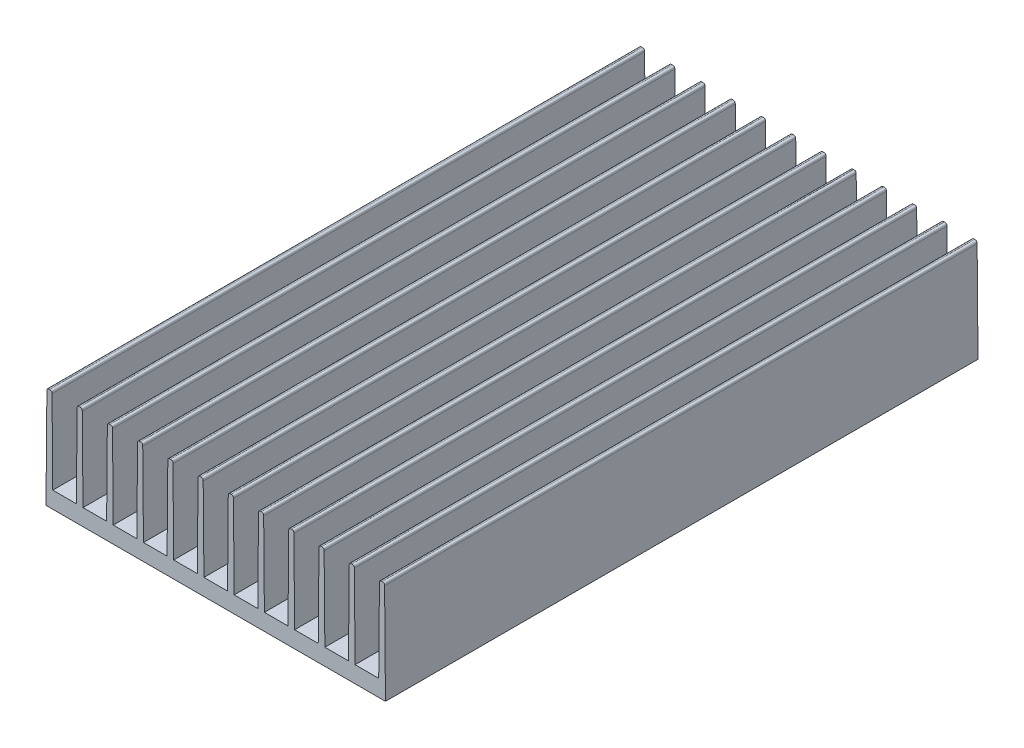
ISO-10303-21;
HEADER;
FILE_DESCRIPTION(('STEP AP214'),'2;1');
FILE_NAME('part.step','',(''),(''),'','','');
FILE_SCHEMA(('AUTOMOTIVE_DESIGN { 1 0 10303 214 1 1 1 1 }'));
ENDSEC;
DATA;
#1=APPLICATION_CONTEXT('core data for automotive mechanical design processes');
#2=APPLICATION_PROTOCOL_DEFINITION('international standard','automotive_design',2000,#1);
#3=PRODUCT_CONTEXT('',#1,'mechanical');
#4=PRODUCT('Part','Part','',(#3));
#5=PRODUCT_RELATED_PRODUCT_CATEGORY('part','',(#4));
#6=PRODUCT_DEFINITION_FORMATION('','',#4);
#7=PRODUCT_DEFINITION_CONTEXT('part definition',#1,'design');
#8=PRODUCT_DEFINITION('design','',#6,#7);
#9=PRODUCT_DEFINITION_SHAPE('','',#8);
#10=(LENGTH_UNIT() NAMED_UNIT(*) SI_UNIT(.MILLI.,.METRE.));
#11=(NAMED_UNIT(*) PLANE_ANGLE_UNIT() SI_UNIT($,.RADIAN.));
#12=(NAMED_UNIT(*) SI_UNIT($,.STERADIAN.) SOLID_ANGLE_UNIT());
#13=UNCERTAINTY_MEASURE_WITH_UNIT(LENGTH_MEASURE(1.E-05),#10,'distance_accuracy_value','');
#14=(GEOMETRIC_REPRESENTATION_CONTEXT(3) GLOBAL_UNCERTAINTY_ASSIGNED_CONTEXT((#13)) GLOBAL_UNIT_ASSIGNED_CONTEXT((#10,
#11,#12)) REPRESENTATION_CONTEXT('',''));
#15=CARTESIAN_POINT('',(0.,0.,0.));
#16=DIRECTION('',(0.,0.,1.));
#17=DIRECTION('',(1.,0.,0.));
#18=AXIS2_PLACEMENT_3D('',#15,#16,#17);
#19=CARTESIAN_POINT('',(-61.5,0.,-75.));
#20=DIRECTION('',(-0.999961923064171,0.00872653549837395,0.));
#21=DIRECTION('',(-0.00872653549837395,-0.999961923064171,0.));
#22=AXIS2_PLACEMENT_3D('',#19,#20,#21);
#23=PLANE('',#22);
#24=DIRECTION('',(-0.00872653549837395,-0.999961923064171,0.));
#25=VECTOR('',#24,1.);
#26=CARTESIAN_POINT('',(-61.5,0.,139.7));
#27=LINE('',#26,#25);
#28=CARTESIAN_POINT('',(-61.1848915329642,36.1078538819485,139.7));
#29=VERTEX_POINT('',#28);
#30=CARTESIAN_POINT('',(-61.5,0.,139.7));
#31=VERTEX_POINT('',#30);
#32=EDGE_CURVE('E682',#29,#31,#27,.T.);
#33=ORIENTED_EDGE('',*,*,#32,.F.);
#34=CARTESIAN_POINT('',(-61.1848915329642,36.1078538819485,-85.735));
#35=CARTESIAN_POINT('',(-61.1848915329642,36.1078538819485,-7.01166666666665));
#36=CARTESIAN_POINT('',(-61.1848915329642,36.1078538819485,71.7116666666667));
#37=CARTESIAN_POINT('',(-61.1848915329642,36.1078538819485,150.435));
#38=(BOUNDED_CURVE() B_SPLINE_CURVE(3,(#34,#35,#36,#37),.UNSPECIFIED.,.F.,
.F.) B_SPLINE_CURVE_WITH_KNOTS((4,4),(-0.010735,0.225435),
.UNSPECIFIED.) CURVE() GEOMETRIC_REPRESENTATION_ITEM() RATIONAL_B_SPLINE_CURVE((1.,1.,1.,1.)) REPRESENTATION_ITEM(''));
#39=CARTESIAN_POINT('',(-61.1848915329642,36.1078538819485,-75.));
#40=VERTEX_POINT('',#39);
#41=EDGE_CURVE('E12',#29,#40,#38,.F.);
#42=ORIENTED_EDGE('',*,*,#41,.T.);
#43=DIRECTION('',(-0.00872653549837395,-0.999961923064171,0.));
#44=VECTOR('',#43,1.);
#45=CARTESIAN_POINT('',(-61.5,0.,-75.));
#46=LINE('',#45,#44);
#47=CARTESIAN_POINT('',(-61.5,0.,-75.));
#48=VERTEX_POINT('',#47);
#49=EDGE_CURVE('E665',#40,#48,#46,.T.);
#50=ORIENTED_EDGE('',*,*,#49,.T.);
#51=DIRECTION('',(0.,0.,1.));
#52=VECTOR('',#51,1.);
#53=CARTESIAN_POINT('',(-61.5,0.,-75.));
#54=LINE('',#53,#52);
#55=EDGE_CURVE('E664',#48,#31,#54,.T.);
#56=ORIENTED_EDGE('',*,*,#55,.T.);
#57=EDGE_LOOP('',(#33,#42,#50,#56));
#58=FACE_BOUND('',#57,.T.);
#59=ADVANCED_FACE('F44',(#58),#23,.T.);
#60=CARTESIAN_POINT('',(-61.5,37.,-75.));
#61=DIRECTION('',(0.,1.,0.));
#62=DIRECTION('',(0.,0.,1.));
#63=AXIS2_PLACEMENT_3D('',#60,#61,#62);
#64=PLANE('',#63);
#65=DIRECTION('',(-1.,0.,0.));
#66=VECTOR('',#65,1.);
#67=CARTESIAN_POINT('',(-61.5,37.,139.7));
#68=LINE('',#67,#66);
#69=CARTESIAN_POINT('',(-60.2150741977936,37.,139.7));
#70=VERTEX_POINT('',#69);
#71=CARTESIAN_POINT('',(-60.2849258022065,37.,139.7));
#72=VERTEX_POINT('',#71);
#73=EDGE_CURVE('E670',#70,#72,#68,.T.);
#74=ORIENTED_EDGE('',*,*,#73,.F.);
#75=CARTESIAN_POINT('',(-60.2150741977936,37.,-85.735));
#76=CARTESIAN_POINT('',(-60.2150741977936,37.,-7.01166666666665));
#77=CARTESIAN_POINT('',(-60.2150741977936,37.,71.7116666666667));
#78=CARTESIAN_POINT('',(-60.2150741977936,37.,150.435));
#79=(BOUNDED_CURVE() B_SPLINE_CURVE(3,(#75,#76,#77,#78),.UNSPECIFIED.,.F.,
.F.) B_SPLINE_CURVE_WITH_KNOTS((4,4),(-0.010735,0.225435),
.UNSPECIFIED.) CURVE() GEOMETRIC_REPRESENTATION_ITEM() RATIONAL_B_SPLINE_CURVE((1.,1.,1.,1.)) REPRESENTATION_ITEM(''));
#80=CARTESIAN_POINT('',(-60.2150741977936,37.,-75.));
#81=VERTEX_POINT('',#80);
#82=EDGE_CURVE('E59',#70,#81,#79,.F.);
#83=ORIENTED_EDGE('',*,*,#82,.T.);
#84=DIRECTION('',(-1.,0.,0.));
#85=VECTOR('',#84,1.);
#86=CARTESIAN_POINT('',(-61.5,37.,-75.));
#87=LINE('',#86,#85);
#88=CARTESIAN_POINT('',(-60.2849258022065,37.,-75.));
#89=VERTEX_POINT('',#88);
#90=EDGE_CURVE('E660',#81,#89,#87,.T.);
#91=ORIENTED_EDGE('',*,*,#90,.T.);
#92=CARTESIAN_POINT('',(-60.2849258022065,37.,150.435));
#93=CARTESIAN_POINT('',(-60.2849258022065,37.,71.7116666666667));
#94=CARTESIAN_POINT('',(-60.2849258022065,37.,-7.01166666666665));
#95=CARTESIAN_POINT('',(-60.2849258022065,37.,-85.735));
#96=(BOUNDED_CURVE() B_SPLINE_CURVE(3,(#92,#93,#94,#95),.UNSPECIFIED.,.F.,
.F.) B_SPLINE_CURVE_WITH_KNOTS((4,4),(-0.010735,0.225435),
.UNSPECIFIED.) CURVE() GEOMETRIC_REPRESENTATION_ITEM() RATIONAL_B_SPLINE_CURVE((1.,1.,1.,1.)) REPRESENTATION_ITEM(''));
#97=EDGE_CURVE('E1143',#89,#72,#96,.F.);
#98=ORIENTED_EDGE('',*,*,#97,.T.);
#99=EDGE_LOOP('',(#74,#83,#91,#98));
#100=FACE_BOUND('',#99,.T.);
#101=ADVANCED_FACE('F1122',(#100),#64,.T.);
#102=CARTESIAN_POINT('',(-59.,0.,-75.));
#103=DIRECTION('',(0.999961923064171,0.00872653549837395,0.));
#104=DIRECTION('',(-0.00872653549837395,0.999961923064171,0.));
#105=AXIS2_PLACEMENT_3D('',#102,#103,#104);
#106=PLANE('',#105);
#107=DIRECTION('',(-0.00872653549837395,0.999961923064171,0.));
#108=VECTOR('',#107,1.);
#109=CARTESIAN_POINT('',(-59.,0.,-75.));
#110=LINE('',#109,#108);
#111=CARTESIAN_POINT('',(-59.0523612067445,6.,-75.));
#112=VERTEX_POINT('',#111);
#113=CARTESIAN_POINT('',(-59.3151084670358,36.1078538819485,-75.));
#114=VERTEX_POINT('',#113);
#115=EDGE_CURVE('E641',#112,#114,#110,.T.);
#116=ORIENTED_EDGE('',*,*,#115,.T.);
#117=CARTESIAN_POINT('',(-59.3151084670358,36.1078538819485,150.435));
#118=CARTESIAN_POINT('',(-59.3151084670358,36.1078538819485,71.7116666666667));
#119=CARTESIAN_POINT('',(-59.3151084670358,36.1078538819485,-7.01166666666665));
#120=CARTESIAN_POINT('',(-59.3151084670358,36.1078538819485,-85.735));
#121=(BOUNDED_CURVE() B_SPLINE_CURVE(3,(#117,#118,#119,#120),.UNSPECIFIED.,.F.,
.F.) B_SPLINE_CURVE_WITH_KNOTS((4,4),(-0.010735,0.225435),
.UNSPECIFIED.) CURVE() GEOMETRIC_REPRESENTATION_ITEM() RATIONAL_B_SPLINE_CURVE((1.,1.,1.,1.)) REPRESENTATION_ITEM(''));
#122=CARTESIAN_POINT('',(-59.3151084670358,36.1078538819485,139.7));
#123=VERTEX_POINT('',#122);
#124=EDGE_CURVE('E2803',#114,#123,#121,.F.);
#125=ORIENTED_EDGE('',*,*,#124,.T.);
#126=DIRECTION('',(-0.00872653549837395,0.999961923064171,0.));
#127=VECTOR('',#126,1.);
#128=CARTESIAN_POINT('',(-59.,0.,139.7));
#129=LINE('',#128,#127);
#130=CARTESIAN_POINT('',(-59.0523612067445,6.,139.7));
#131=VERTEX_POINT('',#130);
#132=EDGE_CURVE('E725',#131,#123,#129,.T.);
#133=ORIENTED_EDGE('',*,*,#132,.F.);
#134=DIRECTION('',(0.,0.,1.));
#135=VECTOR('',#134,1.);
#136=CARTESIAN_POINT('',(-59.0523612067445,6.,-75.));
#137=LINE('',#136,#135);
#138=EDGE_CURVE('E628',#112,#131,#137,.T.);
#139=ORIENTED_EDGE('',*,*,#138,.F.);
#140=EDGE_LOOP('',(#116,#125,#133,#139));
#141=FACE_BOUND('',#140,.T.);
#142=ADVANCED_FACE('F1117',(#141),#106,.T.);
#143=CARTESIAN_POINT('',(-59.,6.,-75.));
#144=DIRECTION('',(0.,1.,0.));
#145=DIRECTION('',(-1.,0.,0.));
#146=AXIS2_PLACEMENT_3D('',#143,#144,#145);
#147=PLANE('',#146);
#148=ORIENTED_EDGE('',*,*,#138,.T.);
#149=DIRECTION('',(-1.,0.,0.));
#150=VECTOR('',#149,1.);
#151=CARTESIAN_POINT('',(-59.,6.,139.7));
#152=LINE('',#151,#150);
#153=CARTESIAN_POINT('',(-50.49309333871,6.,139.7));
#154=VERTEX_POINT('',#153);
#155=EDGE_CURVE('E730',#154,#131,#152,.T.);
#156=ORIENTED_EDGE('',*,*,#155,.F.);
#157=DIRECTION('',(0.,0.,1.));
#158=VECTOR('',#157,1.);
#159=CARTESIAN_POINT('',(-50.49309333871,6.,-75.));
#160=LINE('',#159,#158);
#161=CARTESIAN_POINT('',(-50.49309333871,6.,-75.));
#162=VERTEX_POINT('',#161);
#163=EDGE_CURVE('E624',#162,#154,#160,.T.);
#164=ORIENTED_EDGE('',*,*,#163,.F.);
#165=DIRECTION('',(-1.,0.,0.));
#166=VECTOR('',#165,1.);
#167=CARTESIAN_POINT('',(-59.,6.,-75.));
#168=LINE('',#167,#166);
#169=EDGE_CURVE('E639',#162,#112,#168,.T.);
#170=ORIENTED_EDGE('',*,*,#169,.T.);
#171=EDGE_LOOP('',(#148,#156,#164,#170));
#172=FACE_BOUND('',#171,.T.);
#173=ADVANCED_FACE('F1121',(#172),#147,.T.);
#174=CARTESIAN_POINT('',(-50.5454545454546,0.,-75.));
#175=DIRECTION('',(-0.999961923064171,0.00872653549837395,0.));
#176=DIRECTION('',(-0.00872653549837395,-0.999961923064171,0.));
#177=AXIS2_PLACEMENT_3D('',#174,#175,#176);
#178=PLANE('',#177);
#179=DIRECTION('',(-0.00872653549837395,-0.999961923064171,0.));
#180=VECTOR('',#179,1.);
#181=CARTESIAN_POINT('',(-50.5454545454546,0.,139.7));
#182=LINE('',#181,#180);
#183=CARTESIAN_POINT('',(-50.2303460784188,36.1078538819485,139.7));
#184=VERTEX_POINT('',#183);
#185=EDGE_CURVE('E731',#184,#154,#182,.T.);
#186=ORIENTED_EDGE('',*,*,#185,.F.);
#187=CARTESIAN_POINT('',(-50.2303460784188,36.1078538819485,-85.735));
#188=CARTESIAN_POINT('',(-50.2303460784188,36.1078538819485,-7.01166666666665));
#189=CARTESIAN_POINT('',(-50.2303460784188,36.1078538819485,71.7116666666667));
#190=CARTESIAN_POINT('',(-50.2303460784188,36.1078538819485,150.435));
#191=(BOUNDED_CURVE() B_SPLINE_CURVE(3,(#187,#188,#189,#190),.UNSPECIFIED.,.F.,
.F.) B_SPLINE_CURVE_WITH_KNOTS((4,4),(-0.010735,0.225435),
.UNSPECIFIED.) CURVE() GEOMETRIC_REPRESENTATION_ITEM() RATIONAL_B_SPLINE_CURVE((1.,1.,1.,1.)) REPRESENTATION_ITEM(''));
#192=CARTESIAN_POINT('',(-50.2303460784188,36.1078538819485,-75.));
#193=VERTEX_POINT('',#192);
#194=EDGE_CURVE('E2296',#184,#193,#191,.F.);
#195=ORIENTED_EDGE('',*,*,#194,.T.);
#196=DIRECTION('',(-0.00872653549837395,-0.999961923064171,0.));
#197=VECTOR('',#196,1.);
#198=CARTESIAN_POINT('',(-50.5454545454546,0.,-75.));
#199=LINE('',#198,#197);
#200=EDGE_CURVE('E635',#193,#162,#199,.T.);
#201=ORIENTED_EDGE('',*,*,#200,.T.);
#202=ORIENTED_EDGE('',*,*,#163,.T.);
#203=EDGE_LOOP('',(#186,#195,#201,#202));
#204=FACE_BOUND('',#203,.T.);
#205=ADVANCED_FACE('F1081',(#204),#178,.T.);
#206=CARTESIAN_POINT('',(-50.5454545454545,37.,-75.));
#207=DIRECTION('',(0.,1.,0.));
#208=DIRECTION('',(0.,0.,1.));
#209=AXIS2_PLACEMENT_3D('',#206,#207,#208);
#210=PLANE('',#209);
#211=DIRECTION('',(-1.,0.,0.));
#212=VECTOR('',#211,1.);
#213=CARTESIAN_POINT('',(-50.5454545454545,37.,139.7));
#214=LINE('',#213,#212);
#215=CARTESIAN_POINT('',(-49.2605287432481,37.,139.7));
#216=VERTEX_POINT('',#215);
#217=CARTESIAN_POINT('',(-49.330380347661,37.,139.7));
#218=VERTEX_POINT('',#217);
#219=EDGE_CURVE('E2458',#216,#218,#214,.T.);
#220=ORIENTED_EDGE('',*,*,#219,.F.);
#221=CARTESIAN_POINT('',(-49.2605287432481,37.,-85.735));
#222=CARTESIAN_POINT('',(-49.2605287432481,37.,-7.01166666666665));
#223=CARTESIAN_POINT('',(-49.2605287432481,37.,71.7116666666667));
#224=CARTESIAN_POINT('',(-49.2605287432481,37.,150.435));
#225=(BOUNDED_CURVE() B_SPLINE_CURVE(3,(#221,#222,#223,#224),.UNSPECIFIED.,.F.,
.F.) B_SPLINE_CURVE_WITH_KNOTS((4,4),(-0.010735,0.225435),
.UNSPECIFIED.) CURVE() GEOMETRIC_REPRESENTATION_ITEM() RATIONAL_B_SPLINE_CURVE((1.,1.,1.,1.)) REPRESENTATION_ITEM(''));
#226=CARTESIAN_POINT('',(-49.2605287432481,37.,-75.));
#227=VERTEX_POINT('',#226);
#228=EDGE_CURVE('E2252',#216,#227,#225,.F.);
#229=ORIENTED_EDGE('',*,*,#228,.T.);
#230=DIRECTION('',(-1.,0.,0.));
#231=VECTOR('',#230,1.);
#232=CARTESIAN_POINT('',(-50.5454545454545,37.,-75.));
#233=LINE('',#232,#231);
#234=CARTESIAN_POINT('',(-49.330380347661,37.,-75.));
#235=VERTEX_POINT('',#234);
#236=EDGE_CURVE('E640',#227,#235,#233,.T.);
#237=ORIENTED_EDGE('',*,*,#236,.T.);
#238=CARTESIAN_POINT('',(-49.330380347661,37.,150.435));
#239=CARTESIAN_POINT('',(-49.330380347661,37.,71.7116666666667));
#240=CARTESIAN_POINT('',(-49.330380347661,37.,-7.01166666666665));
#241=CARTESIAN_POINT('',(-49.330380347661,37.,-85.735));
#242=(BOUNDED_CURVE() B_SPLINE_CURVE(3,(#238,#239,#240,#241),.UNSPECIFIED.,.F.,
.F.) B_SPLINE_CURVE_WITH_KNOTS((4,4),(-0.010735,0.225435),
.UNSPECIFIED.) CURVE() GEOMETRIC_REPRESENTATION_ITEM() RATIONAL_B_SPLINE_CURVE((1.,1.,1.,1.)) REPRESENTATION_ITEM(''));
#243=EDGE_CURVE('E2276',#235,#218,#242,.F.);
#244=ORIENTED_EDGE('',*,*,#243,.T.);
#245=EDGE_LOOP('',(#220,#229,#237,#244));
#246=FACE_BOUND('',#245,.T.);
#247=ADVANCED_FACE('F1116',(#246),#210,.T.);
#248=CARTESIAN_POINT('',(-48.0454545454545,0.,-75.));
#249=DIRECTION('',(0.999961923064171,0.00872653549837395,0.));
#250=DIRECTION('',(-0.00872653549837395,0.999961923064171,0.));
#251=AXIS2_PLACEMENT_3D('',#248,#249,#250);
#252=PLANE('',#251);
#253=DIRECTION('',(-0.00872653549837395,0.999961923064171,0.));
#254=VECTOR('',#253,1.);
#255=CARTESIAN_POINT('',(-48.0454545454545,0.,-75.));
#256=LINE('',#255,#254);
#257=CARTESIAN_POINT('',(-48.0978157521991,6.,-75.));
#258=VERTEX_POINT('',#257);
#259=CARTESIAN_POINT('',(-48.3605630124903,36.1078538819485,-75.));
#260=VERTEX_POINT('',#259);
#261=EDGE_CURVE('E648',#258,#260,#256,.T.);
#262=ORIENTED_EDGE('',*,*,#261,.T.);
#263=CARTESIAN_POINT('',(-48.3605630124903,36.1078538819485,150.435));
#264=CARTESIAN_POINT('',(-48.3605630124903,36.1078538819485,71.7116666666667));
#265=CARTESIAN_POINT('',(-48.3605630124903,36.1078538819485,-7.01166666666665));
#266=CARTESIAN_POINT('',(-48.3605630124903,36.1078538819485,-85.735));
#267=(BOUNDED_CURVE() B_SPLINE_CURVE(3,(#263,#264,#265,#266),.UNSPECIFIED.,.F.,
.F.) B_SPLINE_CURVE_WITH_KNOTS((4,4),(-0.010735,0.225435),
.UNSPECIFIED.) CURVE() GEOMETRIC_REPRESENTATION_ITEM() RATIONAL_B_SPLINE_CURVE((1.,1.,1.,1.)) REPRESENTATION_ITEM(''));
#268=CARTESIAN_POINT('',(-48.3605630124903,36.1078538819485,139.7));
#269=VERTEX_POINT('',#268);
#270=EDGE_CURVE('E1100',#260,#269,#267,.F.);
#271=ORIENTED_EDGE('',*,*,#270,.T.);
#272=DIRECTION('',(-0.00872653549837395,0.999961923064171,0.));
#273=VECTOR('',#272,1.);
#274=CARTESIAN_POINT('',(-48.0454545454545,0.,139.7));
#275=LINE('',#274,#273);
#276=CARTESIAN_POINT('',(-48.0978157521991,6.,139.7));
#277=VERTEX_POINT('',#276);
#278=EDGE_CURVE('E2455',#277,#269,#275,.T.);
#279=ORIENTED_EDGE('',*,*,#278,.F.);
#280=DIRECTION('',(0.,0.,1.));
#281=VECTOR('',#280,1.);
#282=CARTESIAN_POINT('',(-48.0978157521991,6.,-75.));
#283=LINE('',#282,#281);
#284=EDGE_CURVE('E629',#258,#277,#283,.T.);
#285=ORIENTED_EDGE('',*,*,#284,.F.);
#286=EDGE_LOOP('',(#262,#271,#279,#285));
#287=FACE_BOUND('',#286,.T.);
#288=ADVANCED_FACE('F1107',(#287),#252,.T.);
#289=CARTESIAN_POINT('',(-48.0454545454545,6.,-75.));
#290=DIRECTION('',(0.,1.,0.));
#291=DIRECTION('',(-1.,0.,0.));
#292=AXIS2_PLACEMENT_3D('',#289,#290,#291);
#293=PLANE('',#292);
#294=ORIENTED_EDGE('',*,*,#284,.T.);
#295=DIRECTION('',(-1.,0.,0.));
#296=VECTOR('',#295,1.);
#297=CARTESIAN_POINT('',(-48.0454545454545,6.,139.7));
#298=LINE('',#297,#296);
#299=CARTESIAN_POINT('',(-39.5385478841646,6.,139.7));
#300=VERTEX_POINT('',#299);
#301=EDGE_CURVE('E2459',#300,#277,#298,.T.);
#302=ORIENTED_EDGE('',*,*,#301,.F.);
#303=DIRECTION('',(0.,0.,1.));
#304=VECTOR('',#303,1.);
#305=CARTESIAN_POINT('',(-39.5385478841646,6.,-75.));
#306=LINE('',#305,#304);
#307=CARTESIAN_POINT('',(-39.5385478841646,6.,-75.));
#308=VERTEX_POINT('',#307);
#309=EDGE_CURVE('E2442',#308,#300,#306,.T.);
#310=ORIENTED_EDGE('',*,*,#309,.F.);
#311=DIRECTION('',(-1.,0.,0.));
#312=VECTOR('',#311,1.);
#313=CARTESIAN_POINT('',(-48.0454545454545,6.,-75.));
#314=LINE('',#313,#312);
#315=EDGE_CURVE('E654',#308,#258,#314,.T.);
#316=ORIENTED_EDGE('',*,*,#315,.T.);
#317=EDGE_LOOP('',(#294,#302,#310,#316));
#318=FACE_BOUND('',#317,.T.);
#319=ADVANCED_FACE('F1079',(#318),#293,.T.);
#320=CARTESIAN_POINT('',(-39.5909090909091,0.,-75.));
#321=DIRECTION('',(-0.999961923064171,0.00872653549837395,0.));
#322=DIRECTION('',(-0.00872653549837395,-0.999961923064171,0.));
#323=AXIS2_PLACEMENT_3D('',#320,#321,#322);
#324=PLANE('',#323);
#325=DIRECTION('',(-0.00872653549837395,-0.999961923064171,0.));
#326=VECTOR('',#325,1.);
#327=CARTESIAN_POINT('',(-39.5909090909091,0.,139.7));
#328=LINE('',#327,#326);
#329=CARTESIAN_POINT('',(-39.2758006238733,36.1078538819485,139.7));
#330=VERTEX_POINT('',#329);
#331=EDGE_CURVE('E2460',#330,#300,#328,.T.);
#332=ORIENTED_EDGE('',*,*,#331,.F.);
#333=CARTESIAN_POINT('',(-39.2758006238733,36.1078538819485,-85.735));
#334=CARTESIAN_POINT('',(-39.2758006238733,36.1078538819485,-7.01166666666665));
#335=CARTESIAN_POINT('',(-39.2758006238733,36.1078538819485,71.7116666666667));
#336=CARTESIAN_POINT('',(-39.2758006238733,36.1078538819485,150.435));
#337=(BOUNDED_CURVE() B_SPLINE_CURVE(3,(#333,#334,#335,#336),.UNSPECIFIED.,.F.,
.F.) B_SPLINE_CURVE_WITH_KNOTS((4,4),(-0.010735,0.225435),
.UNSPECIFIED.) CURVE() GEOMETRIC_REPRESENTATION_ITEM() RATIONAL_B_SPLINE_CURVE((1.,1.,1.,1.)) REPRESENTATION_ITEM(''));
#338=CARTESIAN_POINT('',(-39.2758006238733,36.1078538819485,-75.));
#339=VERTEX_POINT('',#338);
#340=EDGE_CURVE('E2194',#330,#339,#337,.F.);
#341=ORIENTED_EDGE('',*,*,#340,.T.);
#342=DIRECTION('',(-0.00872653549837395,-0.999961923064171,0.));
#343=VECTOR('',#342,1.);
#344=CARTESIAN_POINT('',(-39.5909090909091,0.,-75.));
#345=LINE('',#344,#343);
#346=EDGE_CURVE('E2688',#339,#308,#345,.T.);
#347=ORIENTED_EDGE('',*,*,#346,.T.);
#348=ORIENTED_EDGE('',*,*,#309,.T.);
#349=EDGE_LOOP('',(#332,#341,#347,#348));
#350=FACE_BOUND('',#349,.T.);
#351=ADVANCED_FACE('F1074',(#350),#324,.T.);
#352=CARTESIAN_POINT('',(-39.5909090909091,37.,-75.));
#353=DIRECTION('',(0.,1.,0.));
#354=DIRECTION('',(0.,0.,1.));
#355=AXIS2_PLACEMENT_3D('',#352,#353,#354);
#356=PLANE('',#355);
#357=DIRECTION('',(-1.,0.,0.));
#358=VECTOR('',#357,1.);
#359=CARTESIAN_POINT('',(-39.5909090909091,37.,139.7));
#360=LINE('',#359,#358);
#361=CARTESIAN_POINT('',(-38.3059832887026,37.,139.7));
#362=VERTEX_POINT('',#361);
#363=CARTESIAN_POINT('',(-38.3758348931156,37.,139.7));
#364=VERTEX_POINT('',#363);
#365=EDGE_CURVE('E2473',#362,#364,#360,.T.);
#366=ORIENTED_EDGE('',*,*,#365,.F.);
#367=CARTESIAN_POINT('',(-38.3059832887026,37.,-85.735));
#368=CARTESIAN_POINT('',(-38.3059832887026,37.,-7.01166666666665));
#369=CARTESIAN_POINT('',(-38.3059832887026,37.,71.7116666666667));
#370=CARTESIAN_POINT('',(-38.3059832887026,37.,150.435));
#371=(BOUNDED_CURVE() B_SPLINE_CURVE(3,(#367,#368,#369,#370),.UNSPECIFIED.,.F.,
.F.) B_SPLINE_CURVE_WITH_KNOTS((4,4),(-0.010735,0.225435),
.UNSPECIFIED.) CURVE() GEOMETRIC_REPRESENTATION_ITEM() RATIONAL_B_SPLINE_CURVE((1.,1.,1.,1.)) REPRESENTATION_ITEM(''));
#372=CARTESIAN_POINT('',(-38.3059832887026,37.,-75.));
#373=VERTEX_POINT('',#372);
#374=EDGE_CURVE('E2149',#362,#373,#371,.F.);
#375=ORIENTED_EDGE('',*,*,#374,.T.);
#376=DIRECTION('',(-1.,0.,0.));
#377=VECTOR('',#376,1.);
#378=CARTESIAN_POINT('',(-39.5909090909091,37.,-75.));
#379=LINE('',#378,#377);
#380=CARTESIAN_POINT('',(-38.3758348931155,37.,-75.));
#381=VERTEX_POINT('',#380);
#382=EDGE_CURVE('E2684',#373,#381,#379,.T.);
#383=ORIENTED_EDGE('',*,*,#382,.T.);
#384=CARTESIAN_POINT('',(-38.3758348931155,37.,150.435));
#385=CARTESIAN_POINT('',(-38.3758348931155,37.,71.7116666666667));
#386=CARTESIAN_POINT('',(-38.3758348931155,37.,-7.01166666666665));
#387=CARTESIAN_POINT('',(-38.3758348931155,37.,-85.735));
#388=(BOUNDED_CURVE() B_SPLINE_CURVE(3,(#384,#385,#386,#387),.UNSPECIFIED.,.F.,
.F.) B_SPLINE_CURVE_WITH_KNOTS((4,4),(-0.010735,0.225435),
.UNSPECIFIED.) CURVE() GEOMETRIC_REPRESENTATION_ITEM() RATIONAL_B_SPLINE_CURVE((1.,1.,1.,1.)) REPRESENTATION_ITEM(''));
#389=EDGE_CURVE('E2174',#381,#364,#388,.F.);
#390=ORIENTED_EDGE('',*,*,#389,.T.);
#391=EDGE_LOOP('',(#366,#375,#383,#390));
#392=FACE_BOUND('',#391,.T.);
#393=ADVANCED_FACE('F1078',(#392),#356,.T.);
#394=CARTESIAN_POINT('',(-37.0909090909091,0.,-75.));
#395=DIRECTION('',(0.999961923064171,0.00872653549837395,0.));
#396=DIRECTION('',(-0.00872653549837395,0.999961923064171,0.));
#397=AXIS2_PLACEMENT_3D('',#394,#395,#396);
#398=PLANE('',#397);
#399=DIRECTION('',(-0.00872653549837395,0.999961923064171,0.));
#400=VECTOR('',#399,1.);
#401=CARTESIAN_POINT('',(-37.0909090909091,0.,-75.));
#402=LINE('',#401,#400);
#403=CARTESIAN_POINT('',(-37.1432702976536,6.,-75.));
#404=VERTEX_POINT('',#403);
#405=CARTESIAN_POINT('',(-37.4060175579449,36.1078538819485,-75.));
#406=VERTEX_POINT('',#405);
#407=EDGE_CURVE('E2680',#404,#406,#402,.T.);
#408=ORIENTED_EDGE('',*,*,#407,.T.);
#409=CARTESIAN_POINT('',(-37.4060175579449,36.1078538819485,150.435));
#410=CARTESIAN_POINT('',(-37.4060175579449,36.1078538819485,71.7116666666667));
#411=CARTESIAN_POINT('',(-37.4060175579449,36.1078538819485,-7.01166666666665));
#412=CARTESIAN_POINT('',(-37.4060175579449,36.1078538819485,-85.735));
#413=(BOUNDED_CURVE() B_SPLINE_CURVE(3,(#409,#410,#411,#412),.UNSPECIFIED.,.F.,
.F.) B_SPLINE_CURVE_WITH_KNOTS((4,4),(-0.010735,0.225435),
.UNSPECIFIED.) CURVE() GEOMETRIC_REPRESENTATION_ITEM() RATIONAL_B_SPLINE_CURVE((1.,1.,1.,1.)) REPRESENTATION_ITEM(''));
#414=CARTESIAN_POINT('',(-37.4060175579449,36.1078538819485,139.7));
#415=VERTEX_POINT('',#414);
#416=EDGE_CURVE('E2819',#406,#415,#413,.F.);
#417=ORIENTED_EDGE('',*,*,#416,.T.);
#418=DIRECTION('',(-0.00872653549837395,0.999961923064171,0.));
#419=VECTOR('',#418,1.);
#420=CARTESIAN_POINT('',(-37.0909090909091,0.,139.7));
#421=LINE('',#420,#419);
#422=CARTESIAN_POINT('',(-37.1432702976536,6.,139.7));
#423=VERTEX_POINT('',#422);
#424=EDGE_CURVE('E2477',#423,#415,#421,.T.);
#425=ORIENTED_EDGE('',*,*,#424,.F.);
#426=DIRECTION('',(0.,0.,1.));
#427=VECTOR('',#426,1.);
#428=CARTESIAN_POINT('',(-37.1432702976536,6.,-75.));
#429=LINE('',#428,#427);
#430=EDGE_CURVE('E2439',#404,#423,#429,.T.);
#431=ORIENTED_EDGE('',*,*,#430,.F.);
#432=EDGE_LOOP('',(#408,#417,#425,#431));
#433=FACE_BOUND('',#432,.T.);
#434=ADVANCED_FACE('F1005',(#433),#398,.T.);
#435=CARTESIAN_POINT('',(-37.0909090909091,6.,-75.));
#436=DIRECTION('',(0.,1.,0.));
#437=DIRECTION('',(-1.,0.,0.));
#438=AXIS2_PLACEMENT_3D('',#435,#436,#437);
#439=PLANE('',#438);
#440=ORIENTED_EDGE('',*,*,#430,.T.);
#441=DIRECTION('',(-1.,0.,0.));
#442=VECTOR('',#441,1.);
#443=CARTESIAN_POINT('',(-37.0909090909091,6.,139.7));
#444=LINE('',#443,#442);
#445=CARTESIAN_POINT('',(-28.5840024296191,6.,139.7));
#446=VERTEX_POINT('',#445);
#447=EDGE_CURVE('E2471',#446,#423,#444,.T.);
#448=ORIENTED_EDGE('',*,*,#447,.F.);
#449=DIRECTION('',(0.,0.,1.));
#450=VECTOR('',#449,1.);
#451=CARTESIAN_POINT('',(-28.5840024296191,6.,-75.));
#452=LINE('',#451,#450);
#453=CARTESIAN_POINT('',(-28.5840024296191,6.,-75.));
#454=VERTEX_POINT('',#453);
#455=EDGE_CURVE('E2435',#454,#446,#452,.T.);
#456=ORIENTED_EDGE('',*,*,#455,.F.);
#457=DIRECTION('',(-1.,0.,0.));
#458=VECTOR('',#457,1.);
#459=CARTESIAN_POINT('',(-37.0909090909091,6.,-75.));
#460=LINE('',#459,#458);
#461=EDGE_CURVE('E2677',#454,#404,#460,.T.);
#462=ORIENTED_EDGE('',*,*,#461,.T.);
#463=EDGE_LOOP('',(#440,#448,#456,#462));
#464=FACE_BOUND('',#463,.T.);
#465=ADVANCED_FACE('F1043',(#464),#439,.T.);
#466=CARTESIAN_POINT('',(-28.6363636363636,0.,-75.));
#467=DIRECTION('',(-0.999961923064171,0.00872653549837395,0.));
#468=DIRECTION('',(-0.00872653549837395,-0.999961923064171,0.));
#469=AXIS2_PLACEMENT_3D('',#466,#467,#468);
#470=PLANE('',#469);
#471=DIRECTION('',(-0.00872653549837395,-0.999961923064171,0.));
#472=VECTOR('',#471,1.);
#473=CARTESIAN_POINT('',(-28.6363636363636,0.,139.7));
#474=LINE('',#473,#472);
#475=CARTESIAN_POINT('',(-28.3212551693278,36.1078538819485,139.7));
#476=VERTEX_POINT('',#475);
#477=EDGE_CURVE('E2482',#476,#446,#474,.T.);
#478=ORIENTED_EDGE('',*,*,#477,.F.);
#479=CARTESIAN_POINT('',(-28.3212551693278,36.1078538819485,-85.735));
#480=CARTESIAN_POINT('',(-28.3212551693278,36.1078538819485,-7.01166666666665));
#481=CARTESIAN_POINT('',(-28.3212551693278,36.1078538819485,71.7116666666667));
#482=CARTESIAN_POINT('',(-28.3212551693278,36.1078538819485,150.435));
#483=(BOUNDED_CURVE() B_SPLINE_CURVE(3,(#479,#480,#481,#482),.UNSPECIFIED.,.F.,
.F.) B_SPLINE_CURVE_WITH_KNOTS((4,4),(-0.010735,0.225435),
.UNSPECIFIED.) CURVE() GEOMETRIC_REPRESENTATION_ITEM() RATIONAL_B_SPLINE_CURVE((1.,1.,1.,1.)) REPRESENTATION_ITEM(''));
#484=CARTESIAN_POINT('',(-28.3212551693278,36.1078538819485,-75.));
#485=VERTEX_POINT('',#484);
#486=EDGE_CURVE('E1059',#476,#485,#483,.F.);
#487=ORIENTED_EDGE('',*,*,#486,.T.);
#488=DIRECTION('',(-0.00872653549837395,-0.999961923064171,0.));
#489=VECTOR('',#488,1.);
#490=CARTESIAN_POINT('',(-28.6363636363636,0.,-75.));
#491=LINE('',#490,#489);
#492=EDGE_CURVE('E2681',#485,#454,#491,.T.);
#493=ORIENTED_EDGE('',*,*,#492,.T.);
#494=ORIENTED_EDGE('',*,*,#455,.T.);
#495=EDGE_LOOP('',(#478,#487,#493,#494));
#496=FACE_BOUND('',#495,.T.);
#497=ADVANCED_FACE('F1042',(#496),#470,.T.);
#498=CARTESIAN_POINT('',(-28.6363636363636,37.,-75.));
#499=DIRECTION('',(0.,1.,0.));
#500=DIRECTION('',(0.,0.,1.));
#501=AXIS2_PLACEMENT_3D('',#498,#499,#500);
#502=PLANE('',#501);
#503=DIRECTION('',(-1.,0.,0.));
#504=VECTOR('',#503,1.);
#505=CARTESIAN_POINT('',(-28.6363636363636,37.,139.7));
#506=LINE('',#505,#504);
#507=CARTESIAN_POINT('',(-27.3514378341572,37.,139.7));
#508=VERTEX_POINT('',#507);
#509=CARTESIAN_POINT('',(-27.4212894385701,37.,139.7));
#510=VERTEX_POINT('',#509);
#511=EDGE_CURVE('E2522',#508,#510,#506,.T.);
#512=ORIENTED_EDGE('',*,*,#511,.F.);
#513=CARTESIAN_POINT('',(-27.3514378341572,37.,-85.735));
#514=CARTESIAN_POINT('',(-27.3514378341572,37.,-7.01166666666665));
#515=CARTESIAN_POINT('',(-27.3514378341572,37.,71.7116666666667));
#516=CARTESIAN_POINT('',(-27.3514378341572,37.,150.435));
#517=(BOUNDED_CURVE() B_SPLINE_CURVE(3,(#513,#514,#515,#516),.UNSPECIFIED.,.F.,
.F.) B_SPLINE_CURVE_WITH_KNOTS((4,4),(-0.010735,0.225435),
.UNSPECIFIED.) CURVE() GEOMETRIC_REPRESENTATION_ITEM() RATIONAL_B_SPLINE_CURVE((1.,1.,1.,1.)) REPRESENTATION_ITEM(''));
#518=CARTESIAN_POINT('',(-27.3514378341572,37.,-75.));
#519=VERTEX_POINT('',#518);
#520=EDGE_CURVE('E2049',#508,#519,#517,.F.);
#521=ORIENTED_EDGE('',*,*,#520,.T.);
#522=DIRECTION('',(-1.,0.,0.));
#523=VECTOR('',#522,1.);
#524=CARTESIAN_POINT('',(-28.6363636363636,37.,-75.));
#525=LINE('',#524,#523);
#526=CARTESIAN_POINT('',(-27.4212894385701,37.,-75.));
#527=VERTEX_POINT('',#526);
#528=EDGE_CURVE('E2495',#519,#527,#525,.T.);
#529=ORIENTED_EDGE('',*,*,#528,.T.);
#530=CARTESIAN_POINT('',(-27.4212894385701,37.,150.435));
#531=CARTESIAN_POINT('',(-27.4212894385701,37.,71.7116666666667));
#532=CARTESIAN_POINT('',(-27.4212894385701,37.,-7.01166666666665));
#533=CARTESIAN_POINT('',(-27.4212894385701,37.,-85.735));
#534=(BOUNDED_CURVE() B_SPLINE_CURVE(3,(#530,#531,#532,#533),.UNSPECIFIED.,.F.,
.F.) B_SPLINE_CURVE_WITH_KNOTS((4,4),(-0.010735,0.225435),
.UNSPECIFIED.) CURVE() GEOMETRIC_REPRESENTATION_ITEM() RATIONAL_B_SPLINE_CURVE((1.,1.,1.,1.)) REPRESENTATION_ITEM(''));
#535=EDGE_CURVE('E1026',#527,#510,#534,.F.);
#536=ORIENTED_EDGE('',*,*,#535,.T.);
#537=EDGE_LOOP('',(#512,#521,#529,#536));
#538=FACE_BOUND('',#537,.T.);
#539=ADVANCED_FACE('F1003',(#538),#502,.T.);
#540=CARTESIAN_POINT('',(-26.1363636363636,0.,-75.));
#541=DIRECTION('',(0.999961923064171,0.00872653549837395,0.));
#542=DIRECTION('',(-0.00872653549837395,0.999961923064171,0.));
#543=AXIS2_PLACEMENT_3D('',#540,#541,#542);
#544=PLANE('',#543);
#545=DIRECTION('',(-0.00872653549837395,0.999961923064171,0.));
#546=VECTOR('',#545,1.);
#547=CARTESIAN_POINT('',(-26.1363636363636,0.,-75.));
#548=LINE('',#547,#546);
#549=CARTESIAN_POINT('',(-26.1887248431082,6.,-75.));
#550=VERTEX_POINT('',#549);
#551=CARTESIAN_POINT('',(-26.4514721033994,36.1078538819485,-75.));
#552=VERTEX_POINT('',#551);
#553=EDGE_CURVE('E2490',#550,#552,#548,.T.);
#554=ORIENTED_EDGE('',*,*,#553,.T.);
#555=CARTESIAN_POINT('',(-26.4514721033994,36.1078538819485,150.435));
#556=CARTESIAN_POINT('',(-26.4514721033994,36.1078538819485,71.7116666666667));
#557=CARTESIAN_POINT('',(-26.4514721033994,36.1078538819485,-7.01166666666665));
#558=CARTESIAN_POINT('',(-26.4514721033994,36.1078538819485,-85.735));
#559=(BOUNDED_CURVE() B_SPLINE_CURVE(3,(#555,#556,#557,#558),.UNSPECIFIED.,.F.,
.F.) B_SPLINE_CURVE_WITH_KNOTS((4,4),(-0.010735,0.225435),
.UNSPECIFIED.) CURVE() GEOMETRIC_REPRESENTATION_ITEM() RATIONAL_B_SPLINE_CURVE((1.,1.,1.,1.)) REPRESENTATION_ITEM(''));
#560=CARTESIAN_POINT('',(-26.4514721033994,36.1078538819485,139.7));
#561=VERTEX_POINT('',#560);
#562=EDGE_CURVE('E2705',#552,#561,#559,.F.);
#563=ORIENTED_EDGE('',*,*,#562,.T.);
#564=DIRECTION('',(-0.00872653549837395,0.999961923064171,0.));
#565=VECTOR('',#564,1.);
#566=CARTESIAN_POINT('',(-26.1363636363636,0.,139.7));
#567=LINE('',#566,#565);
#568=CARTESIAN_POINT('',(-26.1887248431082,6.,139.7));
#569=VERTEX_POINT('',#568);
#570=EDGE_CURVE('E2519',#569,#561,#567,.T.);
#571=ORIENTED_EDGE('',*,*,#570,.F.);
#572=DIRECTION('',(0.,0.,1.));
#573=VECTOR('',#572,1.);
#574=CARTESIAN_POINT('',(-26.1887248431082,6.,-75.));
#575=LINE('',#574,#573);
#576=EDGE_CURVE('E2432',#550,#569,#575,.T.);
#577=ORIENTED_EDGE('',*,*,#576,.F.);
#578=EDGE_LOOP('',(#554,#563,#571,#577));
#579=FACE_BOUND('',#578,.T.);
#580=ADVANCED_FACE('F998',(#579),#544,.T.);
#581=CARTESIAN_POINT('',(-26.1363636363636,6.,-75.));
#582=DIRECTION('',(0.,1.,0.));
#583=DIRECTION('',(-1.,0.,0.));
#584=AXIS2_PLACEMENT_3D('',#581,#582,#583);
#585=PLANE('',#584);
#586=ORIENTED_EDGE('',*,*,#576,.T.);
#587=DIRECTION('',(-1.,0.,0.));
#588=VECTOR('',#587,1.);
#589=CARTESIAN_POINT('',(-26.1363636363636,6.,139.7));
#590=LINE('',#589,#588);
#591=CARTESIAN_POINT('',(-17.6294569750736,6.,139.7));
#592=VERTEX_POINT('',#591);
#593=EDGE_CURVE('E2515',#592,#569,#590,.T.);
#594=ORIENTED_EDGE('',*,*,#593,.F.);
#595=DIRECTION('',(0.,0.,1.));
#596=VECTOR('',#595,1.);
#597=CARTESIAN_POINT('',(-17.6294569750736,6.,-75.));
#598=LINE('',#597,#596);
#599=CARTESIAN_POINT('',(-17.6294569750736,6.,-75.));
#600=VERTEX_POINT('',#599);
#601=EDGE_CURVE('E2428',#600,#592,#598,.T.);
#602=ORIENTED_EDGE('',*,*,#601,.F.);
#603=DIRECTION('',(-1.,0.,0.));
#604=VECTOR('',#603,1.);
#605=CARTESIAN_POINT('',(-26.1363636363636,6.,-75.));
#606=LINE('',#605,#604);
#607=EDGE_CURVE('E2496',#600,#550,#606,.T.);
#608=ORIENTED_EDGE('',*,*,#607,.T.);
#609=EDGE_LOOP('',(#586,#594,#602,#608));
#610=FACE_BOUND('',#609,.T.);
#611=ADVANCED_FACE('F1002',(#610),#585,.T.);
#612=CARTESIAN_POINT('',(-17.6818181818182,0.,-75.));
#613=DIRECTION('',(-0.999961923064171,0.00872653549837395,0.));
#614=DIRECTION('',(-0.00872653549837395,-0.999961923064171,0.));
#615=AXIS2_PLACEMENT_3D('',#612,#613,#614);
#616=PLANE('',#615);
#617=DIRECTION('',(-0.00872653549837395,-0.999961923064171,0.));
#618=VECTOR('',#617,1.);
#619=CARTESIAN_POINT('',(-17.6818181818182,0.,139.7));
#620=LINE('',#619,#618);
#621=CARTESIAN_POINT('',(-17.3667097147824,36.1078538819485,139.7));
#622=VERTEX_POINT('',#621);
#623=EDGE_CURVE('E2511',#622,#592,#620,.T.);
#624=ORIENTED_EDGE('',*,*,#623,.F.);
#625=CARTESIAN_POINT('',(-17.3667097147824,36.1078538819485,-85.735));
#626=CARTESIAN_POINT('',(-17.3667097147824,36.1078538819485,-7.01166666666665));
#627=CARTESIAN_POINT('',(-17.3667097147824,36.1078538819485,71.7116666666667));
#628=CARTESIAN_POINT('',(-17.3667097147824,36.1078538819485,150.435));
#629=(BOUNDED_CURVE() B_SPLINE_CURVE(3,(#625,#626,#627,#628),.UNSPECIFIED.,.F.,
.F.) B_SPLINE_CURVE_WITH_KNOTS((4,4),(-0.010735,0.225435),
.UNSPECIFIED.) CURVE() GEOMETRIC_REPRESENTATION_ITEM() RATIONAL_B_SPLINE_CURVE((1.,1.,1.,1.)) REPRESENTATION_ITEM(''));
#630=CARTESIAN_POINT('',(-17.3667097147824,36.1078538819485,-75.));
#631=VERTEX_POINT('',#630);
#632=EDGE_CURVE('E1989',#622,#631,#629,.F.);
#633=ORIENTED_EDGE('',*,*,#632,.T.);
#634=DIRECTION('',(-0.00872653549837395,-0.999961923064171,0.));
#635=VECTOR('',#634,1.);
#636=CARTESIAN_POINT('',(-17.6818181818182,0.,-75.));
#637=LINE('',#636,#635);
#638=EDGE_CURVE('E2499',#631,#600,#637,.T.);
#639=ORIENTED_EDGE('',*,*,#638,.T.);
#640=ORIENTED_EDGE('',*,*,#601,.T.);
#641=EDGE_LOOP('',(#624,#633,#639,#640));
#642=FACE_BOUND('',#641,.T.);
#643=ADVANCED_FACE('F961',(#642),#616,.T.);
#644=CARTESIAN_POINT('',(-17.6818181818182,37.,-75.));
#645=DIRECTION('',(0.,1.,0.));
#646=DIRECTION('',(0.,0.,1.));
#647=AXIS2_PLACEMENT_3D('',#644,#645,#646);
#648=PLANE('',#647);
#649=DIRECTION('',(-1.,0.,0.));
#650=VECTOR('',#649,1.);
#651=CARTESIAN_POINT('',(-17.6818181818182,37.,139.7));
#652=LINE('',#651,#650);
#653=CARTESIAN_POINT('',(-16.3968923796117,37.,139.7));
#654=VERTEX_POINT('',#653);
#655=CARTESIAN_POINT('',(-16.4667439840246,37.,139.7));
#656=VERTEX_POINT('',#655);
#657=EDGE_CURVE('E2516',#654,#656,#652,.T.);
#658=ORIENTED_EDGE('',*,*,#657,.F.);
#659=CARTESIAN_POINT('',(-16.3968923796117,37.,-85.735));
#660=CARTESIAN_POINT('',(-16.3968923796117,37.,-7.01166666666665));
#661=CARTESIAN_POINT('',(-16.3968923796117,37.,71.7116666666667));
#662=CARTESIAN_POINT('',(-16.3968923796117,37.,150.435));
#663=(BOUNDED_CURVE() B_SPLINE_CURVE(3,(#659,#660,#661,#662),.UNSPECIFIED.,.F.,
.F.) B_SPLINE_CURVE_WITH_KNOTS((4,4),(-0.010735,0.225435),
.UNSPECIFIED.) CURVE() GEOMETRIC_REPRESENTATION_ITEM() RATIONAL_B_SPLINE_CURVE((1.,1.,1.,1.)) REPRESENTATION_ITEM(''));
#664=CARTESIAN_POINT('',(-16.3968923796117,37.,-75.));
#665=VERTEX_POINT('',#664);
#666=EDGE_CURVE('E1945',#654,#665,#663,.F.);
#667=ORIENTED_EDGE('',*,*,#666,.T.);
#668=DIRECTION('',(-1.,0.,0.));
#669=VECTOR('',#668,1.);
#670=CARTESIAN_POINT('',(-17.6818181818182,37.,-75.));
#671=LINE('',#670,#669);
#672=CARTESIAN_POINT('',(-16.4667439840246,37.,-75.));
#673=VERTEX_POINT('',#672);
#674=EDGE_CURVE('E2503',#665,#673,#671,.T.);
#675=ORIENTED_EDGE('',*,*,#674,.T.);
#676=CARTESIAN_POINT('',(-16.4667439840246,37.,150.435));
#677=CARTESIAN_POINT('',(-16.4667439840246,37.,71.7116666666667));
#678=CARTESIAN_POINT('',(-16.4667439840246,37.,-7.01166666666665));
#679=CARTESIAN_POINT('',(-16.4667439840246,37.,-85.735));
#680=(BOUNDED_CURVE() B_SPLINE_CURVE(3,(#676,#677,#678,#679),.UNSPECIFIED.,.F.,
.F.) B_SPLINE_CURVE_WITH_KNOTS((4,4),(-0.010735,0.225435),
.UNSPECIFIED.) CURVE() GEOMETRIC_REPRESENTATION_ITEM() RATIONAL_B_SPLINE_CURVE((1.,1.,1.,1.)) REPRESENTATION_ITEM(''));
#681=EDGE_CURVE('E1969',#673,#656,#680,.F.);
#682=ORIENTED_EDGE('',*,*,#681,.T.);
#683=EDGE_LOOP('',(#658,#667,#675,#682));
#684=FACE_BOUND('',#683,.T.);
#685=ADVANCED_FACE('F997',(#684),#648,.T.);
#686=CARTESIAN_POINT('',(-15.1818181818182,0.,-75.));
#687=DIRECTION('',(0.999961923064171,0.00872653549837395,0.));
#688=DIRECTION('',(-0.00872653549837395,0.999961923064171,0.));
#689=AXIS2_PLACEMENT_3D('',#686,#687,#688);
#690=PLANE('',#689);
#691=DIRECTION('',(-0.00872653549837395,0.999961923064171,0.));
#692=VECTOR('',#691,1.);
#693=CARTESIAN_POINT('',(-15.1818181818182,0.,-75.));
#694=LINE('',#693,#692);
#695=CARTESIAN_POINT('',(-15.2341793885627,6.,-75.));
#696=VERTEX_POINT('',#695);
#697=CARTESIAN_POINT('',(-15.496926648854,36.1078538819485,-75.));
#698=VERTEX_POINT('',#697);
#699=EDGE_CURVE('E2527',#696,#698,#694,.T.);
#700=ORIENTED_EDGE('',*,*,#699,.T.);
#701=CARTESIAN_POINT('',(-15.496926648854,36.1078538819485,150.435));
#702=CARTESIAN_POINT('',(-15.496926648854,36.1078538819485,71.7116666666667));
#703=CARTESIAN_POINT('',(-15.496926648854,36.1078538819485,-7.01166666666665));
#704=CARTESIAN_POINT('',(-15.496926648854,36.1078538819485,-85.735));
#705=(BOUNDED_CURVE() B_SPLINE_CURVE(3,(#701,#702,#703,#704),.UNSPECIFIED.,.F.,
.F.) B_SPLINE_CURVE_WITH_KNOTS((4,4),(-0.010735,0.225435),
.UNSPECIFIED.) CURVE() GEOMETRIC_REPRESENTATION_ITEM() RATIONAL_B_SPLINE_CURVE((1.,1.,1.,1.)) REPRESENTATION_ITEM(''));
#706=CARTESIAN_POINT('',(-15.496926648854,36.1078538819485,139.7));
#707=VERTEX_POINT('',#706);
#708=EDGE_CURVE('E981',#698,#707,#705,.F.);
#709=ORIENTED_EDGE('',*,*,#708,.T.);
#710=DIRECTION('',(-0.00872653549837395,0.999961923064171,0.));
#711=VECTOR('',#710,1.);
#712=CARTESIAN_POINT('',(-15.1818181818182,0.,139.7));
#713=LINE('',#712,#711);
#714=CARTESIAN_POINT('',(-15.2341793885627,6.,139.7));
#715=VERTEX_POINT('',#714);
#716=EDGE_CURVE('E2549',#715,#707,#713,.T.);
#717=ORIENTED_EDGE('',*,*,#716,.F.);
#718=DIRECTION('',(0.,0.,1.));
#719=VECTOR('',#718,1.);
#720=CARTESIAN_POINT('',(-15.2341793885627,6.,-75.));
#721=LINE('',#720,#719);
#722=EDGE_CURVE('E2425',#696,#715,#721,.T.);
#723=ORIENTED_EDGE('',*,*,#722,.F.);
#724=EDGE_LOOP('',(#700,#709,#717,#723));
#725=FACE_BOUND('',#724,.T.);
#726=ADVANCED_FACE('F988',(#725),#690,.T.);
#727=CARTESIAN_POINT('',(-15.1818181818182,6.,-75.));
#728=DIRECTION('',(0.,1.,0.));
#729=DIRECTION('',(-1.,0.,0.));
#730=AXIS2_PLACEMENT_3D('',#727,#728,#729);
#731=PLANE('',#730);
#732=ORIENTED_EDGE('',*,*,#722,.T.);
#733=DIRECTION('',(-1.,0.,0.));
#734=VECTOR('',#733,1.);
#735=CARTESIAN_POINT('',(-15.1818181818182,6.,139.7));
#736=LINE('',#735,#734);
#737=CARTESIAN_POINT('',(-6.67491152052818,6.,139.7));
#738=VERTEX_POINT('',#737);
#739=EDGE_CURVE('E2545',#738,#715,#736,.T.);
#740=ORIENTED_EDGE('',*,*,#739,.F.);
#741=DIRECTION('',(0.,0.,1.));
#742=VECTOR('',#741,1.);
#743=CARTESIAN_POINT('',(-6.67491152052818,6.,-75.));
#744=LINE('',#743,#742);
#745=CARTESIAN_POINT('',(-6.67491152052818,6.,-75.));
#746=VERTEX_POINT('',#745);
#747=EDGE_CURVE('E2421',#746,#738,#744,.T.);
#748=ORIENTED_EDGE('',*,*,#747,.F.);
#749=DIRECTION('',(-1.,0.,0.));
#750=VECTOR('',#749,1.);
#751=CARTESIAN_POINT('',(-15.1818181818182,6.,-75.));
#752=LINE('',#751,#750);
#753=EDGE_CURVE('E2530',#746,#696,#752,.T.);
#754=ORIENTED_EDGE('',*,*,#753,.T.);
#755=EDGE_LOOP('',(#732,#740,#748,#754));
#756=FACE_BOUND('',#755,.T.);
#757=ADVANCED_FACE('F959',(#756),#731,.T.);
#758=CARTESIAN_POINT('',(-6.72727272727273,0.,-75.));
#759=DIRECTION('',(-0.999961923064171,0.00872653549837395,0.));
#760=DIRECTION('',(-0.00872653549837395,-0.999961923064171,0.));
#761=AXIS2_PLACEMENT_3D('',#758,#759,#760);
#762=PLANE('',#761);
#763=DIRECTION('',(-0.00872653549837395,-0.999961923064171,0.));
#764=VECTOR('',#763,1.);
#765=CARTESIAN_POINT('',(-6.72727272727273,0.,139.7));
#766=LINE('',#765,#764);
#767=CARTESIAN_POINT('',(-6.41216426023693,36.1078538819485,139.7));
#768=VERTEX_POINT('',#767);
#769=EDGE_CURVE('E2542',#768,#738,#766,.T.);
#770=ORIENTED_EDGE('',*,*,#769,.F.);
#771=CARTESIAN_POINT('',(-6.41216426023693,36.1078538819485,-85.735));
#772=CARTESIAN_POINT('',(-6.41216426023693,36.1078538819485,-7.01166666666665));
#773=CARTESIAN_POINT('',(-6.41216426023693,36.1078538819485,71.7116666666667));
#774=CARTESIAN_POINT('',(-6.41216426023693,36.1078538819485,150.435));
#775=(BOUNDED_CURVE() B_SPLINE_CURVE(3,(#771,#772,#773,#774),.UNSPECIFIED.,.F.,
.F.) B_SPLINE_CURVE_WITH_KNOTS((4,4),(-0.010735,0.225435),
.UNSPECIFIED.) CURVE() GEOMETRIC_REPRESENTATION_ITEM() RATIONAL_B_SPLINE_CURVE((1.,1.,1.,1.)) REPRESENTATION_ITEM(''));
#776=CARTESIAN_POINT('',(-6.41216426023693,36.1078538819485,-75.));
#777=VERTEX_POINT('',#776);
#778=EDGE_CURVE('E1886',#768,#777,#775,.F.);
#779=ORIENTED_EDGE('',*,*,#778,.T.);
#780=DIRECTION('',(-0.00872653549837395,-0.999961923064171,0.));
#781=VECTOR('',#780,1.);
#782=CARTESIAN_POINT('',(-6.72727272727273,0.,-75.));
#783=LINE('',#782,#781);
#784=EDGE_CURVE('E2531',#777,#746,#783,.T.);
#785=ORIENTED_EDGE('',*,*,#784,.T.);
#786=ORIENTED_EDGE('',*,*,#747,.T.);
#787=EDGE_LOOP('',(#770,#779,#785,#786));
#788=FACE_BOUND('',#787,.T.);
#789=ADVANCED_FACE('F954',(#788),#762,.T.);
#790=CARTESIAN_POINT('',(-6.72727272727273,37.,-75.));
#791=DIRECTION('',(0.,1.,0.));
#792=DIRECTION('',(0.,0.,1.));
#793=AXIS2_PLACEMENT_3D('',#790,#791,#792);
#794=PLANE('',#793);
#795=DIRECTION('',(-1.,0.,0.));
#796=VECTOR('',#795,1.);
#797=CARTESIAN_POINT('',(-6.72727272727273,37.,139.7));
#798=LINE('',#797,#796);
#799=CARTESIAN_POINT('',(-5.44234692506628,37.,139.7));
#800=VERTEX_POINT('',#799);
#801=CARTESIAN_POINT('',(-5.51219852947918,37.,139.7));
#802=VERTEX_POINT('',#801);
#803=EDGE_CURVE('E2546',#800,#802,#798,.T.);
#804=ORIENTED_EDGE('',*,*,#803,.F.);
#805=CARTESIAN_POINT('',(-5.44234692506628,37.,-85.735));
#806=CARTESIAN_POINT('',(-5.44234692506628,37.,-7.01166666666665));
#807=CARTESIAN_POINT('',(-5.44234692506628,37.,71.7116666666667));
#808=CARTESIAN_POINT('',(-5.44234692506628,37.,150.435));
#809=(BOUNDED_CURVE() B_SPLINE_CURVE(3,(#805,#806,#807,#808),.UNSPECIFIED.,.F.,
.F.) B_SPLINE_CURVE_WITH_KNOTS((4,4),(-0.010735,0.225435),
.UNSPECIFIED.) CURVE() GEOMETRIC_REPRESENTATION_ITEM() RATIONAL_B_SPLINE_CURVE((1.,1.,1.,1.)) REPRESENTATION_ITEM(''));
#810=CARTESIAN_POINT('',(-5.44234692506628,37.,-75.));
#811=VERTEX_POINT('',#810);
#812=EDGE_CURVE('E1841',#800,#811,#809,.F.);
#813=ORIENTED_EDGE('',*,*,#812,.T.);
#814=DIRECTION('',(-1.,0.,0.));
#815=VECTOR('',#814,1.);
#816=CARTESIAN_POINT('',(-6.72727272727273,37.,-75.));
#817=LINE('',#816,#815);
#818=CARTESIAN_POINT('',(-5.51219852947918,37.,-75.));
#819=VERTEX_POINT('',#818);
#820=EDGE_CURVE('E2534',#811,#819,#817,.T.);
#821=ORIENTED_EDGE('',*,*,#820,.T.);
#822=CARTESIAN_POINT('',(-5.51219852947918,37.,150.435));
#823=CARTESIAN_POINT('',(-5.51219852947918,37.,71.7116666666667));
#824=CARTESIAN_POINT('',(-5.51219852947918,37.,-7.01166666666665));
#825=CARTESIAN_POINT('',(-5.51219852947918,37.,-85.735));
#826=(BOUNDED_CURVE() B_SPLINE_CURVE(3,(#822,#823,#824,#825),.UNSPECIFIED.,.F.,
.F.) B_SPLINE_CURVE_WITH_KNOTS((4,4),(-0.010735,0.225435),
.UNSPECIFIED.) CURVE() GEOMETRIC_REPRESENTATION_ITEM() RATIONAL_B_SPLINE_CURVE((1.,1.,1.,1.)) REPRESENTATION_ITEM(''));
#827=EDGE_CURVE('E1866',#819,#802,#826,.F.);
#828=ORIENTED_EDGE('',*,*,#827,.T.);
#829=EDGE_LOOP('',(#804,#813,#821,#828));
#830=FACE_BOUND('',#829,.T.);
#831=ADVANCED_FACE('F958',(#830),#794,.T.);
#832=CARTESIAN_POINT('',(-4.22727272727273,0.,-75.));
#833=DIRECTION('',(0.999961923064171,0.00872653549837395,0.));
#834=DIRECTION('',(-0.00872653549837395,0.999961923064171,0.));
#835=AXIS2_PLACEMENT_3D('',#832,#833,#834);
#836=PLANE('',#835);
#837=DIRECTION('',(-0.00872653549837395,0.999961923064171,0.));
#838=VECTOR('',#837,1.);
#839=CARTESIAN_POINT('',(-4.22727272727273,0.,-75.));
#840=LINE('',#839,#838);
#841=CARTESIAN_POINT('',(-4.27963393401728,6.,-75.));
#842=VERTEX_POINT('',#841);
#843=CARTESIAN_POINT('',(-4.54238119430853,36.1078538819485,-75.));
#844=VERTEX_POINT('',#843);
#845=EDGE_CURVE('E2555',#842,#844,#840,.T.);
#846=ORIENTED_EDGE('',*,*,#845,.T.);
#847=CARTESIAN_POINT('',(-4.54238119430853,36.1078538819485,150.435));
#848=CARTESIAN_POINT('',(-4.54238119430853,36.1078538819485,71.7116666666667));
#849=CARTESIAN_POINT('',(-4.54238119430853,36.1078538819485,-7.01166666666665));
#850=CARTESIAN_POINT('',(-4.54238119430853,36.1078538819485,-85.735));
#851=(BOUNDED_CURVE() B_SPLINE_CURVE(3,(#847,#848,#849,#850),.UNSPECIFIED.,.F.,
.F.) B_SPLINE_CURVE_WITH_KNOTS((4,4),(-0.010735,0.225435),
.UNSPECIFIED.) CURVE() GEOMETRIC_REPRESENTATION_ITEM() RATIONAL_B_SPLINE_CURVE((1.,1.,1.,1.)) REPRESENTATION_ITEM(''));
#852=CARTESIAN_POINT('',(-4.54238119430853,36.1078538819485,139.7));
#853=VERTEX_POINT('',#852);
#854=EDGE_CURVE('E2848',#844,#853,#851,.F.);
#855=ORIENTED_EDGE('',*,*,#854,.T.);
#856=DIRECTION('',(-0.00872653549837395,0.999961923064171,0.));
#857=VECTOR('',#856,1.);
#858=CARTESIAN_POINT('',(-4.22727272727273,0.,139.7));
#859=LINE('',#858,#857);
#860=CARTESIAN_POINT('',(-4.27963393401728,6.,139.7));
#861=VERTEX_POINT('',#860);
#862=EDGE_CURVE('E2578',#861,#853,#859,.T.);
#863=ORIENTED_EDGE('',*,*,#862,.F.);
#864=DIRECTION('',(0.,0.,1.));
#865=VECTOR('',#864,1.);
#866=CARTESIAN_POINT('',(-4.27963393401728,6.,-75.));
#867=LINE('',#866,#865);
#868=EDGE_CURVE('E2418',#842,#861,#867,.T.);
#869=ORIENTED_EDGE('',*,*,#868,.F.);
#870=EDGE_LOOP('',(#846,#855,#863,#869));
#871=FACE_BOUND('',#870,.T.);
#872=ADVANCED_FACE('F885',(#871),#836,.T.);
#873=CARTESIAN_POINT('',(-4.22727272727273,6.,-75.));
#874=DIRECTION('',(0.,1.,0.));
#875=DIRECTION('',(-1.,0.,0.));
#876=AXIS2_PLACEMENT_3D('',#873,#874,#875);
#877=PLANE('',#876);
#878=ORIENTED_EDGE('',*,*,#868,.T.);
#879=DIRECTION('',(-1.,0.,0.));
#880=VECTOR('',#879,1.);
#881=CARTESIAN_POINT('',(-4.22727272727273,6.,139.7));
#882=LINE('',#881,#880);
#883=CARTESIAN_POINT('',(4.27963393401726,6.,139.7));
#884=VERTEX_POINT('',#883);
#885=EDGE_CURVE('E2574',#884,#861,#882,.T.);
#886=ORIENTED_EDGE('',*,*,#885,.F.);
#887=DIRECTION('',(0.,0.,1.));
#888=VECTOR('',#887,1.);
#889=CARTESIAN_POINT('',(4.27963393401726,6.,-75.));
#890=LINE('',#889,#888);
#891=CARTESIAN_POINT('',(4.27963393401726,6.,-75.));
#892=VERTEX_POINT('',#891);
#893=EDGE_CURVE('E2414',#892,#884,#890,.T.);
#894=ORIENTED_EDGE('',*,*,#893,.F.);
#895=DIRECTION('',(-1.,0.,0.));
#896=VECTOR('',#895,1.);
#897=CARTESIAN_POINT('',(-4.22727272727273,6.,-75.));
#898=LINE('',#897,#896);
#899=EDGE_CURVE('E2559',#892,#842,#898,.T.);
#900=ORIENTED_EDGE('',*,*,#899,.T.);
#901=EDGE_LOOP('',(#878,#886,#894,#900));
#902=FACE_BOUND('',#901,.T.);
#903=ADVANCED_FACE('F923',(#902),#877,.T.);
#904=CARTESIAN_POINT('',(4.22727272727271,0.,-75.));
#905=DIRECTION('',(-0.999961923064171,0.00872653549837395,0.));
#906=DIRECTION('',(-0.00872653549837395,-0.999961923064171,0.));
#907=AXIS2_PLACEMENT_3D('',#904,#905,#906);
#908=PLANE('',#907);
#909=DIRECTION('',(-0.00872653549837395,-0.999961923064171,0.));
#910=VECTOR('',#909,1.);
#911=CARTESIAN_POINT('',(4.22727272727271,0.,139.7));
#912=LINE('',#911,#910);
#913=CARTESIAN_POINT('',(4.54238119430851,36.1078538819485,139.7));
#914=VERTEX_POINT('',#913);
#915=EDGE_CURVE('E2571',#914,#884,#912,.T.);
#916=ORIENTED_EDGE('',*,*,#915,.F.);
#917=CARTESIAN_POINT('',(4.54238119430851,36.1078538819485,-85.735));
#918=CARTESIAN_POINT('',(4.54238119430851,36.1078538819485,-7.01166666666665));
#919=CARTESIAN_POINT('',(4.54238119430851,36.1078538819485,71.7116666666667));
#920=CARTESIAN_POINT('',(4.54238119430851,36.1078538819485,150.435));
#921=(BOUNDED_CURVE() B_SPLINE_CURVE(3,(#917,#918,#919,#920),.UNSPECIFIED.,.F.,
.F.) B_SPLINE_CURVE_WITH_KNOTS((4,4),(-0.010735,0.225435),
.UNSPECIFIED.) CURVE() GEOMETRIC_REPRESENTATION_ITEM() RATIONAL_B_SPLINE_CURVE((1.,1.,1.,1.)) REPRESENTATION_ITEM(''));
#922=CARTESIAN_POINT('',(4.54238119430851,36.1078538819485,-75.));
#923=VERTEX_POINT('',#922);
#924=EDGE_CURVE('E939',#914,#923,#921,.F.);
#925=ORIENTED_EDGE('',*,*,#924,.T.);
#926=DIRECTION('',(-0.00872653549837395,-0.999961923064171,0.));
#927=VECTOR('',#926,1.);
#928=CARTESIAN_POINT('',(4.22727272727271,0.,-75.));
#929=LINE('',#928,#927);
#930=EDGE_CURVE('E2560',#923,#892,#929,.T.);
#931=ORIENTED_EDGE('',*,*,#930,.T.);
#932=ORIENTED_EDGE('',*,*,#893,.T.);
#933=EDGE_LOOP('',(#916,#925,#931,#932));
#934=FACE_BOUND('',#933,.T.);
#935=ADVANCED_FACE('F922',(#934),#908,.T.);
#936=CARTESIAN_POINT('',(4.22727272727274,37.,-75.));
#937=DIRECTION('',(0.,1.,0.));
#938=DIRECTION('',(0.,0.,1.));
#939=AXIS2_PLACEMENT_3D('',#936,#937,#938);
#940=PLANE('',#939);
#941=DIRECTION('',(-1.,0.,0.));
#942=VECTOR('',#941,1.);
#943=CARTESIAN_POINT('',(4.22727272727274,37.,139.7));
#944=LINE('',#943,#942);
#945=CARTESIAN_POINT('',(5.51219852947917,37.,139.7));
#946=VERTEX_POINT('',#945);
#947=CARTESIAN_POINT('',(5.44234692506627,37.,139.7));
#948=VERTEX_POINT('',#947);
#949=EDGE_CURVE('E2575',#946,#948,#944,.T.);
#950=ORIENTED_EDGE('',*,*,#949,.F.);
#951=CARTESIAN_POINT('',(5.51219852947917,37.,-85.735));
#952=CARTESIAN_POINT('',(5.51219852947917,37.,-7.01166666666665));
#953=CARTESIAN_POINT('',(5.51219852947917,37.,71.7116666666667));
#954=CARTESIAN_POINT('',(5.51219852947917,37.,150.435));
#955=(BOUNDED_CURVE() B_SPLINE_CURVE(3,(#951,#952,#953,#954),.UNSPECIFIED.,.F.,
.F.) B_SPLINE_CURVE_WITH_KNOTS((4,4),(-0.010735,0.225435),
.UNSPECIFIED.) CURVE() GEOMETRIC_REPRESENTATION_ITEM() RATIONAL_B_SPLINE_CURVE((1.,1.,1.,1.)) REPRESENTATION_ITEM(''));
#956=CARTESIAN_POINT('',(5.51219852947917,37.,-75.));
#957=VERTEX_POINT('',#956);
#958=EDGE_CURVE('E1741',#946,#957,#955,.F.);
#959=ORIENTED_EDGE('',*,*,#958,.T.);
#960=DIRECTION('',(-1.,0.,0.));
#961=VECTOR('',#960,1.);
#962=CARTESIAN_POINT('',(4.22727272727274,37.,-75.));
#963=LINE('',#962,#961);
#964=CARTESIAN_POINT('',(5.44234692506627,37.,-75.));
#965=VERTEX_POINT('',#964);
#966=EDGE_CURVE('E2563',#957,#965,#963,.T.);
#967=ORIENTED_EDGE('',*,*,#966,.T.);
#968=CARTESIAN_POINT('',(5.44234692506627,37.,150.435));
#969=CARTESIAN_POINT('',(5.44234692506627,37.,71.7116666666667));
#970=CARTESIAN_POINT('',(5.44234692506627,37.,-7.01166666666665));
#971=CARTESIAN_POINT('',(5.44234692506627,37.,-85.735));
#972=(BOUNDED_CURVE() B_SPLINE_CURVE(3,(#968,#969,#970,#971),.UNSPECIFIED.,.F.,
.F.) B_SPLINE_CURVE_WITH_KNOTS((4,4),(-0.010735,0.225435),
.UNSPECIFIED.) CURVE() GEOMETRIC_REPRESENTATION_ITEM() RATIONAL_B_SPLINE_CURVE((1.,1.,1.,1.)) REPRESENTATION_ITEM(''));
#973=EDGE_CURVE('E906',#965,#948,#972,.F.);
#974=ORIENTED_EDGE('',*,*,#973,.T.);
#975=EDGE_LOOP('',(#950,#959,#967,#974));
#976=FACE_BOUND('',#975,.T.);
#977=ADVANCED_FACE('F883',(#976),#940,.T.);
#978=CARTESIAN_POINT('',(6.72727272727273,0.,-75.));
#979=DIRECTION('',(0.999961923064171,0.00872653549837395,0.));
#980=DIRECTION('',(-0.00872653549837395,0.999961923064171,0.));
#981=AXIS2_PLACEMENT_3D('',#978,#979,#980);
#982=PLANE('',#981);
#983=DIRECTION('',(-0.00872653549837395,0.999961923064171,0.));
#984=VECTOR('',#983,1.);
#985=CARTESIAN_POINT('',(6.72727272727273,0.,-75.));
#986=LINE('',#985,#984);
#987=CARTESIAN_POINT('',(6.67491152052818,6.,-75.));
#988=VERTEX_POINT('',#987);
#989=CARTESIAN_POINT('',(6.41216426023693,36.1078538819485,-75.));
#990=VERTEX_POINT('',#989);
#991=EDGE_CURVE('E2585',#988,#990,#986,.T.);
#992=ORIENTED_EDGE('',*,*,#991,.T.);
#993=CARTESIAN_POINT('',(6.41216426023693,36.1078538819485,150.435));
#994=CARTESIAN_POINT('',(6.41216426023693,36.1078538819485,71.7116666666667));
#995=CARTESIAN_POINT('',(6.41216426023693,36.1078538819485,-7.01166666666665));
#996=CARTESIAN_POINT('',(6.41216426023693,36.1078538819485,-85.735));
#997=(BOUNDED_CURVE() B_SPLINE_CURVE(3,(#993,#994,#995,#996),.UNSPECIFIED.,.F.,
.F.) B_SPLINE_CURVE_WITH_KNOTS((4,4),(-0.010735,0.225435),
.UNSPECIFIED.) CURVE() GEOMETRIC_REPRESENTATION_ITEM() RATIONAL_B_SPLINE_CURVE((1.,1.,1.,1.)) REPRESENTATION_ITEM(''));
#998=CARTESIAN_POINT('',(6.41216426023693,36.1078538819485,139.7));
#999=VERTEX_POINT('',#998);
#1000=EDGE_CURVE('E2857',#990,#999,#997,.F.);
#1001=ORIENTED_EDGE('',*,*,#1000,.T.);
#1002=DIRECTION('',(-0.00872653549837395,0.999961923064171,0.));
#1003=VECTOR('',#1002,1.);
#1004=CARTESIAN_POINT('',(6.72727272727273,0.,139.7));
#1005=LINE('',#1004,#1003);
#1006=CARTESIAN_POINT('',(6.67491152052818,6.,139.7));
#1007=VERTEX_POINT('',#1006);
#1008=EDGE_CURVE('E2608',#1007,#999,#1005,.T.);
#1009=ORIENTED_EDGE('',*,*,#1008,.F.);
#1010=DIRECTION('',(0.,0.,1.));
#1011=VECTOR('',#1010,1.);
#1012=CARTESIAN_POINT('',(6.67491152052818,6.,-75.));
#1013=LINE('',#1012,#1011);
#1014=EDGE_CURVE('E2411',#988,#1007,#1013,.T.);
#1015=ORIENTED_EDGE('',*,*,#1014,.F.);
#1016=EDGE_LOOP('',(#992,#1001,#1009,#1015));
#1017=FACE_BOUND('',#1016,.T.);
#1018=ADVANCED_FACE('F878',(#1017),#982,.T.);
#1019=CARTESIAN_POINT('',(6.72727272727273,6.,-75.));
#1020=DIRECTION('',(0.,1.,0.));
#1021=DIRECTION('',(-1.,0.,0.));
#1022=AXIS2_PLACEMENT_3D('',#1019,#1020,#1021);
#1023=PLANE('',#1022);
#1024=ORIENTED_EDGE('',*,*,#1014,.T.);
#1025=DIRECTION('',(-1.,0.,0.));
#1026=VECTOR('',#1025,1.);
#1027=CARTESIAN_POINT('',(6.72727272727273,6.,139.7));
#1028=LINE('',#1027,#1026);
#1029=CARTESIAN_POINT('',(15.2341793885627,6.,139.7));
#1030=VERTEX_POINT('',#1029);
#1031=EDGE_CURVE('E2604',#1030,#1007,#1028,.T.);
#1032=ORIENTED_EDGE('',*,*,#1031,.F.);
#1033=DIRECTION('',(0.,0.,1.));
#1034=VECTOR('',#1033,1.);
#1035=CARTESIAN_POINT('',(15.2341793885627,6.,-75.));
#1036=LINE('',#1035,#1034);
#1037=CARTESIAN_POINT('',(15.2341793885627,6.,-75.));
#1038=VERTEX_POINT('',#1037);
#1039=EDGE_CURVE('E2407',#1038,#1030,#1036,.T.);
#1040=ORIENTED_EDGE('',*,*,#1039,.F.);
#1041=DIRECTION('',(-1.,0.,0.));
#1042=VECTOR('',#1041,1.);
#1043=CARTESIAN_POINT('',(6.72727272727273,6.,-75.));
#1044=LINE('',#1043,#1042);
#1045=EDGE_CURVE('E2589',#1038,#988,#1044,.T.);
#1046=ORIENTED_EDGE('',*,*,#1045,.T.);
#1047=EDGE_LOOP('',(#1024,#1032,#1040,#1046));
#1048=FACE_BOUND('',#1047,.T.);
#1049=ADVANCED_FACE('F882',(#1048),#1023,.T.);
#1050=CARTESIAN_POINT('',(15.1818181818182,0.,-75.));
#1051=DIRECTION('',(-0.999961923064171,0.00872653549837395,0.));
#1052=DIRECTION('',(-0.00872653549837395,-0.999961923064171,0.));
#1053=AXIS2_PLACEMENT_3D('',#1050,#1051,#1052);
#1054=PLANE('',#1053);
#1055=DIRECTION('',(-0.00872653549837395,-0.999961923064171,0.));
#1056=VECTOR('',#1055,1.);
#1057=CARTESIAN_POINT('',(15.1818181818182,0.,139.7));
#1058=LINE('',#1057,#1056);
#1059=CARTESIAN_POINT('',(15.496926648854,36.1078538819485,139.7));
#1060=VERTEX_POINT('',#1059);
#1061=EDGE_CURVE('E2601',#1060,#1030,#1058,.T.);
#1062=ORIENTED_EDGE('',*,*,#1061,.F.);
#1063=CARTESIAN_POINT('',(15.496926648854,36.1078538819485,-85.735));
#1064=CARTESIAN_POINT('',(15.496926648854,36.1078538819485,-7.01166666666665));
#1065=CARTESIAN_POINT('',(15.496926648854,36.1078538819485,71.7116666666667));
#1066=CARTESIAN_POINT('',(15.496926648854,36.1078538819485,150.435));
#1067=(BOUNDED_CURVE() B_SPLINE_CURVE(3,(#1063,#1064,#1065,#1066),.UNSPECIFIED.,.F.,
.F.) B_SPLINE_CURVE_WITH_KNOTS((4,4),(-0.010735,0.225435),
.UNSPECIFIED.) CURVE() GEOMETRIC_REPRESENTATION_ITEM() RATIONAL_B_SPLINE_CURVE((1.,1.,1.,1.)) REPRESENTATION_ITEM(''));
#1068=CARTESIAN_POINT('',(15.496926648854,36.1078538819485,-75.));
#1069=VERTEX_POINT('',#1068);
#1070=EDGE_CURVE('E1681',#1060,#1069,#1067,.F.);
#1071=ORIENTED_EDGE('',*,*,#1070,.T.);
#1072=DIRECTION('',(-0.00872653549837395,-0.999961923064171,0.));
#1073=VECTOR('',#1072,1.);
#1074=CARTESIAN_POINT('',(15.1818181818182,0.,-75.));
#1075=LINE('',#1074,#1073);
#1076=EDGE_CURVE('E2590',#1069,#1038,#1075,.T.);
#1077=ORIENTED_EDGE('',*,*,#1076,.T.);
#1078=ORIENTED_EDGE('',*,*,#1039,.T.);
#1079=EDGE_LOOP('',(#1062,#1071,#1077,#1078));
#1080=FACE_BOUND('',#1079,.T.);
#1081=ADVANCED_FACE('F836',(#1080),#1054,.T.);
#1082=CARTESIAN_POINT('',(15.1818181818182,37.,-75.));
#1083=DIRECTION('',(0.,1.,0.));
#1084=DIRECTION('',(0.,0.,1.));
#1085=AXIS2_PLACEMENT_3D('',#1082,#1083,#1084);
#1086=PLANE('',#1085);
#1087=DIRECTION('',(-1.,0.,0.));
#1088=VECTOR('',#1087,1.);
#1089=CARTESIAN_POINT('',(15.1818181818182,37.,139.7));
#1090=LINE('',#1089,#1088);
#1091=CARTESIAN_POINT('',(16.4667439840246,37.,139.7));
#1092=VERTEX_POINT('',#1091);
#1093=CARTESIAN_POINT('',(16.3968923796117,37.,139.7));
#1094=VERTEX_POINT('',#1093);
#1095=EDGE_CURVE('E2605',#1092,#1094,#1090,.T.);
#1096=ORIENTED_EDGE('',*,*,#1095,.F.);
#1097=CARTESIAN_POINT('',(16.4667439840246,37.,-85.735));
#1098=CARTESIAN_POINT('',(16.4667439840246,37.,-7.01166666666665));
#1099=CARTESIAN_POINT('',(16.4667439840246,37.,71.7116666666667));
#1100=CARTESIAN_POINT('',(16.4667439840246,37.,150.435));
#1101=(BOUNDED_CURVE() B_SPLINE_CURVE(3,(#1097,#1098,#1099,#1100),.UNSPECIFIED.,.F.,
.F.) B_SPLINE_CURVE_WITH_KNOTS((4,4),(-0.010735,0.225435),
.UNSPECIFIED.) CURVE() GEOMETRIC_REPRESENTATION_ITEM() RATIONAL_B_SPLINE_CURVE((1.,1.,1.,1.)) REPRESENTATION_ITEM(''));
#1102=CARTESIAN_POINT('',(16.4667439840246,37.,-75.));
#1103=VERTEX_POINT('',#1102);
#1104=EDGE_CURVE('E1637',#1092,#1103,#1101,.F.);
#1105=ORIENTED_EDGE('',*,*,#1104,.T.);
#1106=DIRECTION('',(-1.,0.,0.));
#1107=VECTOR('',#1106,1.);
#1108=CARTESIAN_POINT('',(15.1818181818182,37.,-75.));
#1109=LINE('',#1108,#1107);
#1110=CARTESIAN_POINT('',(16.3968923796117,37.,-75.));
#1111=VERTEX_POINT('',#1110);
#1112=EDGE_CURVE('E2593',#1103,#1111,#1109,.T.);
#1113=ORIENTED_EDGE('',*,*,#1112,.T.);
#1114=CARTESIAN_POINT('',(16.3968923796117,37.,150.435));
#1115=CARTESIAN_POINT('',(16.3968923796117,37.,71.7116666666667));
#1116=CARTESIAN_POINT('',(16.3968923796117,37.,-7.01166666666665));
#1117=CARTESIAN_POINT('',(16.3968923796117,37.,-85.735));
#1118=(BOUNDED_CURVE() B_SPLINE_CURVE(3,(#1114,#1115,#1116,#1117),.UNSPECIFIED.,.F.,
.F.) B_SPLINE_CURVE_WITH_KNOTS((4,4),(-0.010735,0.225435),
.UNSPECIFIED.) CURVE() GEOMETRIC_REPRESENTATION_ITEM() RATIONAL_B_SPLINE_CURVE((1.,1.,1.,1.)) REPRESENTATION_ITEM(''));
#1119=EDGE_CURVE('E1661',#1111,#1094,#1118,.F.);
#1120=ORIENTED_EDGE('',*,*,#1119,.T.);
#1121=EDGE_LOOP('',(#1096,#1105,#1113,#1120));
#1122=FACE_BOUND('',#1121,.T.);
#1123=ADVANCED_FACE('F874',(#1122),#1086,.T.);
#1124=CARTESIAN_POINT('',(17.6818181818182,0.,-75.));
#1125=DIRECTION('',(0.999961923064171,0.00872653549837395,0.));
#1126=DIRECTION('',(-0.00872653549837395,0.999961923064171,0.));
#1127=AXIS2_PLACEMENT_3D('',#1124,#1125,#1126);
#1128=PLANE('',#1127);
#1129=DIRECTION('',(-0.00872653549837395,0.999961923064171,0.));
#1130=VECTOR('',#1129,1.);
#1131=CARTESIAN_POINT('',(17.6818181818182,0.,-75.));
#1132=LINE('',#1131,#1130);
#1133=CARTESIAN_POINT('',(17.6294569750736,6.,-75.));
#1134=VERTEX_POINT('',#1133);
#1135=CARTESIAN_POINT('',(17.3667097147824,36.1078538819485,-75.));
#1136=VERTEX_POINT('',#1135);
#1137=EDGE_CURVE('E2615',#1134,#1136,#1132,.T.);
#1138=ORIENTED_EDGE('',*,*,#1137,.T.);
#1139=CARTESIAN_POINT('',(17.3667097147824,36.1078538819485,150.435));
#1140=CARTESIAN_POINT('',(17.3667097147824,36.1078538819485,71.7116666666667));
#1141=CARTESIAN_POINT('',(17.3667097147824,36.1078538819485,-7.01166666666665));
#1142=CARTESIAN_POINT('',(17.3667097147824,36.1078538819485,-85.735));
#1143=(BOUNDED_CURVE() B_SPLINE_CURVE(3,(#1139,#1140,#1141,#1142),.UNSPECIFIED.,.F.,
.F.) B_SPLINE_CURVE_WITH_KNOTS((4,4),(-0.010735,0.225435),
.UNSPECIFIED.) CURVE() GEOMETRIC_REPRESENTATION_ITEM() RATIONAL_B_SPLINE_CURVE((1.,1.,1.,1.)) REPRESENTATION_ITEM(''));
#1144=CARTESIAN_POINT('',(17.3667097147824,36.1078538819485,139.7));
#1145=VERTEX_POINT('',#1144);
#1146=EDGE_CURVE('E856',#1136,#1145,#1143,.F.);
#1147=ORIENTED_EDGE('',*,*,#1146,.T.);
#1148=DIRECTION('',(-0.00872653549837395,0.999961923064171,0.));
#1149=VECTOR('',#1148,1.);
#1150=CARTESIAN_POINT('',(17.6818181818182,0.,139.7));
#1151=LINE('',#1150,#1149);
#1152=CARTESIAN_POINT('',(17.6294569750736,6.,139.7));
#1153=VERTEX_POINT('',#1152);
#1154=EDGE_CURVE('E2633',#1153,#1145,#1151,.T.);
#1155=ORIENTED_EDGE('',*,*,#1154,.F.);
#1156=DIRECTION('',(0.,0.,1.));
#1157=VECTOR('',#1156,1.);
#1158=CARTESIAN_POINT('',(17.6294569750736,6.,-75.));
#1159=LINE('',#1158,#1157);
#1160=EDGE_CURVE('E2404',#1134,#1153,#1159,.T.);
#1161=ORIENTED_EDGE('',*,*,#1160,.F.);
#1162=EDGE_LOOP('',(#1138,#1147,#1155,#1161));
#1163=FACE_BOUND('',#1162,.T.);
#1164=ADVANCED_FACE('F864',(#1163),#1128,.T.);
#1165=CARTESIAN_POINT('',(17.6818181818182,6.,-75.));
#1166=DIRECTION('',(0.,1.,0.));
#1167=DIRECTION('',(-1.,0.,0.));
#1168=AXIS2_PLACEMENT_3D('',#1165,#1166,#1167);
#1169=PLANE('',#1168);
#1170=ORIENTED_EDGE('',*,*,#1160,.T.);
#1171=DIRECTION('',(-1.,0.,0.));
#1172=VECTOR('',#1171,1.);
#1173=CARTESIAN_POINT('',(17.6818181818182,6.,139.7));
#1174=LINE('',#1173,#1172);
#1175=CARTESIAN_POINT('',(26.1887248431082,6.,139.7));
#1176=VERTEX_POINT('',#1175);
#1177=EDGE_CURVE('E2631',#1176,#1153,#1174,.T.);
#1178=ORIENTED_EDGE('',*,*,#1177,.F.);
#1179=DIRECTION('',(0.,0.,1.));
#1180=VECTOR('',#1179,1.);
#1181=CARTESIAN_POINT('',(26.1887248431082,6.,-75.));
#1182=LINE('',#1181,#1180);
#1183=CARTESIAN_POINT('',(26.1887248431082,6.,-75.));
#1184=VERTEX_POINT('',#1183);
#1185=EDGE_CURVE('E2400',#1184,#1176,#1182,.T.);
#1186=ORIENTED_EDGE('',*,*,#1185,.F.);
#1187=DIRECTION('',(-1.,0.,0.));
#1188=VECTOR('',#1187,1.);
#1189=CARTESIAN_POINT('',(17.6818181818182,6.,-75.));
#1190=LINE('',#1189,#1188);
#1191=EDGE_CURVE('E2618',#1184,#1134,#1190,.T.);
#1192=ORIENTED_EDGE('',*,*,#1191,.T.);
#1193=EDGE_LOOP('',(#1170,#1178,#1186,#1192));
#1194=FACE_BOUND('',#1193,.T.);
#1195=ADVANCED_FACE('F834',(#1194),#1169,.T.);
#1196=CARTESIAN_POINT('',(26.1363636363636,0.,-75.));
#1197=DIRECTION('',(-0.999961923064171,0.00872653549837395,0.));
#1198=DIRECTION('',(-0.00872653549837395,-0.999961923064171,0.));
#1199=AXIS2_PLACEMENT_3D('',#1196,#1197,#1198);
#1200=PLANE('',#1199);
#1201=DIRECTION('',(-0.00872653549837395,-0.999961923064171,0.));
#1202=VECTOR('',#1201,1.);
#1203=CARTESIAN_POINT('',(26.1363636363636,0.,139.7));
#1204=LINE('',#1203,#1202);
#1205=CARTESIAN_POINT('',(26.4514721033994,36.1078538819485,139.7));
#1206=VERTEX_POINT('',#1205);
#1207=EDGE_CURVE('E2629',#1206,#1176,#1204,.T.);
#1208=ORIENTED_EDGE('',*,*,#1207,.F.);
#1209=CARTESIAN_POINT('',(26.4514721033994,36.1078538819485,-85.735));
#1210=CARTESIAN_POINT('',(26.4514721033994,36.1078538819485,-7.01166666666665));
#1211=CARTESIAN_POINT('',(26.4514721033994,36.1078538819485,71.7116666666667));
#1212=CARTESIAN_POINT('',(26.4514721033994,36.1078538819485,150.435));
#1213=(BOUNDED_CURVE() B_SPLINE_CURVE(3,(#1209,#1210,#1211,#1212),.UNSPECIFIED.,.F.,
.F.) B_SPLINE_CURVE_WITH_KNOTS((4,4),(-0.010735,0.225435),
.UNSPECIFIED.) CURVE() GEOMETRIC_REPRESENTATION_ITEM() RATIONAL_B_SPLINE_CURVE((1.,1.,1.,1.)) REPRESENTATION_ITEM(''));
#1214=CARTESIAN_POINT('',(26.4514721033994,36.1078538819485,-75.));
#1215=VERTEX_POINT('',#1214);
#1216=EDGE_CURVE('E1578',#1206,#1215,#1213,.F.);
#1217=ORIENTED_EDGE('',*,*,#1216,.T.);
#1218=DIRECTION('',(-0.00872653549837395,-0.999961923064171,0.));
#1219=VECTOR('',#1218,1.);
#1220=CARTESIAN_POINT('',(26.1363636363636,0.,-75.));
#1221=LINE('',#1220,#1219);
#1222=EDGE_CURVE('E2619',#1215,#1184,#1221,.T.);
#1223=ORIENTED_EDGE('',*,*,#1222,.T.);
#1224=ORIENTED_EDGE('',*,*,#1185,.T.);
#1225=EDGE_LOOP('',(#1208,#1217,#1223,#1224));
#1226=FACE_BOUND('',#1225,.T.);
#1227=ADVANCED_FACE('F829',(#1226),#1200,.T.);
#1228=CARTESIAN_POINT('',(26.1363636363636,37.,-75.));
#1229=DIRECTION('',(0.,1.,0.));
#1230=DIRECTION('',(0.,0.,1.));
#1231=AXIS2_PLACEMENT_3D('',#1228,#1229,#1230);
#1232=PLANE('',#1231);
#1233=DIRECTION('',(-1.,0.,0.));
#1234=VECTOR('',#1233,1.);
#1235=CARTESIAN_POINT('',(26.1363636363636,37.,139.7));
#1236=LINE('',#1235,#1234);
#1237=CARTESIAN_POINT('',(27.4212894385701,37.,139.7));
#1238=VERTEX_POINT('',#1237);
#1239=CARTESIAN_POINT('',(27.3514378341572,37.,139.7));
#1240=VERTEX_POINT('',#1239);
#1241=EDGE_CURVE('E2632',#1238,#1240,#1236,.T.);
#1242=ORIENTED_EDGE('',*,*,#1241,.F.);
#1243=CARTESIAN_POINT('',(27.4212894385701,37.,-85.735));
#1244=CARTESIAN_POINT('',(27.4212894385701,37.,-7.01166666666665));
#1245=CARTESIAN_POINT('',(27.4212894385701,37.,71.7116666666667));
#1246=CARTESIAN_POINT('',(27.4212894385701,37.,150.435));
#1247=(BOUNDED_CURVE() B_SPLINE_CURVE(3,(#1243,#1244,#1245,#1246),.UNSPECIFIED.,.F.,
.F.) B_SPLINE_CURVE_WITH_KNOTS((4,4),(-0.010735,0.225435),
.UNSPECIFIED.) CURVE() GEOMETRIC_REPRESENTATION_ITEM() RATIONAL_B_SPLINE_CURVE((1.,1.,1.,1.)) REPRESENTATION_ITEM(''));
#1248=CARTESIAN_POINT('',(27.4212894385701,37.,-75.));
#1249=VERTEX_POINT('',#1248);
#1250=EDGE_CURVE('E1533',#1238,#1249,#1247,.F.);
#1251=ORIENTED_EDGE('',*,*,#1250,.T.);
#1252=DIRECTION('',(-1.,0.,0.));
#1253=VECTOR('',#1252,1.);
#1254=CARTESIAN_POINT('',(26.1363636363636,37.,-75.));
#1255=LINE('',#1254,#1253);
#1256=CARTESIAN_POINT('',(27.3514378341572,37.,-75.));
#1257=VERTEX_POINT('',#1256);
#1258=EDGE_CURVE('E2622',#1249,#1257,#1255,.T.);
#1259=ORIENTED_EDGE('',*,*,#1258,.T.);
#1260=CARTESIAN_POINT('',(27.3514378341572,37.,150.435));
#1261=CARTESIAN_POINT('',(27.3514378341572,37.,71.7116666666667));
#1262=CARTESIAN_POINT('',(27.3514378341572,37.,-7.01166666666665));
#1263=CARTESIAN_POINT('',(27.3514378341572,37.,-85.735));
#1264=(BOUNDED_CURVE() B_SPLINE_CURVE(3,(#1260,#1261,#1262,#1263),.UNSPECIFIED.,.F.,
.F.) B_SPLINE_CURVE_WITH_KNOTS((4,4),(-0.010735,0.225435),
.UNSPECIFIED.) CURVE() GEOMETRIC_REPRESENTATION_ITEM() RATIONAL_B_SPLINE_CURVE((1.,1.,1.,1.)) REPRESENTATION_ITEM(''));
#1265=EDGE_CURVE('E1558',#1257,#1240,#1264,.F.);
#1266=ORIENTED_EDGE('',*,*,#1265,.T.);
#1267=EDGE_LOOP('',(#1242,#1251,#1259,#1266));
#1268=FACE_BOUND('',#1267,.T.);
#1269=ADVANCED_FACE('F833',(#1268),#1232,.T.);
#1270=CARTESIAN_POINT('',(28.6363636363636,0.,-75.));
#1271=DIRECTION('',(0.999961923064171,0.00872653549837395,0.));
#1272=DIRECTION('',(-0.00872653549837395,0.999961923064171,0.));
#1273=AXIS2_PLACEMENT_3D('',#1270,#1271,#1272);
#1274=PLANE('',#1273);
#1275=DIRECTION('',(-0.00872653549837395,0.999961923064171,0.));
#1276=VECTOR('',#1275,1.);
#1277=CARTESIAN_POINT('',(28.6363636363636,0.,-75.));
#1278=LINE('',#1277,#1276);
#1279=CARTESIAN_POINT('',(28.5840024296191,6.,-75.));
#1280=VERTEX_POINT('',#1279);
#1281=CARTESIAN_POINT('',(28.3212551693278,36.1078538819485,-75.));
#1282=VERTEX_POINT('',#1281);
#1283=EDGE_CURVE('E2638',#1280,#1282,#1278,.T.);
#1284=ORIENTED_EDGE('',*,*,#1283,.T.);
#1285=CARTESIAN_POINT('',(28.3212551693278,36.1078538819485,150.435));
#1286=CARTESIAN_POINT('',(28.3212551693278,36.1078538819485,71.7116666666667));
#1287=CARTESIAN_POINT('',(28.3212551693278,36.1078538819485,-7.01166666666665));
#1288=CARTESIAN_POINT('',(28.3212551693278,36.1078538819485,-85.735));
#1289=(BOUNDED_CURVE() B_SPLINE_CURVE(3,(#1285,#1286,#1287,#1288),.UNSPECIFIED.,.F.,
.F.) B_SPLINE_CURVE_WITH_KNOTS((4,4),(-0.010735,0.225435),
.UNSPECIFIED.) CURVE() GEOMETRIC_REPRESENTATION_ITEM() RATIONAL_B_SPLINE_CURVE((1.,1.,1.,1.)) REPRESENTATION_ITEM(''));
#1290=CARTESIAN_POINT('',(28.3212551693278,36.1078538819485,139.7));
#1291=VERTEX_POINT('',#1290);
#1292=EDGE_CURVE('E2879',#1282,#1291,#1289,.F.);
#1293=ORIENTED_EDGE('',*,*,#1292,.T.);
#1294=DIRECTION('',(-0.00872653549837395,0.999961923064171,0.));
#1295=VECTOR('',#1294,1.);
#1296=CARTESIAN_POINT('',(28.6363636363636,0.,139.7));
#1297=LINE('',#1296,#1295);
#1298=CARTESIAN_POINT('',(28.5840024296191,6.,139.7));
#1299=VERTEX_POINT('',#1298);
#1300=EDGE_CURVE('E599',#1299,#1291,#1297,.T.);
#1301=ORIENTED_EDGE('',*,*,#1300,.F.);
#1302=DIRECTION('',(0.,0.,1.));
#1303=VECTOR('',#1302,1.);
#1304=CARTESIAN_POINT('',(28.5840024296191,6.,-75.));
#1305=LINE('',#1304,#1303);
#1306=EDGE_CURVE('E2398',#1280,#1299,#1305,.T.);
#1307=ORIENTED_EDGE('',*,*,#1306,.F.);
#1308=EDGE_LOOP('',(#1284,#1293,#1301,#1307));
#1309=FACE_BOUND('',#1308,.T.);
#1310=ADVANCED_FACE('F875',(#1309),#1274,.T.);
#1311=CARTESIAN_POINT('',(28.6363636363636,6.,-75.));
#1312=DIRECTION('',(0.,1.,0.));
#1313=DIRECTION('',(-1.,0.,0.));
#1314=AXIS2_PLACEMENT_3D('',#1311,#1312,#1313);
#1315=PLANE('',#1314);
#1316=ORIENTED_EDGE('',*,*,#1306,.T.);
#1317=DIRECTION('',(-1.,0.,0.));
#1318=VECTOR('',#1317,1.);
#1319=CARTESIAN_POINT('',(28.6363636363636,6.,139.7));
#1320=LINE('',#1319,#1318);
#1321=CARTESIAN_POINT('',(37.1432702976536,6.,139.7));
#1322=VERTEX_POINT('',#1321);
#1323=EDGE_CURVE('E588',#1322,#1299,#1320,.T.);
#1324=ORIENTED_EDGE('',*,*,#1323,.F.);
#1325=DIRECTION('',(0.,0.,1.));
#1326=VECTOR('',#1325,1.);
#1327=CARTESIAN_POINT('',(37.1432702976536,6.,-75.));
#1328=LINE('',#1327,#1326);
#1329=CARTESIAN_POINT('',(37.1432702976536,6.,-75.));
#1330=VERTEX_POINT('',#1329);
#1331=EDGE_CURVE('E2395',#1330,#1322,#1328,.T.);
#1332=ORIENTED_EDGE('',*,*,#1331,.F.);
#1333=DIRECTION('',(-1.,0.,0.));
#1334=VECTOR('',#1333,1.);
#1335=CARTESIAN_POINT('',(28.6363636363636,6.,-75.));
#1336=LINE('',#1335,#1334);
#1337=EDGE_CURVE('E2642',#1330,#1280,#1336,.T.);
#1338=ORIENTED_EDGE('',*,*,#1337,.T.);
#1339=EDGE_LOOP('',(#1316,#1324,#1332,#1338));
#1340=FACE_BOUND('',#1339,.T.);
#1341=ADVANCED_FACE('F828',(#1340),#1315,.T.);
#1342=CARTESIAN_POINT('',(37.0909090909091,0.,-75.));
#1343=DIRECTION('',(-0.999961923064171,0.00872653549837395,0.));
#1344=DIRECTION('',(-0.00872653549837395,-0.999961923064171,0.));
#1345=AXIS2_PLACEMENT_3D('',#1342,#1343,#1344);
#1346=PLANE('',#1345);
#1347=DIRECTION('',(-0.00872653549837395,-0.999961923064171,0.));
#1348=VECTOR('',#1347,1.);
#1349=CARTESIAN_POINT('',(37.0909090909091,0.,139.7));
#1350=LINE('',#1349,#1348);
#1351=CARTESIAN_POINT('',(37.4060175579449,36.1078538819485,139.7));
#1352=VERTEX_POINT('',#1351);
#1353=EDGE_CURVE('E595',#1352,#1322,#1350,.T.);
#1354=ORIENTED_EDGE('',*,*,#1353,.F.);
#1355=CARTESIAN_POINT('',(37.4060175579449,36.1078538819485,-85.735));
#1356=CARTESIAN_POINT('',(37.4060175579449,36.1078538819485,-7.01166666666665));
#1357=CARTESIAN_POINT('',(37.4060175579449,36.1078538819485,71.7116666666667));
#1358=CARTESIAN_POINT('',(37.4060175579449,36.1078538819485,150.435));
#1359=(BOUNDED_CURVE() B_SPLINE_CURVE(3,(#1355,#1356,#1357,#1358),.UNSPECIFIED.,.F.,
.F.) B_SPLINE_CURVE_WITH_KNOTS((4,4),(-0.010735,0.225435),
.UNSPECIFIED.) CURVE() GEOMETRIC_REPRESENTATION_ITEM() RATIONAL_B_SPLINE_CURVE((1.,1.,1.,1.)) REPRESENTATION_ITEM(''));
#1360=CARTESIAN_POINT('',(37.4060175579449,36.1078538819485,-75.));
#1361=VERTEX_POINT('',#1360);
#1362=EDGE_CURVE('E811',#1352,#1361,#1359,.F.);
#1363=ORIENTED_EDGE('',*,*,#1362,.T.);
#1364=DIRECTION('',(-0.00872653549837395,-0.999961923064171,0.));
#1365=VECTOR('',#1364,1.);
#1366=CARTESIAN_POINT('',(37.0909090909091,0.,-75.));
#1367=LINE('',#1366,#1365);
#1368=EDGE_CURVE('E2643',#1361,#1330,#1367,.T.);
#1369=ORIENTED_EDGE('',*,*,#1368,.T.);
#1370=ORIENTED_EDGE('',*,*,#1331,.T.);
#1371=EDGE_LOOP('',(#1354,#1363,#1369,#1370));
#1372=FACE_BOUND('',#1371,.T.);
#1373=ADVANCED_FACE('F818',(#1372),#1346,.T.);
#1374=CARTESIAN_POINT('',(37.0909090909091,37.,-75.));
#1375=DIRECTION('',(0.,1.,0.));
#1376=DIRECTION('',(0.,0.,1.));
#1377=AXIS2_PLACEMENT_3D('',#1374,#1375,#1376);
#1378=PLANE('',#1377);
#1379=DIRECTION('',(-1.,0.,0.));
#1380=VECTOR('',#1379,1.);
#1381=CARTESIAN_POINT('',(37.0909090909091,37.,139.7));
#1382=LINE('',#1381,#1380);
#1383=CARTESIAN_POINT('',(38.3758348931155,37.,139.7));
#1384=VERTEX_POINT('',#1383);
#1385=CARTESIAN_POINT('',(38.3059832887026,37.,139.7));
#1386=VERTEX_POINT('',#1385);
#1387=EDGE_CURVE('E591',#1384,#1386,#1382,.T.);
#1388=ORIENTED_EDGE('',*,*,#1387,.F.);
#1389=CARTESIAN_POINT('',(38.3758348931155,37.,-85.735));
#1390=CARTESIAN_POINT('',(38.3758348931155,37.,-7.01166666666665));
#1391=CARTESIAN_POINT('',(38.3758348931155,37.,71.7116666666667));
#1392=CARTESIAN_POINT('',(38.3758348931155,37.,150.435));
#1393=(BOUNDED_CURVE() B_SPLINE_CURVE(3,(#1389,#1390,#1391,#1392),.UNSPECIFIED.,.F.,
.F.) B_SPLINE_CURVE_WITH_KNOTS((4,4),(-0.010735,0.225435),
.UNSPECIFIED.) CURVE() GEOMETRIC_REPRESENTATION_ITEM() RATIONAL_B_SPLINE_CURVE((1.,1.,1.,1.)) REPRESENTATION_ITEM(''));
#1394=CARTESIAN_POINT('',(38.3758348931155,37.,-75.));
#1395=VERTEX_POINT('',#1394);
#1396=EDGE_CURVE('E1332',#1384,#1395,#1393,.F.);
#1397=ORIENTED_EDGE('',*,*,#1396,.T.);
#1398=DIRECTION('',(-1.,0.,0.));
#1399=VECTOR('',#1398,1.);
#1400=CARTESIAN_POINT('',(37.0909090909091,37.,-75.));
#1401=LINE('',#1400,#1399);
#1402=CARTESIAN_POINT('',(38.3059832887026,37.,-75.));
#1403=VERTEX_POINT('',#1402);
#1404=EDGE_CURVE('E2646',#1395,#1403,#1401,.T.);
#1405=ORIENTED_EDGE('',*,*,#1404,.T.);
#1406=CARTESIAN_POINT('',(38.3059832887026,37.,150.435));
#1407=CARTESIAN_POINT('',(38.3059832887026,37.,71.7116666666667));
#1408=CARTESIAN_POINT('',(38.3059832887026,37.,-7.01166666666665));
#1409=CARTESIAN_POINT('',(38.3059832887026,37.,-85.735));
#1410=(BOUNDED_CURVE() B_SPLINE_CURVE(3,(#1406,#1407,#1408,#1409),.UNSPECIFIED.,.F.,
.F.) B_SPLINE_CURVE_WITH_KNOTS((4,4),(-0.010735,0.225435),
.UNSPECIFIED.) CURVE() GEOMETRIC_REPRESENTATION_ITEM() RATIONAL_B_SPLINE_CURVE((1.,1.,1.,1.)) REPRESENTATION_ITEM(''));
#1411=EDGE_CURVE('E1454',#1403,#1386,#1410,.F.);
#1412=ORIENTED_EDGE('',*,*,#1411,.T.);
#1413=EDGE_LOOP('',(#1388,#1397,#1405,#1412));
#1414=FACE_BOUND('',#1413,.T.);
#1415=ADVANCED_FACE('F827',(#1414),#1378,.T.);
#1416=CARTESIAN_POINT('',(39.5909090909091,0.,-75.));
#1417=DIRECTION('',(0.999961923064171,0.00872653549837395,0.));
#1418=DIRECTION('',(-0.00872653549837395,0.999961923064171,0.));
#1419=AXIS2_PLACEMENT_3D('',#1416,#1417,#1418);
#1420=PLANE('',#1419);
#1421=DIRECTION('',(-0.00872653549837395,0.999961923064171,0.));
#1422=VECTOR('',#1421,1.);
#1423=CARTESIAN_POINT('',(39.5909090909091,0.,-75.));
#1424=LINE('',#1423,#1422);
#1425=CARTESIAN_POINT('',(39.5385478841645,6.,-75.));
#1426=VERTEX_POINT('',#1425);
#1427=CARTESIAN_POINT('',(39.2758006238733,36.1078538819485,-75.));
#1428=VERTEX_POINT('',#1427);
#1429=EDGE_CURVE('E2649',#1426,#1428,#1424,.T.);
#1430=ORIENTED_EDGE('',*,*,#1429,.T.);
#1431=CARTESIAN_POINT('',(39.2758006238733,36.1078538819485,150.435));
#1432=CARTESIAN_POINT('',(39.2758006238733,36.1078538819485,71.7116666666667));
#1433=CARTESIAN_POINT('',(39.2758006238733,36.1078538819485,-7.01166666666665));
#1434=CARTESIAN_POINT('',(39.2758006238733,36.1078538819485,-85.735));
#1435=(BOUNDED_CURVE() B_SPLINE_CURVE(3,(#1431,#1432,#1433,#1434),.UNSPECIFIED.,.F.,
.F.) B_SPLINE_CURVE_WITH_KNOTS((4,4),(-0.010735,0.225435),
.UNSPECIFIED.) CURVE() GEOMETRIC_REPRESENTATION_ITEM() RATIONAL_B_SPLINE_CURVE((1.,1.,1.,1.)) REPRESENTATION_ITEM(''));
#1436=CARTESIAN_POINT('',(39.2758006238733,36.1078538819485,139.7));
#1437=VERTEX_POINT('',#1436);
#1438=EDGE_CURVE('E2892',#1428,#1437,#1435,.F.);
#1439=ORIENTED_EDGE('',*,*,#1438,.T.);
#1440=DIRECTION('',(-0.00872653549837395,0.999961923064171,0.));
#1441=VECTOR('',#1440,1.);
#1442=CARTESIAN_POINT('',(39.5909090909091,0.,139.7));
#1443=LINE('',#1442,#1441);
#1444=CARTESIAN_POINT('',(39.5385478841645,6.,139.7));
#1445=VERTEX_POINT('',#1444);
#1446=EDGE_CURVE('E585',#1445,#1437,#1443,.T.);
#1447=ORIENTED_EDGE('',*,*,#1446,.F.);
#1448=DIRECTION('',(0.,0.,1.));
#1449=VECTOR('',#1448,1.);
#1450=CARTESIAN_POINT('',(39.5385478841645,6.,-75.));
#1451=LINE('',#1450,#1449);
#1452=EDGE_CURVE('E609',#1426,#1445,#1451,.T.);
#1453=ORIENTED_EDGE('',*,*,#1452,.F.);
#1454=EDGE_LOOP('',(#1430,#1439,#1447,#1453));
#1455=FACE_BOUND('',#1454,.T.);
#1456=ADVANCED_FACE('F2987',(#1455),#1420,.T.);
#1457=CARTESIAN_POINT('',(39.5909090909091,6.,-75.));
#1458=DIRECTION('',(0.,1.,0.));
#1459=DIRECTION('',(-1.,0.,0.));
#1460=AXIS2_PLACEMENT_3D('',#1457,#1458,#1459);
#1461=PLANE('',#1460);
#1462=ORIENTED_EDGE('',*,*,#1452,.T.);
#1463=DIRECTION('',(-1.,0.,0.));
#1464=VECTOR('',#1463,1.);
#1465=CARTESIAN_POINT('',(39.5909090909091,6.,139.7));
#1466=LINE('',#1465,#1464);
#1467=CARTESIAN_POINT('',(48.0978157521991,6.,139.7));
#1468=VERTEX_POINT('',#1467);
#1469=EDGE_CURVE('E581',#1468,#1445,#1466,.T.);
#1470=ORIENTED_EDGE('',*,*,#1469,.F.);
#1471=DIRECTION('',(0.,0.,1.));
#1472=VECTOR('',#1471,1.);
#1473=CARTESIAN_POINT('',(48.0978157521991,6.,-75.));
#1474=LINE('',#1473,#1472);
#1475=CARTESIAN_POINT('',(48.0978157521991,6.,-75.));
#1476=VERTEX_POINT('',#1475);
#1477=EDGE_CURVE('E555',#1476,#1468,#1474,.T.);
#1478=ORIENTED_EDGE('',*,*,#1477,.F.);
#1479=DIRECTION('',(-1.,0.,0.));
#1480=VECTOR('',#1479,1.);
#1481=CARTESIAN_POINT('',(39.5909090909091,6.,-75.));
#1482=LINE('',#1481,#1480);
#1483=EDGE_CURVE('E536',#1476,#1426,#1482,.T.);
#1484=ORIENTED_EDGE('',*,*,#1483,.T.);
#1485=EDGE_LOOP('',(#1462,#1470,#1478,#1484));
#1486=FACE_BOUND('',#1485,.T.);
#1487=ADVANCED_FACE('F2986',(#1486),#1461,.T.);
#1488=CARTESIAN_POINT('',(48.0454545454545,0.,-75.));
#1489=DIRECTION('',(-0.999961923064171,0.00872653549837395,0.));
#1490=DIRECTION('',(-0.00872653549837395,-0.999961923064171,0.));
#1491=AXIS2_PLACEMENT_3D('',#1488,#1489,#1490);
#1492=PLANE('',#1491);
#1493=DIRECTION('',(-0.00872653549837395,-0.999961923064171,0.));
#1494=VECTOR('',#1493,1.);
#1495=CARTESIAN_POINT('',(48.0454545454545,0.,139.7));
#1496=LINE('',#1495,#1494);
#1497=CARTESIAN_POINT('',(48.3605630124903,36.1078538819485,139.7));
#1498=VERTEX_POINT('',#1497);
#1499=EDGE_CURVE('E574',#1498,#1468,#1496,.T.);
#1500=ORIENTED_EDGE('',*,*,#1499,.F.);
#1501=CARTESIAN_POINT('',(48.3605630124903,36.1078538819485,-85.735));
#1502=CARTESIAN_POINT('',(48.3605630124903,36.1078538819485,-7.01166666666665));
#1503=CARTESIAN_POINT('',(48.3605630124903,36.1078538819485,71.7116666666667));
#1504=CARTESIAN_POINT('',(48.3605630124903,36.1078538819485,150.435));
#1505=(BOUNDED_CURVE() B_SPLINE_CURVE(3,(#1501,#1502,#1503,#1504),.UNSPECIFIED.,.F.,
.F.) B_SPLINE_CURVE_WITH_KNOTS((4,4),(-0.010735,0.225435),
.UNSPECIFIED.) CURVE() GEOMETRIC_REPRESENTATION_ITEM() RATIONAL_B_SPLINE_CURVE((1.,1.,1.,1.)) REPRESENTATION_ITEM(''));
#1506=CARTESIAN_POINT('',(48.3605630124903,36.1078538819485,-75.));
#1507=VERTEX_POINT('',#1506);
#1508=EDGE_CURVE('E797',#1498,#1507,#1505,.F.);
#1509=ORIENTED_EDGE('',*,*,#1508,.T.);
#1510=DIRECTION('',(-0.00872653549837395,-0.999961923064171,0.));
#1511=VECTOR('',#1510,1.);
#1512=CARTESIAN_POINT('',(48.0454545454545,0.,-75.));
#1513=LINE('',#1512,#1511);
#1514=EDGE_CURVE('E542',#1507,#1476,#1513,.T.);
#1515=ORIENTED_EDGE('',*,*,#1514,.T.);
#1516=ORIENTED_EDGE('',*,*,#1477,.T.);
#1517=EDGE_LOOP('',(#1500,#1509,#1515,#1516));
#1518=FACE_BOUND('',#1517,.T.);
#1519=ADVANCED_FACE('F780',(#1518),#1492,.T.);
#1520=CARTESIAN_POINT('',(48.0454545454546,37.,-75.));
#1521=DIRECTION('',(0.,1.,0.));
#1522=DIRECTION('',(0.,0.,1.));
#1523=AXIS2_PLACEMENT_3D('',#1520,#1521,#1522);
#1524=PLANE('',#1523);
#1525=DIRECTION('',(-1.,0.,0.));
#1526=VECTOR('',#1525,1.);
#1527=CARTESIAN_POINT('',(48.0454545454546,37.,139.7));
#1528=LINE('',#1527,#1526);
#1529=CARTESIAN_POINT('',(49.330380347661,37.,139.7));
#1530=VERTEX_POINT('',#1529);
#1531=CARTESIAN_POINT('',(49.2605287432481,37.,139.7));
#1532=VERTEX_POINT('',#1531);
#1533=EDGE_CURVE('E566',#1530,#1532,#1528,.T.);
#1534=ORIENTED_EDGE('',*,*,#1533,.F.);
#1535=CARTESIAN_POINT('',(49.330380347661,37.,-85.735));
#1536=CARTESIAN_POINT('',(49.330380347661,37.,-7.01166666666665));
#1537=CARTESIAN_POINT('',(49.330380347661,37.,71.7116666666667));
#1538=CARTESIAN_POINT('',(49.330380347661,37.,150.435));
#1539=(BOUNDED_CURVE() B_SPLINE_CURVE(3,(#1535,#1536,#1537,#1538),.UNSPECIFIED.,.F.,
.F.) B_SPLINE_CURVE_WITH_KNOTS((4,4),(-0.010735,0.225435),
.UNSPECIFIED.) CURVE() GEOMETRIC_REPRESENTATION_ITEM() RATIONAL_B_SPLINE_CURVE((1.,1.,1.,1.)) REPRESENTATION_ITEM(''));
#1540=CARTESIAN_POINT('',(49.330380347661,37.,-75.));
#1541=VERTEX_POINT('',#1540);
#1542=EDGE_CURVE('E1271',#1530,#1541,#1539,.F.);
#1543=ORIENTED_EDGE('',*,*,#1542,.T.);
#1544=DIRECTION('',(-1.,0.,0.));
#1545=VECTOR('',#1544,1.);
#1546=CARTESIAN_POINT('',(48.0454545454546,37.,-75.));
#1547=LINE('',#1546,#1545);
#1548=CARTESIAN_POINT('',(49.2605287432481,37.,-75.));
#1549=VERTEX_POINT('',#1548);
#1550=EDGE_CURVE('E528',#1541,#1549,#1547,.T.);
#1551=ORIENTED_EDGE('',*,*,#1550,.T.);
#1552=CARTESIAN_POINT('',(49.2605287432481,37.,150.435));
#1553=CARTESIAN_POINT('',(49.2605287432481,37.,71.7116666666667));
#1554=CARTESIAN_POINT('',(49.2605287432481,37.,-7.01166666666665));
#1555=CARTESIAN_POINT('',(49.2605287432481,37.,-85.735));
#1556=(BOUNDED_CURVE() B_SPLINE_CURVE(3,(#1552,#1553,#1554,#1555),.UNSPECIFIED.,.F.,
.F.) B_SPLINE_CURVE_WITH_KNOTS((4,4),(-0.010735,0.225435),
.UNSPECIFIED.) CURVE() GEOMETRIC_REPRESENTATION_ITEM() RATIONAL_B_SPLINE_CURVE((1.,1.,1.,1.)) REPRESENTATION_ITEM(''));
#1557=EDGE_CURVE('E2900',#1549,#1532,#1556,.F.);
#1558=ORIENTED_EDGE('',*,*,#1557,.T.);
#1559=EDGE_LOOP('',(#1534,#1543,#1551,#1558));
#1560=FACE_BOUND('',#1559,.T.);
#1561=ADVANCED_FACE('F2994',(#1560),#1524,.T.);
#1562=CARTESIAN_POINT('',(50.5454545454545,0.,-75.));
#1563=DIRECTION('',(0.999961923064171,0.00872653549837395,0.));
#1564=DIRECTION('',(-0.00872653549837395,0.999961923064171,0.));
#1565=AXIS2_PLACEMENT_3D('',#1562,#1563,#1564);
#1566=PLANE('',#1565);
#1567=DIRECTION('',(-0.00872653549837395,0.999961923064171,0.));
#1568=VECTOR('',#1567,1.);
#1569=CARTESIAN_POINT('',(50.5454545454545,0.,-75.));
#1570=LINE('',#1569,#1568);
#1571=CARTESIAN_POINT('',(50.49309333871,6.,-75.));
#1572=VERTEX_POINT('',#1571);
#1573=CARTESIAN_POINT('',(50.2303460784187,36.1078538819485,-75.));
#1574=VERTEX_POINT('',#1573);
#1575=EDGE_CURVE('E524',#1572,#1574,#1570,.T.);
#1576=ORIENTED_EDGE('',*,*,#1575,.T.);
#1577=CARTESIAN_POINT('',(50.2303460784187,36.1078538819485,150.435));
#1578=CARTESIAN_POINT('',(50.2303460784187,36.1078538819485,71.7116666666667));
#1579=CARTESIAN_POINT('',(50.2303460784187,36.1078538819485,-7.01166666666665));
#1580=CARTESIAN_POINT('',(50.2303460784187,36.1078538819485,-85.735));
#1581=(BOUNDED_CURVE() B_SPLINE_CURVE(3,(#1577,#1578,#1579,#1580),.UNSPECIFIED.,.F.,
.F.) B_SPLINE_CURVE_WITH_KNOTS((4,4),(-0.010735,0.225435),
.UNSPECIFIED.) CURVE() GEOMETRIC_REPRESENTATION_ITEM() RATIONAL_B_SPLINE_CURVE((1.,1.,1.,1.)) REPRESENTATION_ITEM(''));
#1582=CARTESIAN_POINT('',(50.2303460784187,36.1078538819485,139.7));
#1583=VERTEX_POINT('',#1582);
#1584=EDGE_CURVE('E1252',#1574,#1583,#1581,.F.);
#1585=ORIENTED_EDGE('',*,*,#1584,.T.);
#1586=DIRECTION('',(-0.00872653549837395,0.999961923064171,0.));
#1587=VECTOR('',#1586,1.);
#1588=CARTESIAN_POINT('',(50.5454545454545,0.,139.7));
#1589=LINE('',#1588,#1587);
#1590=CARTESIAN_POINT('',(50.49309333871,6.,139.7));
#1591=VERTEX_POINT('',#1590);
#1592=EDGE_CURVE('E561',#1591,#1583,#1589,.T.);
#1593=ORIENTED_EDGE('',*,*,#1592,.F.);
#1594=DIRECTION('',(0.,0.,1.));
#1595=VECTOR('',#1594,1.);
#1596=CARTESIAN_POINT('',(50.49309333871,6.,-75.));
#1597=LINE('',#1596,#1595);
#1598=EDGE_CURVE('E519',#1572,#1591,#1597,.T.);
#1599=ORIENTED_EDGE('',*,*,#1598,.F.);
#1600=EDGE_LOOP('',(#1576,#1585,#1593,#1599));
#1601=FACE_BOUND('',#1600,.T.);
#1602=ADVANCED_FACE('F2992',(#1601),#1566,.T.);
#1603=CARTESIAN_POINT('',(50.5454545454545,6.,-75.));
#1604=DIRECTION('',(0.,1.,0.));
#1605=DIRECTION('',(0.,0.,1.));
#1606=AXIS2_PLACEMENT_3D('',#1603,#1604,#1605);
#1607=PLANE('',#1606);
#1608=ORIENTED_EDGE('',*,*,#1598,.T.);
#1609=DIRECTION('',(-1.,0.,0.));
#1610=VECTOR('',#1609,1.);
#1611=CARTESIAN_POINT('',(50.5454545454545,6.,139.7));
#1612=LINE('',#1611,#1610);
#1613=CARTESIAN_POINT('',(59.0523612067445,6.,139.7));
#1614=VERTEX_POINT('',#1613);
#1615=EDGE_CURVE('E517',#1614,#1591,#1612,.T.);
#1616=ORIENTED_EDGE('',*,*,#1615,.F.);
#1617=DIRECTION('',(0.,0.,1.));
#1618=VECTOR('',#1617,1.);
#1619=CARTESIAN_POINT('',(59.0523612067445,6.,-75.));
#1620=LINE('',#1619,#1618);
#1621=CARTESIAN_POINT('',(59.0523612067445,6.,-75.));
#1622=VERTEX_POINT('',#1621);
#1623=EDGE_CURVE('E505',#1622,#1614,#1620,.T.);
#1624=ORIENTED_EDGE('',*,*,#1623,.F.);
#1625=DIRECTION('',(-1.,0.,0.));
#1626=VECTOR('',#1625,1.);
#1627=CARTESIAN_POINT('',(50.5454545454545,6.,-75.));
#1628=LINE('',#1627,#1626);
#1629=EDGE_CURVE('E510',#1622,#1572,#1628,.T.);
#1630=ORIENTED_EDGE('',*,*,#1629,.T.);
#1631=EDGE_LOOP('',(#1608,#1616,#1624,#1630));
#1632=FACE_BOUND('',#1631,.T.);
#1633=ADVANCED_FACE('F515',(#1632),#1607,.T.);
#1634=CARTESIAN_POINT('',(59.,0.,-75.));
#1635=DIRECTION('',(-0.999961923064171,0.00872653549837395,0.));
#1636=DIRECTION('',(-0.00872653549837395,-0.999961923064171,0.));
#1637=AXIS2_PLACEMENT_3D('',#1634,#1635,#1636);
#1638=PLANE('',#1637);
#1639=DIRECTION('',(-0.00872653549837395,-0.999961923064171,0.));
#1640=VECTOR('',#1639,1.);
#1641=CARTESIAN_POINT('',(59.,0.,139.7));
#1642=LINE('',#1641,#1640);
#1643=CARTESIAN_POINT('',(59.3151084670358,36.1078538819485,139.7));
#1644=VERTEX_POINT('',#1643);
#1645=EDGE_CURVE('E567',#1644,#1614,#1642,.T.);
#1646=ORIENTED_EDGE('',*,*,#1645,.F.);
#1647=CARTESIAN_POINT('',(59.3151084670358,36.1078538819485,-85.735));
#1648=CARTESIAN_POINT('',(59.3151084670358,36.1078538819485,-7.01166666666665));
#1649=CARTESIAN_POINT('',(59.3151084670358,36.1078538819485,71.7116666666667));
#1650=CARTESIAN_POINT('',(59.3151084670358,36.1078538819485,150.435));
#1651=(BOUNDED_CURVE() B_SPLINE_CURVE(3,(#1647,#1648,#1649,#1650),.UNSPECIFIED.,.F.,
.F.) B_SPLINE_CURVE_WITH_KNOTS((4,4),(-0.010735,0.225435),
.UNSPECIFIED.) CURVE() GEOMETRIC_REPRESENTATION_ITEM() RATIONAL_B_SPLINE_CURVE((1.,1.,1.,1.)) REPRESENTATION_ITEM(''));
#1652=CARTESIAN_POINT('',(59.3151084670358,36.1078538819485,-75.));
#1653=VERTEX_POINT('',#1652);
#1654=EDGE_CURVE('E66',#1644,#1653,#1651,.F.);
#1655=ORIENTED_EDGE('',*,*,#1654,.T.);
#1656=DIRECTION('',(-0.00872653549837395,-0.999961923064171,0.));
#1657=VECTOR('',#1656,1.);
#1658=CARTESIAN_POINT('',(59.,0.,-75.));
#1659=LINE('',#1658,#1657);
#1660=EDGE_CURVE('E502',#1653,#1622,#1659,.T.);
#1661=ORIENTED_EDGE('',*,*,#1660,.T.);
#1662=ORIENTED_EDGE('',*,*,#1623,.T.);
#1663=EDGE_LOOP('',(#1646,#1655,#1661,#1662));
#1664=FACE_BOUND('',#1663,.T.);
#1665=ADVANCED_FACE('F504',(#1664),#1638,.T.);
#1666=CARTESIAN_POINT('',(61.5,37.,-75.));
#1667=DIRECTION('',(0.,1.,0.));
#1668=DIRECTION('',(0.,0.,1.));
#1669=AXIS2_PLACEMENT_3D('',#1666,#1667,#1668);
#1670=PLANE('',#1669);
#1671=DIRECTION('',(-1.,0.,0.));
#1672=VECTOR('',#1671,1.);
#1673=CARTESIAN_POINT('',(61.5,37.,139.7));
#1674=LINE('',#1673,#1672);
#1675=CARTESIAN_POINT('',(60.2849258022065,37.,139.7));
#1676=VERTEX_POINT('',#1675);
#1677=CARTESIAN_POINT('',(60.2150741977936,37.,139.7));
#1678=VERTEX_POINT('',#1677);
#1679=EDGE_CURVE('E618',#1676,#1678,#1674,.T.);
#1680=ORIENTED_EDGE('',*,*,#1679,.F.);
#1681=CARTESIAN_POINT('',(60.2849258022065,37.,-85.735));
#1682=CARTESIAN_POINT('',(60.2849258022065,37.,-7.01166666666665));
#1683=CARTESIAN_POINT('',(60.2849258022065,37.,71.7116666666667));
#1684=CARTESIAN_POINT('',(60.2849258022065,37.,150.435));
#1685=(BOUNDED_CURVE() B_SPLINE_CURVE(3,(#1681,#1682,#1683,#1684),.UNSPECIFIED.,.F.,
.F.) B_SPLINE_CURVE_WITH_KNOTS((4,4),(-0.010735,0.225435),
.UNSPECIFIED.) CURVE() GEOMETRIC_REPRESENTATION_ITEM() RATIONAL_B_SPLINE_CURVE((1.,1.,1.,1.)) REPRESENTATION_ITEM(''));
#1686=CARTESIAN_POINT('',(60.2849258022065,37.,-75.));
#1687=VERTEX_POINT('',#1686);
#1688=EDGE_CURVE('E1228',#1676,#1687,#1685,.F.);
#1689=ORIENTED_EDGE('',*,*,#1688,.T.);
#1690=DIRECTION('',(-1.,0.,0.));
#1691=VECTOR('',#1690,1.);
#1692=CARTESIAN_POINT('',(61.5,37.,-75.));
#1693=LINE('',#1692,#1691);
#1694=CARTESIAN_POINT('',(60.2150741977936,37.,-75.));
#1695=VERTEX_POINT('',#1694);
#1696=EDGE_CURVE('E511',#1687,#1695,#1693,.T.);
#1697=ORIENTED_EDGE('',*,*,#1696,.T.);
#1698=CARTESIAN_POINT('',(60.2150741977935,37.,150.435));
#1699=CARTESIAN_POINT('',(60.2150741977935,37.,71.7116666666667));
#1700=CARTESIAN_POINT('',(60.2150741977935,37.,-7.01166666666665));
#1701=CARTESIAN_POINT('',(60.2150741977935,37.,-85.735));
#1702=(BOUNDED_CURVE() B_SPLINE_CURVE(3,(#1698,#1699,#1700,#1701),.UNSPECIFIED.,.F.,
.F.) B_SPLINE_CURVE_WITH_KNOTS((4,4),(-0.010735,0.225435),
.UNSPECIFIED.) CURVE() GEOMETRIC_REPRESENTATION_ITEM() RATIONAL_B_SPLINE_CURVE((1.,1.,1.,1.)) REPRESENTATION_ITEM(''));
#1703=EDGE_CURVE('E759',#1695,#1678,#1702,.F.);
#1704=ORIENTED_EDGE('',*,*,#1703,.T.);
#1705=EDGE_LOOP('',(#1680,#1689,#1697,#1704));
#1706=FACE_BOUND('',#1705,.T.);
#1707=ADVANCED_FACE('F762',(#1706),#1670,.T.);
#1708=CARTESIAN_POINT('',(61.5,0.,-75.));
#1709=DIRECTION('',(0.999961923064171,0.00872653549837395,0.));
#1710=DIRECTION('',(-0.00872653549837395,0.999961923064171,0.));
#1711=AXIS2_PLACEMENT_3D('',#1708,#1709,#1710);
#1712=PLANE('',#1711);
#1713=DIRECTION('',(-0.00872653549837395,0.999961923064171,0.));
#1714=VECTOR('',#1713,1.);
#1715=CARTESIAN_POINT('',(61.5,0.,-75.));
#1716=LINE('',#1715,#1714);
#1717=CARTESIAN_POINT('',(61.5,0.,-75.));
#1718=VERTEX_POINT('',#1717);
#1719=CARTESIAN_POINT('',(61.1848915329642,36.1078538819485,-75.));
#1720=VERTEX_POINT('',#1719);
#1721=EDGE_CURVE('E620',#1718,#1720,#1716,.T.);
#1722=ORIENTED_EDGE('',*,*,#1721,.T.);
#1723=CARTESIAN_POINT('',(61.1848915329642,36.1078538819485,150.435));
#1724=CARTESIAN_POINT('',(61.1848915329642,36.1078538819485,71.7116666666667));
#1725=CARTESIAN_POINT('',(61.1848915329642,36.1078538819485,-7.01166666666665));
#1726=CARTESIAN_POINT('',(61.1848915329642,36.1078538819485,-85.735));
#1727=(BOUNDED_CURVE() B_SPLINE_CURVE(3,(#1723,#1724,#1725,#1726),.UNSPECIFIED.,.F.,
.F.) B_SPLINE_CURVE_WITH_KNOTS((4,4),(-0.010735,0.225435),
.UNSPECIFIED.) CURVE() GEOMETRIC_REPRESENTATION_ITEM() RATIONAL_B_SPLINE_CURVE((1.,1.,1.,1.)) REPRESENTATION_ITEM(''));
#1728=CARTESIAN_POINT('',(61.1848915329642,36.1078538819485,139.7));
#1729=VERTEX_POINT('',#1728);
#1730=EDGE_CURVE('E708',#1720,#1729,#1727,.F.);
#1731=ORIENTED_EDGE('',*,*,#1730,.T.);
#1732=DIRECTION('',(-0.00872653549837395,0.999961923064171,0.));
#1733=VECTOR('',#1732,1.);
#1734=CARTESIAN_POINT('',(61.5,0.,139.7));
#1735=LINE('',#1734,#1733);
#1736=CARTESIAN_POINT('',(61.5,0.,139.7));
#1737=VERTEX_POINT('',#1736);
#1738=EDGE_CURVE('E613',#1737,#1729,#1735,.T.);
#1739=ORIENTED_EDGE('',*,*,#1738,.F.);
#1740=DIRECTION('',(0.,0.,1.));
#1741=VECTOR('',#1740,1.);
#1742=CARTESIAN_POINT('',(61.5,0.,-75.));
#1743=LINE('',#1742,#1741);
#1744=EDGE_CURVE('E520',#1718,#1737,#1743,.T.);
#1745=ORIENTED_EDGE('',*,*,#1744,.F.);
#1746=EDGE_LOOP('',(#1722,#1731,#1739,#1745));
#1747=FACE_BOUND('',#1746,.T.);
#1748=ADVANCED_FACE('F705',(#1747),#1712,.T.);
#1749=CARTESIAN_POINT('',(-61.5,0.,-75.));
#1750=DIRECTION('',(0.,-1.,0.));
#1751=DIRECTION('',(0.,0.,-1.));
#1752=AXIS2_PLACEMENT_3D('',#1749,#1750,#1751);
#1753=PLANE('',#1752);
#1754=ORIENTED_EDGE('',*,*,#1744,.T.);
#1755=DIRECTION('',(1.,0.,0.));
#1756=VECTOR('',#1755,1.);
#1757=CARTESIAN_POINT('',(-61.5,0.,139.7));
#1758=LINE('',#1757,#1756);
#1759=EDGE_CURVE('E619',#31,#1737,#1758,.T.);
#1760=ORIENTED_EDGE('',*,*,#1759,.F.);
#1761=ORIENTED_EDGE('',*,*,#55,.F.);
#1762=DIRECTION('',(1.,0.,0.));
#1763=VECTOR('',#1762,1.);
#1764=CARTESIAN_POINT('',(-61.5,0.,-75.));
#1765=LINE('',#1764,#1763);
#1766=EDGE_CURVE('E669',#48,#1718,#1765,.T.);
#1767=ORIENTED_EDGE('',*,*,#1766,.T.);
#1768=EDGE_LOOP('',(#1754,#1760,#1761,#1767));
#1769=FACE_BOUND('',#1768,.T.);
#1770=ADVANCED_FACE('F773',(#1769),#1753,.T.);
#1771=CARTESIAN_POINT('',(0.,0.,-75.));
#1772=DIRECTION('',(0.,0.,-1.));
#1773=DIRECTION('',(-1.,0.,0.));
#1774=AXIS2_PLACEMENT_3D('',#1771,#1772,#1773);
#1775=PLANE('',#1774);
#1776=ORIENTED_EDGE('',*,*,#1696,.F.);
#1777=CARTESIAN_POINT('',(61.1848915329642,36.1078538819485,-75.));
#1778=CARTESIAN_POINT('',(61.1771058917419,37.,-75.));
#1779=CARTESIAN_POINT('',(60.2849258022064,37.,-75.));
#1780=(BOUNDED_CURVE() B_SPLINE_CURVE(2,(#1777,#1778,#1779),.UNSPECIFIED.,.F.,
.F.) B_SPLINE_CURVE_WITH_KNOTS((3,3),(0.,1.),
.UNSPECIFIED.) CURVE() GEOMETRIC_REPRESENTATION_ITEM() RATIONAL_B_SPLINE_CURVE((1.,1.5,1.)) REPRESENTATION_ITEM(''));
#1781=EDGE_CURVE('E2906',#1687,#1720,#1780,.F.);
#1782=ORIENTED_EDGE('',*,*,#1781,.T.);
#1783=ORIENTED_EDGE('',*,*,#1721,.F.);
#1784=ORIENTED_EDGE('',*,*,#1766,.F.);
#1785=ORIENTED_EDGE('',*,*,#49,.F.);
#1786=CARTESIAN_POINT('',(-60.2849258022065,37.,-75.));
#1787=CARTESIAN_POINT('',(-61.1771058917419,37.,-75.));
#1788=CARTESIAN_POINT('',(-61.1848915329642,36.1078538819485,-75.));
#1789=(BOUNDED_CURVE() B_SPLINE_CURVE(2,(#1786,#1787,#1788),.UNSPECIFIED.,.F.,
.F.) B_SPLINE_CURVE_WITH_KNOTS((3,3),(0.,1.),
.UNSPECIFIED.) CURVE() GEOMETRIC_REPRESENTATION_ITEM() RATIONAL_B_SPLINE_CURVE((1.,1.5,1.)) REPRESENTATION_ITEM(''));
#1790=EDGE_CURVE('E2377',#40,#89,#1789,.F.);
#1791=ORIENTED_EDGE('',*,*,#1790,.T.);
#1792=ORIENTED_EDGE('',*,*,#90,.F.);
#1793=CARTESIAN_POINT('',(-59.3151084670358,36.1078538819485,-75.));
#1794=CARTESIAN_POINT('',(-59.3228941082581,37.,-75.));
#1795=CARTESIAN_POINT('',(-60.2150741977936,37.,-75.));
#1796=(BOUNDED_CURVE() B_SPLINE_CURVE(2,(#1793,#1794,#1795),.UNSPECIFIED.,.F.,
.F.) B_SPLINE_CURVE_WITH_KNOTS((3,3),(0.,1.),
.UNSPECIFIED.) CURVE() GEOMETRIC_REPRESENTATION_ITEM() RATIONAL_B_SPLINE_CURVE((1.,1.5,1.)) REPRESENTATION_ITEM(''));
#1797=EDGE_CURVE('E2724',#81,#114,#1796,.F.);
#1798=ORIENTED_EDGE('',*,*,#1797,.T.);
#1799=ORIENTED_EDGE('',*,*,#115,.F.);
#1800=ORIENTED_EDGE('',*,*,#169,.F.);
#1801=ORIENTED_EDGE('',*,*,#200,.F.);
#1802=CARTESIAN_POINT('',(-49.330380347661,37.,-75.));
#1803=CARTESIAN_POINT('',(-50.2225604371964,37.,-75.));
#1804=CARTESIAN_POINT('',(-50.2303460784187,36.1078538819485,-75.));
#1805=(BOUNDED_CURVE() B_SPLINE_CURVE(2,(#1802,#1803,#1804),.UNSPECIFIED.,.F.,
.F.) B_SPLINE_CURVE_WITH_KNOTS((3,3),(0.,1.),
.UNSPECIFIED.) CURVE() GEOMETRIC_REPRESENTATION_ITEM() RATIONAL_B_SPLINE_CURVE((1.,1.5,1.)) REPRESENTATION_ITEM(''));
#1806=EDGE_CURVE('E2286',#193,#235,#1805,.F.);
#1807=ORIENTED_EDGE('',*,*,#1806,.T.);
#1808=ORIENTED_EDGE('',*,*,#236,.F.);
#1809=CARTESIAN_POINT('',(-48.3605630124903,36.1078538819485,-75.));
#1810=CARTESIAN_POINT('',(-48.3683486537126,37.,-75.));
#1811=CARTESIAN_POINT('',(-49.2605287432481,37.,-75.));
#1812=(BOUNDED_CURVE() B_SPLINE_CURVE(2,(#1809,#1810,#1811),.UNSPECIFIED.,.F.,
.F.) B_SPLINE_CURVE_WITH_KNOTS((3,3),(0.,1.),
.UNSPECIFIED.) CURVE() GEOMETRIC_REPRESENTATION_ITEM() RATIONAL_B_SPLINE_CURVE((1.,1.5,1.)) REPRESENTATION_ITEM(''));
#1813=EDGE_CURVE('E2716',#227,#260,#1812,.F.);
#1814=ORIENTED_EDGE('',*,*,#1813,.T.);
#1815=ORIENTED_EDGE('',*,*,#261,.F.);
#1816=ORIENTED_EDGE('',*,*,#315,.F.);
#1817=ORIENTED_EDGE('',*,*,#346,.F.);
#1818=CARTESIAN_POINT('',(-38.3758348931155,37.,-75.));
#1819=CARTESIAN_POINT('',(-39.268014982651,37.,-75.));
#1820=CARTESIAN_POINT('',(-39.2758006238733,36.1078538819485,-75.));
#1821=(BOUNDED_CURVE() B_SPLINE_CURVE(2,(#1818,#1819,#1820),.UNSPECIFIED.,.F.,
.F.) B_SPLINE_CURVE_WITH_KNOTS((3,3),(0.,1.),
.UNSPECIFIED.) CURVE() GEOMETRIC_REPRESENTATION_ITEM() RATIONAL_B_SPLINE_CURVE((1.,1.5,1.)) REPRESENTATION_ITEM(''));
#1822=EDGE_CURVE('E2184',#339,#381,#1821,.F.);
#1823=ORIENTED_EDGE('',*,*,#1822,.T.);
#1824=ORIENTED_EDGE('',*,*,#382,.F.);
#1825=CARTESIAN_POINT('',(-37.4060175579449,36.1078538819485,-75.));
#1826=CARTESIAN_POINT('',(-37.4138031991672,37.,-75.));
#1827=CARTESIAN_POINT('',(-38.3059832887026,37.,-75.));
#1828=(BOUNDED_CURVE() B_SPLINE_CURVE(2,(#1825,#1826,#1827),.UNSPECIFIED.,.F.,
.F.) B_SPLINE_CURVE_WITH_KNOTS((3,3),(0.,1.),
.UNSPECIFIED.) CURVE() GEOMETRIC_REPRESENTATION_ITEM() RATIONAL_B_SPLINE_CURVE((1.,1.5,1.)) REPRESENTATION_ITEM(''));
#1829=EDGE_CURVE('E2710',#373,#406,#1828,.F.);
#1830=ORIENTED_EDGE('',*,*,#1829,.T.);
#1831=ORIENTED_EDGE('',*,*,#407,.F.);
#1832=ORIENTED_EDGE('',*,*,#461,.F.);
#1833=ORIENTED_EDGE('',*,*,#492,.F.);
#1834=CARTESIAN_POINT('',(-27.4212894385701,37.,-75.));
#1835=CARTESIAN_POINT('',(-28.3134695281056,37.,-75.));
#1836=CARTESIAN_POINT('',(-28.3212551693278,36.1078538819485,-75.));
#1837=(BOUNDED_CURVE() B_SPLINE_CURVE(2,(#1834,#1835,#1836),.UNSPECIFIED.,.F.,
.F.) B_SPLINE_CURVE_WITH_KNOTS((3,3),(0.,1.),
.UNSPECIFIED.) CURVE() GEOMETRIC_REPRESENTATION_ITEM() RATIONAL_B_SPLINE_CURVE((1.,1.5,1.)) REPRESENTATION_ITEM(''));
#1838=EDGE_CURVE('E2080',#485,#527,#1837,.F.);
#1839=ORIENTED_EDGE('',*,*,#1838,.T.);
#1840=ORIENTED_EDGE('',*,*,#528,.F.);
#1841=CARTESIAN_POINT('',(-26.4514721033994,36.1078538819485,-75.));
#1842=CARTESIAN_POINT('',(-26.4592577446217,37.,-75.));
#1843=CARTESIAN_POINT('',(-27.3514378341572,37.,-75.));
#1844=(BOUNDED_CURVE() B_SPLINE_CURVE(2,(#1841,#1842,#1843),.UNSPECIFIED.,.F.,
.F.) B_SPLINE_CURVE_WITH_KNOTS((3,3),(0.,1.),
.UNSPECIFIED.) CURVE() GEOMETRIC_REPRESENTATION_ITEM() RATIONAL_B_SPLINE_CURVE((1.,1.5,1.)) REPRESENTATION_ITEM(''));
#1845=EDGE_CURVE('E2702',#519,#552,#1844,.F.);
#1846=ORIENTED_EDGE('',*,*,#1845,.T.);
#1847=ORIENTED_EDGE('',*,*,#553,.F.);
#1848=ORIENTED_EDGE('',*,*,#607,.F.);
#1849=ORIENTED_EDGE('',*,*,#638,.F.);
#1850=CARTESIAN_POINT('',(-16.4667439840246,37.,-75.));
#1851=CARTESIAN_POINT('',(-17.3589240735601,37.,-75.));
#1852=CARTESIAN_POINT('',(-17.3667097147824,36.1078538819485,-75.));
#1853=(BOUNDED_CURVE() B_SPLINE_CURVE(2,(#1850,#1851,#1852),.UNSPECIFIED.,.F.,
.F.) B_SPLINE_CURVE_WITH_KNOTS((3,3),(0.,1.),
.UNSPECIFIED.) CURVE() GEOMETRIC_REPRESENTATION_ITEM() RATIONAL_B_SPLINE_CURVE((1.,1.5,1.)) REPRESENTATION_ITEM(''));
#1854=EDGE_CURVE('E1979',#631,#673,#1853,.F.);
#1855=ORIENTED_EDGE('',*,*,#1854,.T.);
#1856=ORIENTED_EDGE('',*,*,#674,.F.);
#1857=CARTESIAN_POINT('',(-15.496926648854,36.1078538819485,-75.));
#1858=CARTESIAN_POINT('',(-15.5047122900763,37.,-75.));
#1859=CARTESIAN_POINT('',(-16.3968923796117,37.,-75.));
#1860=(BOUNDED_CURVE() B_SPLINE_CURVE(2,(#1857,#1858,#1859),.UNSPECIFIED.,.F.,
.F.) B_SPLINE_CURVE_WITH_KNOTS((3,3),(0.,1.),
.UNSPECIFIED.) CURVE() GEOMETRIC_REPRESENTATION_ITEM() RATIONAL_B_SPLINE_CURVE((1.,1.5,1.)) REPRESENTATION_ITEM(''));
#1861=EDGE_CURVE('E2709',#665,#698,#1860,.F.);
#1862=ORIENTED_EDGE('',*,*,#1861,.T.);
#1863=ORIENTED_EDGE('',*,*,#699,.F.);
#1864=ORIENTED_EDGE('',*,*,#753,.F.);
#1865=ORIENTED_EDGE('',*,*,#784,.F.);
#1866=CARTESIAN_POINT('',(-5.51219852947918,37.,-75.));
#1867=CARTESIAN_POINT('',(-6.40437861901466,37.,-75.));
#1868=CARTESIAN_POINT('',(-6.41216426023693,36.1078538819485,-75.));
#1869=(BOUNDED_CURVE() B_SPLINE_CURVE(2,(#1866,#1867,#1868),.UNSPECIFIED.,.F.,
.F.) B_SPLINE_CURVE_WITH_KNOTS((3,3),(0.,1.),
.UNSPECIFIED.) CURVE() GEOMETRIC_REPRESENTATION_ITEM() RATIONAL_B_SPLINE_CURVE((1.,1.5,1.)) REPRESENTATION_ITEM(''));
#1870=EDGE_CURVE('E1876',#777,#819,#1869,.F.);
#1871=ORIENTED_EDGE('',*,*,#1870,.T.);
#1872=ORIENTED_EDGE('',*,*,#820,.F.);
#1873=CARTESIAN_POINT('',(-4.54238119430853,36.1078538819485,-75.));
#1874=CARTESIAN_POINT('',(-4.5501668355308,37.,-75.));
#1875=CARTESIAN_POINT('',(-5.44234692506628,37.,-75.));
#1876=(BOUNDED_CURVE() B_SPLINE_CURVE(2,(#1873,#1874,#1875),.UNSPECIFIED.,.F.,
.F.) B_SPLINE_CURVE_WITH_KNOTS((3,3),(0.,1.),
.UNSPECIFIED.) CURVE() GEOMETRIC_REPRESENTATION_ITEM() RATIONAL_B_SPLINE_CURVE((1.,1.5,1.)) REPRESENTATION_ITEM(''));
#1877=EDGE_CURVE('E2941',#811,#844,#1876,.F.);
#1878=ORIENTED_EDGE('',*,*,#1877,.T.);
#1879=ORIENTED_EDGE('',*,*,#845,.F.);
#1880=ORIENTED_EDGE('',*,*,#899,.F.);
#1881=ORIENTED_EDGE('',*,*,#930,.F.);
#1882=CARTESIAN_POINT('',(5.44234692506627,37.,-75.));
#1883=CARTESIAN_POINT('',(4.55016683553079,37.,-75.));
#1884=CARTESIAN_POINT('',(4.54238119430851,36.1078538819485,-75.));
#1885=(BOUNDED_CURVE() B_SPLINE_CURVE(2,(#1882,#1883,#1884),.UNSPECIFIED.,.F.,
.F.) B_SPLINE_CURVE_WITH_KNOTS((3,3),(0.,1.),
.UNSPECIFIED.) CURVE() GEOMETRIC_REPRESENTATION_ITEM() RATIONAL_B_SPLINE_CURVE((1.,1.5,1.)) REPRESENTATION_ITEM(''));
#1886=EDGE_CURVE('E1772',#923,#965,#1885,.F.);
#1887=ORIENTED_EDGE('',*,*,#1886,.T.);
#1888=ORIENTED_EDGE('',*,*,#966,.F.);
#1889=CARTESIAN_POINT('',(6.41216426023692,36.1078538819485,-75.));
#1890=CARTESIAN_POINT('',(6.40437861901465,37.,-75.));
#1891=CARTESIAN_POINT('',(5.51219852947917,37.,-75.));
#1892=(BOUNDED_CURVE() B_SPLINE_CURVE(2,(#1889,#1890,#1891),.UNSPECIFIED.,.F.,
.F.) B_SPLINE_CURVE_WITH_KNOTS((3,3),(0.,1.),
.UNSPECIFIED.) CURVE() GEOMETRIC_REPRESENTATION_ITEM() RATIONAL_B_SPLINE_CURVE((1.,1.5,1.)) REPRESENTATION_ITEM(''));
#1893=EDGE_CURVE('E2935',#957,#990,#1892,.F.);
#1894=ORIENTED_EDGE('',*,*,#1893,.T.);
#1895=ORIENTED_EDGE('',*,*,#991,.F.);
#1896=ORIENTED_EDGE('',*,*,#1045,.F.);
#1897=ORIENTED_EDGE('',*,*,#1076,.F.);
#1898=CARTESIAN_POINT('',(16.3968923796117,37.,-75.));
#1899=CARTESIAN_POINT('',(15.5047122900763,37.,-75.));
#1900=CARTESIAN_POINT('',(15.496926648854,36.1078538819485,-75.));
#1901=(BOUNDED_CURVE() B_SPLINE_CURVE(2,(#1898,#1899,#1900),.UNSPECIFIED.,.F.,
.F.) B_SPLINE_CURVE_WITH_KNOTS((3,3),(0.,1.),
.UNSPECIFIED.) CURVE() GEOMETRIC_REPRESENTATION_ITEM() RATIONAL_B_SPLINE_CURVE((1.,1.5,1.)) REPRESENTATION_ITEM(''));
#1902=EDGE_CURVE('E1671',#1069,#1111,#1901,.F.);
#1903=ORIENTED_EDGE('',*,*,#1902,.T.);
#1904=ORIENTED_EDGE('',*,*,#1112,.F.);
#1905=CARTESIAN_POINT('',(17.3667097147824,36.1078538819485,-75.));
#1906=CARTESIAN_POINT('',(17.3589240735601,37.,-75.));
#1907=CARTESIAN_POINT('',(16.4667439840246,37.,-75.));
#1908=(BOUNDED_CURVE() B_SPLINE_CURVE(2,(#1905,#1906,#1907),.UNSPECIFIED.,.F.,
.F.) B_SPLINE_CURVE_WITH_KNOTS((3,3),(0.,1.),
.UNSPECIFIED.) CURVE() GEOMETRIC_REPRESENTATION_ITEM() RATIONAL_B_SPLINE_CURVE((1.,1.5,1.)) REPRESENTATION_ITEM(''));
#1909=EDGE_CURVE('E2929',#1103,#1136,#1908,.F.);
#1910=ORIENTED_EDGE('',*,*,#1909,.T.);
#1911=ORIENTED_EDGE('',*,*,#1137,.F.);
#1912=ORIENTED_EDGE('',*,*,#1191,.F.);
#1913=ORIENTED_EDGE('',*,*,#1222,.F.);
#1914=CARTESIAN_POINT('',(27.3514378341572,37.,-75.));
#1915=CARTESIAN_POINT('',(26.4592577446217,37.,-75.));
#1916=CARTESIAN_POINT('',(26.4514721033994,36.1078538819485,-75.));
#1917=(BOUNDED_CURVE() B_SPLINE_CURVE(2,(#1914,#1915,#1916),.UNSPECIFIED.,.F.,
.F.) B_SPLINE_CURVE_WITH_KNOTS((3,3),(0.,1.),
.UNSPECIFIED.) CURVE() GEOMETRIC_REPRESENTATION_ITEM() RATIONAL_B_SPLINE_CURVE((1.,1.5,1.)) REPRESENTATION_ITEM(''));
#1918=EDGE_CURVE('E1568',#1215,#1257,#1917,.F.);
#1919=ORIENTED_EDGE('',*,*,#1918,.T.);
#1920=ORIENTED_EDGE('',*,*,#1258,.F.);
#1921=CARTESIAN_POINT('',(28.3212551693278,36.1078538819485,-75.));
#1922=CARTESIAN_POINT('',(28.3134695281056,37.,-75.));
#1923=CARTESIAN_POINT('',(27.4212894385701,37.,-75.));
#1924=(BOUNDED_CURVE() B_SPLINE_CURVE(2,(#1921,#1922,#1923),.UNSPECIFIED.,.F.,
.F.) B_SPLINE_CURVE_WITH_KNOTS((3,3),(0.,1.),
.UNSPECIFIED.) CURVE() GEOMETRIC_REPRESENTATION_ITEM() RATIONAL_B_SPLINE_CURVE((1.,1.5,1.)) REPRESENTATION_ITEM(''));
#1925=EDGE_CURVE('E2923',#1249,#1282,#1924,.F.);
#1926=ORIENTED_EDGE('',*,*,#1925,.T.);
#1927=ORIENTED_EDGE('',*,*,#1283,.F.);
#1928=ORIENTED_EDGE('',*,*,#1337,.F.);
#1929=ORIENTED_EDGE('',*,*,#1368,.F.);
#1930=CARTESIAN_POINT('',(38.3059832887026,37.,-75.));
#1931=CARTESIAN_POINT('',(37.4138031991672,37.,-75.));
#1932=CARTESIAN_POINT('',(37.4060175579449,36.1078538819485,-75.));
#1933=(BOUNDED_CURVE() B_SPLINE_CURVE(2,(#1930,#1931,#1932),.UNSPECIFIED.,.F.,
.F.) B_SPLINE_CURVE_WITH_KNOTS((3,3),(0.,1.),
.UNSPECIFIED.) CURVE() GEOMETRIC_REPRESENTATION_ITEM() RATIONAL_B_SPLINE_CURVE((1.,1.5,1.)) REPRESENTATION_ITEM(''));
#1934=EDGE_CURVE('E1464',#1361,#1403,#1933,.F.);
#1935=ORIENTED_EDGE('',*,*,#1934,.T.);
#1936=ORIENTED_EDGE('',*,*,#1404,.F.);
#1937=CARTESIAN_POINT('',(39.2758006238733,36.1078538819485,-75.));
#1938=CARTESIAN_POINT('',(39.268014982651,37.,-75.));
#1939=CARTESIAN_POINT('',(38.3758348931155,37.,-75.));
#1940=(BOUNDED_CURVE() B_SPLINE_CURVE(2,(#1937,#1938,#1939),.UNSPECIFIED.,.F.,
.F.) B_SPLINE_CURVE_WITH_KNOTS((3,3),(0.,1.),
.UNSPECIFIED.) CURVE() GEOMETRIC_REPRESENTATION_ITEM() RATIONAL_B_SPLINE_CURVE((1.,1.5,1.)) REPRESENTATION_ITEM(''));
#1941=EDGE_CURVE('E2913',#1395,#1428,#1940,.F.);
#1942=ORIENTED_EDGE('',*,*,#1941,.T.);
#1943=ORIENTED_EDGE('',*,*,#1429,.F.);
#1944=ORIENTED_EDGE('',*,*,#1483,.F.);
#1945=ORIENTED_EDGE('',*,*,#1514,.F.);
#1946=CARTESIAN_POINT('',(49.2605287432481,37.,-75.));
#1947=CARTESIAN_POINT('',(48.3683486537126,37.,-75.));
#1948=CARTESIAN_POINT('',(48.3605630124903,36.1078538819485,-75.));
#1949=(BOUNDED_CURVE() B_SPLINE_CURVE(2,(#1946,#1947,#1948),.UNSPECIFIED.,.F.,
.F.) B_SPLINE_CURVE_WITH_KNOTS((3,3),(0.,1.),
.UNSPECIFIED.) CURVE() GEOMETRIC_REPRESENTATION_ITEM() RATIONAL_B_SPLINE_CURVE((1.,1.5,1.)) REPRESENTATION_ITEM(''));
#1950=EDGE_CURVE('E2918',#1507,#1549,#1949,.F.);
#1951=ORIENTED_EDGE('',*,*,#1950,.T.);
#1952=ORIENTED_EDGE('',*,*,#1550,.F.);
#1953=CARTESIAN_POINT('',(50.2303460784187,36.1078538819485,-75.));
#1954=CARTESIAN_POINT('',(50.2225604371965,37.,-75.));
#1955=CARTESIAN_POINT('',(49.330380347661,37.,-75.));
#1956=(BOUNDED_CURVE() B_SPLINE_CURVE(2,(#1953,#1954,#1955),.UNSPECIFIED.,.F.,
.F.) B_SPLINE_CURVE_WITH_KNOTS((3,3),(0.,1.),
.UNSPECIFIED.) CURVE() GEOMETRIC_REPRESENTATION_ITEM() RATIONAL_B_SPLINE_CURVE((1.,1.5,1.)) REPRESENTATION_ITEM(''));
#1957=EDGE_CURVE('E75',#1541,#1574,#1956,.F.);
#1958=ORIENTED_EDGE('',*,*,#1957,.T.);
#1959=ORIENTED_EDGE('',*,*,#1575,.F.);
#1960=ORIENTED_EDGE('',*,*,#1629,.F.);
#1961=ORIENTED_EDGE('',*,*,#1660,.F.);
#1962=CARTESIAN_POINT('',(60.2150741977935,37.,-75.));
#1963=CARTESIAN_POINT('',(59.3228941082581,37.,-75.));
#1964=CARTESIAN_POINT('',(59.3151084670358,36.1078538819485,-75.));
#1965=(BOUNDED_CURVE() B_SPLINE_CURVE(2,(#1962,#1963,#1964),.UNSPECIFIED.,.F.,
.F.) B_SPLINE_CURVE_WITH_KNOTS((3,3),(0.,1.),
.UNSPECIFIED.) CURVE() GEOMETRIC_REPRESENTATION_ITEM() RATIONAL_B_SPLINE_CURVE((1.,1.5,1.)) REPRESENTATION_ITEM(''));
#1966=EDGE_CURVE('E1362',#1653,#1695,#1965,.F.);
#1967=ORIENTED_EDGE('',*,*,#1966,.T.);
#1968=EDGE_LOOP('',(#1776,#1782,#1783,#1784,#1785,#1791,#1792,#1798,#1799,#1800,#1801,#1807,
#1808,#1814,#1815,#1816,#1817,#1823,#1824,#1830,#1831,#1832,#1833,#1839,#1840,#1846,#1847,#1848,
#1849,#1855,#1856,#1862,#1863,#1864,#1865,#1871,#1872,#1878,#1879,#1880,#1881,#1887,#1888,#1894,
#1895,#1896,#1897,#1903,#1904,#1910,#1911,#1912,#1913,#1919,#1920,#1926,#1927,#1928,#1929,#1935,
#1936,#1942,#1943,#1944,#1945,#1951,#1952,#1958,#1959,#1960,#1961,#1967));
#1969=FACE_BOUND('',#1968,.T.);
#1970=ADVANCED_FACE('F523',(#1969),#1775,.T.);
#1971=CARTESIAN_POINT('',(0.,0.,139.7));
#1972=DIRECTION('',(0.,0.,-1.));
#1973=DIRECTION('',(-1.,0.,0.));
#1974=AXIS2_PLACEMENT_3D('',#1971,#1972,#1973);
#1975=PLANE('',#1974);
#1976=ORIENTED_EDGE('',*,*,#1738,.T.);
#1977=CARTESIAN_POINT('',(60.2849258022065,37.,139.7));
#1978=CARTESIAN_POINT('',(61.1771058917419,37.,139.7));
#1979=CARTESIAN_POINT('',(61.1848915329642,36.1078538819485,139.7));
#1980=(BOUNDED_CURVE() B_SPLINE_CURVE(2,(#1977,#1978,#1979),.UNSPECIFIED.,.F.,
.F.) B_SPLINE_CURVE_WITH_KNOTS((3,3),(0.,1.),
.UNSPECIFIED.) CURVE() GEOMETRIC_REPRESENTATION_ITEM() RATIONAL_B_SPLINE_CURVE((1.,1.5,1.)) REPRESENTATION_ITEM(''));
#1981=EDGE_CURVE('E1183',#1729,#1676,#1980,.F.);
#1982=ORIENTED_EDGE('',*,*,#1981,.T.);
#1983=ORIENTED_EDGE('',*,*,#1679,.T.);
#1984=CARTESIAN_POINT('',(59.3151084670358,36.1078538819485,139.7));
#1985=CARTESIAN_POINT('',(59.3228941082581,37.,139.7));
#1986=CARTESIAN_POINT('',(60.2150741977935,37.,139.7));
#1987=(BOUNDED_CURVE() B_SPLINE_CURVE(2,(#1984,#1985,#1986),.UNSPECIFIED.,.F.,
.F.) B_SPLINE_CURVE_WITH_KNOTS((3,3),(0.,1.),
.UNSPECIFIED.) CURVE() GEOMETRIC_REPRESENTATION_ITEM() RATIONAL_B_SPLINE_CURVE((1.,1.5,1.)) REPRESENTATION_ITEM(''));
#1988=EDGE_CURVE('E1343',#1678,#1644,#1987,.F.);
#1989=ORIENTED_EDGE('',*,*,#1988,.T.);
#1990=ORIENTED_EDGE('',*,*,#1645,.T.);
#1991=ORIENTED_EDGE('',*,*,#1615,.T.);
#1992=ORIENTED_EDGE('',*,*,#1592,.T.);
#1993=CARTESIAN_POINT('',(49.330380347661,37.,139.7));
#1994=CARTESIAN_POINT('',(50.2225604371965,37.,139.7));
#1995=CARTESIAN_POINT('',(50.2303460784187,36.1078538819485,139.7));
#1996=(BOUNDED_CURVE() B_SPLINE_CURVE(2,(#1993,#1994,#1995),.UNSPECIFIED.,.F.,
.F.) B_SPLINE_CURVE_WITH_KNOTS((3,3),(0.,1.),
.UNSPECIFIED.) CURVE() GEOMETRIC_REPRESENTATION_ITEM() RATIONAL_B_SPLINE_CURVE((1.,1.5,1.)) REPRESENTATION_ITEM(''));
#1997=EDGE_CURVE('E1241',#1583,#1530,#1996,.F.);
#1998=ORIENTED_EDGE('',*,*,#1997,.T.);
#1999=ORIENTED_EDGE('',*,*,#1533,.T.);
#2000=CARTESIAN_POINT('',(48.3605630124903,36.1078538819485,139.7));
#2001=CARTESIAN_POINT('',(48.3683486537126,37.,139.7));
#2002=CARTESIAN_POINT('',(49.2605287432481,37.,139.7));
#2003=(BOUNDED_CURVE() B_SPLINE_CURVE(2,(#2000,#2001,#2002),.UNSPECIFIED.,.F.,
.F.) B_SPLINE_CURVE_WITH_KNOTS((3,3),(0.,1.),
.UNSPECIFIED.) CURVE() GEOMETRIC_REPRESENTATION_ITEM() RATIONAL_B_SPLINE_CURVE((1.,1.5,1.)) REPRESENTATION_ITEM(''));
#2004=EDGE_CURVE('E1383',#1532,#1498,#2003,.F.);
#2005=ORIENTED_EDGE('',*,*,#2004,.T.);
#2006=ORIENTED_EDGE('',*,*,#1499,.T.);
#2007=ORIENTED_EDGE('',*,*,#1469,.T.);
#2008=ORIENTED_EDGE('',*,*,#1446,.T.);
#2009=CARTESIAN_POINT('',(38.3758348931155,37.,139.7));
#2010=CARTESIAN_POINT('',(39.268014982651,37.,139.7));
#2011=CARTESIAN_POINT('',(39.2758006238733,36.1078538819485,139.7));
#2012=(BOUNDED_CURVE() B_SPLINE_CURVE(2,(#2009,#2010,#2011),.UNSPECIFIED.,.F.,
.F.) B_SPLINE_CURVE_WITH_KNOTS((3,3),(0.,1.),
.UNSPECIFIED.) CURVE() GEOMETRIC_REPRESENTATION_ITEM() RATIONAL_B_SPLINE_CURVE((1.,1.5,1.)) REPRESENTATION_ITEM(''));
#2013=EDGE_CURVE('E1284',#1437,#1384,#2012,.F.);
#2014=ORIENTED_EDGE('',*,*,#2013,.T.);
#2015=ORIENTED_EDGE('',*,*,#1387,.T.);
#2016=CARTESIAN_POINT('',(37.4060175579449,36.1078538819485,139.7));
#2017=CARTESIAN_POINT('',(37.4138031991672,37.,139.7));
#2018=CARTESIAN_POINT('',(38.3059832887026,37.,139.7));
#2019=(BOUNDED_CURVE() B_SPLINE_CURVE(2,(#2016,#2017,#2018),.UNSPECIFIED.,.F.,
.F.) B_SPLINE_CURVE_WITH_KNOTS((3,3),(0.,1.),
.UNSPECIFIED.) CURVE() GEOMETRIC_REPRESENTATION_ITEM() RATIONAL_B_SPLINE_CURVE((1.,1.5,1.)) REPRESENTATION_ITEM(''));
#2020=EDGE_CURVE('E1442',#1386,#1352,#2019,.F.);
#2021=ORIENTED_EDGE('',*,*,#2020,.T.);
#2022=ORIENTED_EDGE('',*,*,#1353,.T.);
#2023=ORIENTED_EDGE('',*,*,#1323,.T.);
#2024=ORIENTED_EDGE('',*,*,#1300,.T.);
#2025=CARTESIAN_POINT('',(27.4212894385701,37.,139.7));
#2026=CARTESIAN_POINT('',(28.3134695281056,37.,139.7));
#2027=CARTESIAN_POINT('',(28.3212551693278,36.1078538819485,139.7));
#2028=(BOUNDED_CURVE() B_SPLINE_CURVE(2,(#2025,#2026,#2027),.UNSPECIFIED.,.F.,
.F.) B_SPLINE_CURVE_WITH_KNOTS((3,3),(0.,1.),
.UNSPECIFIED.) CURVE() GEOMETRIC_REPRESENTATION_ITEM() RATIONAL_B_SPLINE_CURVE((1.,1.5,1.)) REPRESENTATION_ITEM(''));
#2029=EDGE_CURVE('E1486',#1291,#1238,#2028,.F.);
#2030=ORIENTED_EDGE('',*,*,#2029,.T.);
#2031=ORIENTED_EDGE('',*,*,#1241,.T.);
#2032=CARTESIAN_POINT('',(26.4514721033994,36.1078538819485,139.7));
#2033=CARTESIAN_POINT('',(26.4592577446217,37.,139.7));
#2034=CARTESIAN_POINT('',(27.3514378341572,37.,139.7));
#2035=(BOUNDED_CURVE() B_SPLINE_CURVE(2,(#2032,#2033,#2034),.UNSPECIFIED.,.F.,
.F.) B_SPLINE_CURVE_WITH_KNOTS((3,3),(0.,1.),
.UNSPECIFIED.) CURVE() GEOMETRIC_REPRESENTATION_ITEM() RATIONAL_B_SPLINE_CURVE((1.,1.5,1.)) REPRESENTATION_ITEM(''));
#2036=EDGE_CURVE('E1546',#1240,#1206,#2035,.F.);
#2037=ORIENTED_EDGE('',*,*,#2036,.T.);
#2038=ORIENTED_EDGE('',*,*,#1207,.T.);
#2039=ORIENTED_EDGE('',*,*,#1177,.T.);
#2040=ORIENTED_EDGE('',*,*,#1154,.T.);
#2041=CARTESIAN_POINT('',(16.4667439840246,37.,139.7));
#2042=CARTESIAN_POINT('',(17.3589240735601,37.,139.7));
#2043=CARTESIAN_POINT('',(17.3667097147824,36.1078538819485,139.7));
#2044=(BOUNDED_CURVE() B_SPLINE_CURVE(2,(#2041,#2042,#2043),.UNSPECIFIED.,.F.,
.F.) B_SPLINE_CURVE_WITH_KNOTS((3,3),(0.,1.),
.UNSPECIFIED.) CURVE() GEOMETRIC_REPRESENTATION_ITEM() RATIONAL_B_SPLINE_CURVE((1.,1.5,1.)) REPRESENTATION_ITEM(''));
#2045=EDGE_CURVE('E1590',#1145,#1092,#2044,.F.);
#2046=ORIENTED_EDGE('',*,*,#2045,.T.);
#2047=ORIENTED_EDGE('',*,*,#1095,.T.);
#2048=CARTESIAN_POINT('',(15.496926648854,36.1078538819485,139.7));
#2049=CARTESIAN_POINT('',(15.5047122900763,37.,139.7));
#2050=CARTESIAN_POINT('',(16.3968923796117,37.,139.7));
#2051=(BOUNDED_CURVE() B_SPLINE_CURVE(2,(#2048,#2049,#2050),.UNSPECIFIED.,.F.,
.F.) B_SPLINE_CURVE_WITH_KNOTS((3,3),(0.,1.),
.UNSPECIFIED.) CURVE() GEOMETRIC_REPRESENTATION_ITEM() RATIONAL_B_SPLINE_CURVE((1.,1.5,1.)) REPRESENTATION_ITEM(''));
#2052=EDGE_CURVE('E1650',#1094,#1060,#2051,.F.);
#2053=ORIENTED_EDGE('',*,*,#2052,.T.);
#2054=ORIENTED_EDGE('',*,*,#1061,.T.);
#2055=ORIENTED_EDGE('',*,*,#1031,.T.);
#2056=ORIENTED_EDGE('',*,*,#1008,.T.);
#2057=CARTESIAN_POINT('',(5.51219852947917,37.,139.7));
#2058=CARTESIAN_POINT('',(6.40437861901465,37.,139.7));
#2059=CARTESIAN_POINT('',(6.41216426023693,36.1078538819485,139.7));
#2060=(BOUNDED_CURVE() B_SPLINE_CURVE(2,(#2057,#2058,#2059),.UNSPECIFIED.,.F.,
.F.) B_SPLINE_CURVE_WITH_KNOTS((3,3),(0.,1.),
.UNSPECIFIED.) CURVE() GEOMETRIC_REPRESENTATION_ITEM() RATIONAL_B_SPLINE_CURVE((1.,1.5,1.)) REPRESENTATION_ITEM(''));
#2061=EDGE_CURVE('E1694',#999,#946,#2060,.F.);
#2062=ORIENTED_EDGE('',*,*,#2061,.T.);
#2063=ORIENTED_EDGE('',*,*,#949,.T.);
#2064=CARTESIAN_POINT('',(4.54238119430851,36.1078538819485,139.7));
#2065=CARTESIAN_POINT('',(4.55016683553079,37.,139.7));
#2066=CARTESIAN_POINT('',(5.44234692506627,37.,139.7));
#2067=(BOUNDED_CURVE() B_SPLINE_CURVE(2,(#2064,#2065,#2066),.UNSPECIFIED.,.F.,
.F.) B_SPLINE_CURVE_WITH_KNOTS((3,3),(0.,1.),
.UNSPECIFIED.) CURVE() GEOMETRIC_REPRESENTATION_ITEM() RATIONAL_B_SPLINE_CURVE((1.,1.5,1.)) REPRESENTATION_ITEM(''));
#2068=EDGE_CURVE('E1752',#948,#914,#2067,.F.);
#2069=ORIENTED_EDGE('',*,*,#2068,.T.);
#2070=ORIENTED_EDGE('',*,*,#915,.T.);
#2071=ORIENTED_EDGE('',*,*,#885,.T.);
#2072=ORIENTED_EDGE('',*,*,#862,.T.);
#2073=CARTESIAN_POINT('',(-5.44234692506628,37.,139.7));
#2074=CARTESIAN_POINT('',(-4.5501668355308,37.,139.7));
#2075=CARTESIAN_POINT('',(-4.54238119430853,36.1078538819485,139.7));
#2076=(BOUNDED_CURVE() B_SPLINE_CURVE(2,(#2073,#2074,#2075),.UNSPECIFIED.,.F.,
.F.) B_SPLINE_CURVE_WITH_KNOTS((3,3),(0.,1.),
.UNSPECIFIED.) CURVE() GEOMETRIC_REPRESENTATION_ITEM() RATIONAL_B_SPLINE_CURVE((1.,1.5,1.)) REPRESENTATION_ITEM(''));
#2077=EDGE_CURVE('E1794',#853,#800,#2076,.F.);
#2078=ORIENTED_EDGE('',*,*,#2077,.T.);
#2079=ORIENTED_EDGE('',*,*,#803,.T.);
#2080=CARTESIAN_POINT('',(-6.41216426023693,36.1078538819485,139.7));
#2081=CARTESIAN_POINT('',(-6.40437861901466,37.,139.7));
#2082=CARTESIAN_POINT('',(-5.51219852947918,37.,139.7));
#2083=(BOUNDED_CURVE() B_SPLINE_CURVE(2,(#2080,#2081,#2082),.UNSPECIFIED.,.F.,
.F.) B_SPLINE_CURVE_WITH_KNOTS((3,3),(0.,1.),
.UNSPECIFIED.) CURVE() GEOMETRIC_REPRESENTATION_ITEM() RATIONAL_B_SPLINE_CURVE((1.,1.5,1.)) REPRESENTATION_ITEM(''));
#2084=EDGE_CURVE('E1854',#802,#768,#2083,.F.);
#2085=ORIENTED_EDGE('',*,*,#2084,.T.);
#2086=ORIENTED_EDGE('',*,*,#769,.T.);
#2087=ORIENTED_EDGE('',*,*,#739,.T.);
#2088=ORIENTED_EDGE('',*,*,#716,.T.);
#2089=CARTESIAN_POINT('',(-16.3968923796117,37.,139.7));
#2090=CARTESIAN_POINT('',(-15.5047122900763,37.,139.7));
#2091=CARTESIAN_POINT('',(-15.496926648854,36.1078538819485,139.7));
#2092=(BOUNDED_CURVE() B_SPLINE_CURVE(2,(#2089,#2090,#2091),.UNSPECIFIED.,.F.,
.F.) B_SPLINE_CURVE_WITH_KNOTS((3,3),(0.,1.),
.UNSPECIFIED.) CURVE() GEOMETRIC_REPRESENTATION_ITEM() RATIONAL_B_SPLINE_CURVE((1.,1.5,1.)) REPRESENTATION_ITEM(''));
#2093=EDGE_CURVE('E1898',#707,#654,#2092,.F.);
#2094=ORIENTED_EDGE('',*,*,#2093,.T.);
#2095=ORIENTED_EDGE('',*,*,#657,.T.);
#2096=CARTESIAN_POINT('',(-17.3667097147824,36.1078538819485,139.7));
#2097=CARTESIAN_POINT('',(-17.3589240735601,37.,139.7));
#2098=CARTESIAN_POINT('',(-16.4667439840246,37.,139.7));
#2099=(BOUNDED_CURVE() B_SPLINE_CURVE(2,(#2096,#2097,#2098),.UNSPECIFIED.,.F.,
.F.) B_SPLINE_CURVE_WITH_KNOTS((3,3),(0.,1.),
.UNSPECIFIED.) CURVE() GEOMETRIC_REPRESENTATION_ITEM() RATIONAL_B_SPLINE_CURVE((1.,1.5,1.)) REPRESENTATION_ITEM(''));
#2100=EDGE_CURVE('E1958',#656,#622,#2099,.F.);
#2101=ORIENTED_EDGE('',*,*,#2100,.T.);
#2102=ORIENTED_EDGE('',*,*,#623,.T.);
#2103=ORIENTED_EDGE('',*,*,#593,.T.);
#2104=ORIENTED_EDGE('',*,*,#570,.T.);
#2105=CARTESIAN_POINT('',(-27.3514378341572,37.,139.7));
#2106=CARTESIAN_POINT('',(-26.4592577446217,37.,139.7));
#2107=CARTESIAN_POINT('',(-26.4514721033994,36.1078538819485,139.7));
#2108=(BOUNDED_CURVE() B_SPLINE_CURVE(2,(#2105,#2106,#2107),.UNSPECIFIED.,.F.,
.F.) B_SPLINE_CURVE_WITH_KNOTS((3,3),(0.,1.),
.UNSPECIFIED.) CURVE() GEOMETRIC_REPRESENTATION_ITEM() RATIONAL_B_SPLINE_CURVE((1.,1.5,1.)) REPRESENTATION_ITEM(''));
#2109=EDGE_CURVE('E2002',#561,#508,#2108,.F.);
#2110=ORIENTED_EDGE('',*,*,#2109,.T.);
#2111=ORIENTED_EDGE('',*,*,#511,.T.);
#2112=CARTESIAN_POINT('',(-28.3212551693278,36.1078538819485,139.7));
#2113=CARTESIAN_POINT('',(-28.3134695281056,37.,139.7));
#2114=CARTESIAN_POINT('',(-27.4212894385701,37.,139.7));
#2115=(BOUNDED_CURVE() B_SPLINE_CURVE(2,(#2112,#2113,#2114),.UNSPECIFIED.,.F.,
.F.) B_SPLINE_CURVE_WITH_KNOTS((3,3),(0.,1.),
.UNSPECIFIED.) CURVE() GEOMETRIC_REPRESENTATION_ITEM() RATIONAL_B_SPLINE_CURVE((1.,1.5,1.)) REPRESENTATION_ITEM(''));
#2116=EDGE_CURVE('E2060',#510,#476,#2115,.F.);
#2117=ORIENTED_EDGE('',*,*,#2116,.T.);
#2118=ORIENTED_EDGE('',*,*,#477,.T.);
#2119=ORIENTED_EDGE('',*,*,#447,.T.);
#2120=ORIENTED_EDGE('',*,*,#424,.T.);
#2121=CARTESIAN_POINT('',(-38.3059832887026,37.,139.7));
#2122=CARTESIAN_POINT('',(-37.4138031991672,37.,139.7));
#2123=CARTESIAN_POINT('',(-37.4060175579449,36.1078538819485,139.7));
#2124=(BOUNDED_CURVE() B_SPLINE_CURVE(2,(#2121,#2122,#2123),.UNSPECIFIED.,.F.,
.F.) B_SPLINE_CURVE_WITH_KNOTS((3,3),(0.,1.),
.UNSPECIFIED.) CURVE() GEOMETRIC_REPRESENTATION_ITEM() RATIONAL_B_SPLINE_CURVE((1.,1.5,1.)) REPRESENTATION_ITEM(''));
#2125=EDGE_CURVE('E2102',#415,#362,#2124,.F.);
#2126=ORIENTED_EDGE('',*,*,#2125,.T.);
#2127=ORIENTED_EDGE('',*,*,#365,.T.);
#2128=CARTESIAN_POINT('',(-39.2758006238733,36.1078538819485,139.7));
#2129=CARTESIAN_POINT('',(-39.268014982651,37.,139.7));
#2130=CARTESIAN_POINT('',(-38.3758348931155,37.,139.7));
#2131=(BOUNDED_CURVE() B_SPLINE_CURVE(2,(#2128,#2129,#2130),.UNSPECIFIED.,.F.,
.F.) B_SPLINE_CURVE_WITH_KNOTS((3,3),(0.,1.),
.UNSPECIFIED.) CURVE() GEOMETRIC_REPRESENTATION_ITEM() RATIONAL_B_SPLINE_CURVE((1.,1.5,1.)) REPRESENTATION_ITEM(''));
#2132=EDGE_CURVE('E2162',#364,#330,#2131,.F.);
#2133=ORIENTED_EDGE('',*,*,#2132,.T.);
#2134=ORIENTED_EDGE('',*,*,#331,.T.);
#2135=ORIENTED_EDGE('',*,*,#301,.T.);
#2136=ORIENTED_EDGE('',*,*,#278,.T.);
#2137=CARTESIAN_POINT('',(-49.2605287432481,37.,139.7));
#2138=CARTESIAN_POINT('',(-48.3683486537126,37.,139.7));
#2139=CARTESIAN_POINT('',(-48.3605630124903,36.1078538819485,139.7));
#2140=(BOUNDED_CURVE() B_SPLINE_CURVE(2,(#2137,#2138,#2139),.UNSPECIFIED.,.F.,
.F.) B_SPLINE_CURVE_WITH_KNOTS((3,3),(0.,1.),
.UNSPECIFIED.) CURVE() GEOMETRIC_REPRESENTATION_ITEM() RATIONAL_B_SPLINE_CURVE((1.,1.5,1.)) REPRESENTATION_ITEM(''));
#2141=EDGE_CURVE('E2206',#269,#216,#2140,.F.);
#2142=ORIENTED_EDGE('',*,*,#2141,.T.);
#2143=ORIENTED_EDGE('',*,*,#219,.T.);
#2144=CARTESIAN_POINT('',(-50.2303460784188,36.1078538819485,139.7));
#2145=CARTESIAN_POINT('',(-50.2225604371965,37.,139.7));
#2146=CARTESIAN_POINT('',(-49.330380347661,37.,139.7));
#2147=(BOUNDED_CURVE() B_SPLINE_CURVE(2,(#2144,#2145,#2146),.UNSPECIFIED.,.F.,
.F.) B_SPLINE_CURVE_WITH_KNOTS((3,3),(0.,1.),
.UNSPECIFIED.) CURVE() GEOMETRIC_REPRESENTATION_ITEM() RATIONAL_B_SPLINE_CURVE((1.,1.5,1.)) REPRESENTATION_ITEM(''));
#2148=EDGE_CURVE('E2265',#218,#184,#2147,.F.);
#2149=ORIENTED_EDGE('',*,*,#2148,.T.);
#2150=ORIENTED_EDGE('',*,*,#185,.T.);
#2151=ORIENTED_EDGE('',*,*,#155,.T.);
#2152=ORIENTED_EDGE('',*,*,#132,.T.);
#2153=CARTESIAN_POINT('',(-60.2150741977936,37.,139.7));
#2154=CARTESIAN_POINT('',(-59.3228941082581,37.,139.7));
#2155=CARTESIAN_POINT('',(-59.3151084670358,36.1078538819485,139.7));
#2156=(BOUNDED_CURVE() B_SPLINE_CURVE(2,(#2153,#2154,#2155),.UNSPECIFIED.,.F.,
.F.) B_SPLINE_CURVE_WITH_KNOTS((3,3),(0.,1.),
.UNSPECIFIED.) CURVE() GEOMETRIC_REPRESENTATION_ITEM() RATIONAL_B_SPLINE_CURVE((1.,1.5,1.)) REPRESENTATION_ITEM(''));
#2157=EDGE_CURVE('E716',#123,#70,#2156,.F.);
#2158=ORIENTED_EDGE('',*,*,#2157,.T.);
#2159=ORIENTED_EDGE('',*,*,#73,.T.);
#2160=CARTESIAN_POINT('',(-61.1848915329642,36.1078538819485,139.7));
#2161=CARTESIAN_POINT('',(-61.1771058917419,37.,139.7));
#2162=CARTESIAN_POINT('',(-60.2849258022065,37.,139.7));
#2163=(BOUNDED_CURVE() B_SPLINE_CURVE(2,(#2160,#2161,#2162),.UNSPECIFIED.,.F.,
.F.) B_SPLINE_CURVE_WITH_KNOTS((3,3),(0.,1.),
.UNSPECIFIED.) CURVE() GEOMETRIC_REPRESENTATION_ITEM() RATIONAL_B_SPLINE_CURVE((1.,1.5,1.)) REPRESENTATION_ITEM(''));
#2164=EDGE_CURVE('E713',#72,#29,#2163,.F.);
#2165=ORIENTED_EDGE('',*,*,#2164,.T.);
#2166=ORIENTED_EDGE('',*,*,#32,.T.);
#2167=ORIENTED_EDGE('',*,*,#1759,.T.);
#2168=EDGE_LOOP('',(#1976,#1982,#1983,#1989,#1990,#1991,#1992,#1998,#1999,#2005,#2006,#2007,
#2008,#2014,#2015,#2021,#2022,#2023,#2024,#2030,#2031,#2037,#2038,#2039,#2040,#2046,#2047,#2053,
#2054,#2055,#2056,#2062,#2063,#2069,#2070,#2071,#2072,#2078,#2079,#2085,#2086,#2087,#2088,#2094,
#2095,#2101,#2102,#2103,#2104,#2110,#2111,#2117,#2118,#2119,#2120,#2126,#2127,#2133,#2134,#2135,
#2136,#2142,#2143,#2149,#2150,#2151,#2152,#2158,#2159,#2165,#2166,#2167));
#2169=FACE_BOUND('',#2168,.T.);
#2170=ADVANCED_FACE('F697',(#2169),#1975,.F.);
#2171=CARTESIAN_POINT('',(61.1848915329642,36.1078538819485,-85.735));
#2172=CARTESIAN_POINT('',(61.1848915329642,36.1078538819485,-7.01166666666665));
#2173=CARTESIAN_POINT('',(61.1848915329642,36.1078538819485,71.7116666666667));
#2174=CARTESIAN_POINT('',(61.1848915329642,36.1078538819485,150.435));
#2175=CARTESIAN_POINT('',(61.1771058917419,37.,-85.735));
#2176=CARTESIAN_POINT('',(61.1771058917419,37.,-7.01166666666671));
#2177=CARTESIAN_POINT('',(61.1771058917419,37.,71.7116666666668));
#2178=CARTESIAN_POINT('',(61.1771058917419,37.,150.435));
#2179=CARTESIAN_POINT('',(60.2849258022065,37.,-85.735));
#2180=CARTESIAN_POINT('',(60.2849258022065,37.,-7.01166666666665));
#2181=CARTESIAN_POINT('',(60.2849258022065,37.,71.7116666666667));
#2182=CARTESIAN_POINT('',(60.2849258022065,37.,150.435));
#2183=(BOUNDED_SURFACE() B_SPLINE_SURFACE(2,3,((#2171,#2172,#2173,#2174),(#2175,#2176,#2177,
#2178),(#2179,#2180,#2181,#2182)),.UNSPECIFIED.,.F.,.F.,.F.) B_SPLINE_SURFACE_WITH_KNOTS((3,3),
(4,4),(0.,1.),(-0.010735,0.225435),
.UNSPECIFIED.) GEOMETRIC_REPRESENTATION_ITEM() RATIONAL_B_SPLINE_SURFACE(((1.,1.,1.,1.),(1.5,
1.5,1.5,1.5),(1.,1.,1.,1.))) REPRESENTATION_ITEM('') SURFACE());
#2184=ORIENTED_EDGE('',*,*,#1781,.F.);
#2185=ORIENTED_EDGE('',*,*,#1688,.F.);
#2186=ORIENTED_EDGE('',*,*,#1981,.F.);
#2187=ORIENTED_EDGE('',*,*,#1730,.F.);
#2188=EDGE_LOOP('',(#2184,#2185,#2186,#2187));
#2189=FACE_BOUND('',#2188,.T.);
#2190=ADVANCED_FACE('F1188',(#2189),#2183,.T.);
#2191=CARTESIAN_POINT('',(50.2303460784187,36.1078538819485,-85.735));
#2192=CARTESIAN_POINT('',(50.2303460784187,36.1078538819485,-7.01166666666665));
#2193=CARTESIAN_POINT('',(50.2303460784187,36.1078538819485,71.7116666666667));
#2194=CARTESIAN_POINT('',(50.2303460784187,36.1078538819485,150.435));
#2195=CARTESIAN_POINT('',(50.2225604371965,37.,-85.735));
#2196=CARTESIAN_POINT('',(50.2225604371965,37.,-7.01166666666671));
#2197=CARTESIAN_POINT('',(50.2225604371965,37.,71.7116666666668));
#2198=CARTESIAN_POINT('',(50.2225604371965,37.,150.435));
#2199=CARTESIAN_POINT('',(49.330380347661,37.,-85.735));
#2200=CARTESIAN_POINT('',(49.330380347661,37.,-7.01166666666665));
#2201=CARTESIAN_POINT('',(49.330380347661,37.,71.7116666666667));
#2202=CARTESIAN_POINT('',(49.330380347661,37.,150.435));
#2203=(BOUNDED_SURFACE() B_SPLINE_SURFACE(2,3,((#2191,#2192,#2193,#2194),(#2195,#2196,#2197,
#2198),(#2199,#2200,#2201,#2202)),.UNSPECIFIED.,.F.,.F.,.F.) B_SPLINE_SURFACE_WITH_KNOTS((3,3),
(4,4),(0.,1.),(-0.010735,0.225435),
.UNSPECIFIED.) GEOMETRIC_REPRESENTATION_ITEM() RATIONAL_B_SPLINE_SURFACE(((1.,1.,1.,1.),(1.5,
1.5,1.5,1.5),(1.,1.,1.,1.))) REPRESENTATION_ITEM('') SURFACE());
#2204=ORIENTED_EDGE('',*,*,#1957,.F.);
#2205=ORIENTED_EDGE('',*,*,#1542,.F.);
#2206=ORIENTED_EDGE('',*,*,#1997,.F.);
#2207=ORIENTED_EDGE('',*,*,#1584,.F.);
#2208=EDGE_LOOP('',(#2204,#2205,#2206,#2207));
#2209=FACE_BOUND('',#2208,.T.);
#2210=ADVANCED_FACE('F1202',(#2209),#2203,.T.);
#2211=CARTESIAN_POINT('',(39.2758006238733,36.1078538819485,-85.735));
#2212=CARTESIAN_POINT('',(39.2758006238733,36.1078538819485,-7.01166666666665));
#2213=CARTESIAN_POINT('',(39.2758006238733,36.1078538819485,71.7116666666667));
#2214=CARTESIAN_POINT('',(39.2758006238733,36.1078538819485,150.435));
#2215=CARTESIAN_POINT('',(39.268014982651,37.,-85.735));
#2216=CARTESIAN_POINT('',(39.268014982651,37.,-7.01166666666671));
#2217=CARTESIAN_POINT('',(39.268014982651,37.,71.7116666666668));
#2218=CARTESIAN_POINT('',(39.268014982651,37.,150.435));
#2219=CARTESIAN_POINT('',(38.3758348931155,37.,-85.735));
#2220=CARTESIAN_POINT('',(38.3758348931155,37.,-7.01166666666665));
#2221=CARTESIAN_POINT('',(38.3758348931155,37.,71.7116666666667));
#2222=CARTESIAN_POINT('',(38.3758348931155,37.,150.435));
#2223=(BOUNDED_SURFACE() B_SPLINE_SURFACE(2,3,((#2211,#2212,#2213,#2214),(#2215,#2216,#2217,
#2218),(#2219,#2220,#2221,#2222)),.UNSPECIFIED.,.F.,.F.,.F.) B_SPLINE_SURFACE_WITH_KNOTS((3,3),
(4,4),(0.,1.),(-0.010735,0.225435),
.UNSPECIFIED.) GEOMETRIC_REPRESENTATION_ITEM() RATIONAL_B_SPLINE_SURFACE(((1.,1.,1.,1.),(1.5,
1.5,1.5,1.5),(1.,1.,1.,1.))) REPRESENTATION_ITEM('') SURFACE());
#2224=ORIENTED_EDGE('',*,*,#1941,.F.);
#2225=ORIENTED_EDGE('',*,*,#1396,.F.);
#2226=ORIENTED_EDGE('',*,*,#2013,.F.);
#2227=ORIENTED_EDGE('',*,*,#1438,.F.);
#2228=EDGE_LOOP('',(#2224,#2225,#2226,#2227));
#2229=FACE_BOUND('',#2228,.T.);
#2230=ADVANCED_FACE('F1291',(#2229),#2223,.T.);
#2231=CARTESIAN_POINT('',(60.2150741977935,37.,-85.735));
#2232=CARTESIAN_POINT('',(60.2150741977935,37.,-7.01166666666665));
#2233=CARTESIAN_POINT('',(60.2150741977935,37.,71.7116666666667));
#2234=CARTESIAN_POINT('',(60.2150741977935,37.,150.435));
#2235=CARTESIAN_POINT('',(59.3228941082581,37.,-85.735));
#2236=CARTESIAN_POINT('',(59.3228941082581,37.,-7.01166666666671));
#2237=CARTESIAN_POINT('',(59.3228941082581,37.,71.7116666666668));
#2238=CARTESIAN_POINT('',(59.3228941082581,37.,150.435));
#2239=CARTESIAN_POINT('',(59.3151084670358,36.1078538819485,-85.735));
#2240=CARTESIAN_POINT('',(59.3151084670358,36.1078538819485,-7.01166666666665));
#2241=CARTESIAN_POINT('',(59.3151084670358,36.1078538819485,71.7116666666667));
#2242=CARTESIAN_POINT('',(59.3151084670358,36.1078538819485,150.435));
#2243=(BOUNDED_SURFACE() B_SPLINE_SURFACE(2,3,((#2231,#2232,#2233,#2234),(#2235,#2236,#2237,
#2238),(#2239,#2240,#2241,#2242)),.UNSPECIFIED.,.F.,.F.,.F.) B_SPLINE_SURFACE_WITH_KNOTS((3,3),
(4,4),(0.,1.),(-0.010735,0.225435),
.UNSPECIFIED.) GEOMETRIC_REPRESENTATION_ITEM() RATIONAL_B_SPLINE_SURFACE(((1.,1.,1.,1.),(1.5,
1.5,1.5,1.5),(1.,1.,1.,1.))) REPRESENTATION_ITEM('') SURFACE());
#2244=ORIENTED_EDGE('',*,*,#1966,.F.);
#2245=ORIENTED_EDGE('',*,*,#1654,.F.);
#2246=ORIENTED_EDGE('',*,*,#1988,.F.);
#2247=ORIENTED_EDGE('',*,*,#1703,.F.);
#2248=EDGE_LOOP('',(#2244,#2245,#2246,#2247));
#2249=FACE_BOUND('',#2248,.T.);
#2250=ADVANCED_FACE('F1305',(#2249),#2243,.T.);
#2251=CARTESIAN_POINT('',(49.2605287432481,37.,-85.735));
#2252=CARTESIAN_POINT('',(49.2605287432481,37.,-7.01166666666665));
#2253=CARTESIAN_POINT('',(49.2605287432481,37.,71.7116666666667));
#2254=CARTESIAN_POINT('',(49.2605287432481,37.,150.435));
#2255=CARTESIAN_POINT('',(48.3683486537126,37.,-85.735));
#2256=CARTESIAN_POINT('',(48.3683486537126,37.,-7.01166666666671));
#2257=CARTESIAN_POINT('',(48.3683486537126,37.,71.7116666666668));
#2258=CARTESIAN_POINT('',(48.3683486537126,37.,150.435));
#2259=CARTESIAN_POINT('',(48.3605630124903,36.1078538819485,-85.735));
#2260=CARTESIAN_POINT('',(48.3605630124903,36.1078538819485,-7.01166666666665));
#2261=CARTESIAN_POINT('',(48.3605630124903,36.1078538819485,71.7116666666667));
#2262=CARTESIAN_POINT('',(48.3605630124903,36.1078538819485,150.435));
#2263=(BOUNDED_SURFACE() B_SPLINE_SURFACE(2,3,((#2251,#2252,#2253,#2254),(#2255,#2256,#2257,
#2258),(#2259,#2260,#2261,#2262)),.UNSPECIFIED.,.F.,.F.,.F.) B_SPLINE_SURFACE_WITH_KNOTS((3,3),
(4,4),(0.,1.),(-0.010735,0.225435),
.UNSPECIFIED.) GEOMETRIC_REPRESENTATION_ITEM() RATIONAL_B_SPLINE_SURFACE(((1.,1.,1.,1.),(1.5,
1.5,1.5,1.5),(1.,1.,1.,1.))) REPRESENTATION_ITEM('') SURFACE());
#2264=ORIENTED_EDGE('',*,*,#1950,.F.);
#2265=ORIENTED_EDGE('',*,*,#1508,.F.);
#2266=ORIENTED_EDGE('',*,*,#2004,.F.);
#2267=ORIENTED_EDGE('',*,*,#1557,.F.);
#2268=EDGE_LOOP('',(#2264,#2265,#2266,#2267));
#2269=FACE_BOUND('',#2268,.T.);
#2270=ADVANCED_FACE('F1390',(#2269),#2263,.T.);
#2271=CARTESIAN_POINT('',(38.3059832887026,37.,-85.735));
#2272=CARTESIAN_POINT('',(38.3059832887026,37.,-7.01166666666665));
#2273=CARTESIAN_POINT('',(38.3059832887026,37.,71.7116666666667));
#2274=CARTESIAN_POINT('',(38.3059832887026,37.,150.435));
#2275=CARTESIAN_POINT('',(37.4138031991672,37.,-85.735));
#2276=CARTESIAN_POINT('',(37.4138031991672,37.,-7.01166666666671));
#2277=CARTESIAN_POINT('',(37.4138031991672,37.,71.7116666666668));
#2278=CARTESIAN_POINT('',(37.4138031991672,37.,150.435));
#2279=CARTESIAN_POINT('',(37.4060175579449,36.1078538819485,-85.735));
#2280=CARTESIAN_POINT('',(37.4060175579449,36.1078538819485,-7.01166666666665));
#2281=CARTESIAN_POINT('',(37.4060175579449,36.1078538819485,71.7116666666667));
#2282=CARTESIAN_POINT('',(37.4060175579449,36.1078538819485,150.435));
#2283=(BOUNDED_SURFACE() B_SPLINE_SURFACE(2,3,((#2271,#2272,#2273,#2274),(#2275,#2276,#2277,
#2278),(#2279,#2280,#2281,#2282)),.UNSPECIFIED.,.F.,.F.,.F.) B_SPLINE_SURFACE_WITH_KNOTS((3,3),
(4,4),(0.,1.),(-0.010735,0.225435),
.UNSPECIFIED.) GEOMETRIC_REPRESENTATION_ITEM() RATIONAL_B_SPLINE_SURFACE(((1.,1.,1.,1.),(1.5,
1.5,1.5,1.5),(1.,1.,1.,1.))) REPRESENTATION_ITEM('') SURFACE());
#2284=ORIENTED_EDGE('',*,*,#1934,.F.);
#2285=ORIENTED_EDGE('',*,*,#1362,.F.);
#2286=ORIENTED_EDGE('',*,*,#2020,.F.);
#2287=ORIENTED_EDGE('',*,*,#1411,.F.);
#2288=EDGE_LOOP('',(#2284,#2285,#2286,#2287));
#2289=FACE_BOUND('',#2288,.T.);
#2290=ADVANCED_FACE('F1404',(#2289),#2283,.T.);
#2291=CARTESIAN_POINT('',(28.3212551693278,36.1078538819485,-85.735));
#2292=CARTESIAN_POINT('',(28.3212551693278,36.1078538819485,-7.01166666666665));
#2293=CARTESIAN_POINT('',(28.3212551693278,36.1078538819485,71.7116666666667));
#2294=CARTESIAN_POINT('',(28.3212551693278,36.1078538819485,150.435));
#2295=CARTESIAN_POINT('',(28.3134695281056,37.,-85.735));
#2296=CARTESIAN_POINT('',(28.3134695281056,37.,-7.01166666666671));
#2297=CARTESIAN_POINT('',(28.3134695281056,37.,71.7116666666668));
#2298=CARTESIAN_POINT('',(28.3134695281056,37.,150.435));
#2299=CARTESIAN_POINT('',(27.4212894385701,37.,-85.735));
#2300=CARTESIAN_POINT('',(27.4212894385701,37.,-7.01166666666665));
#2301=CARTESIAN_POINT('',(27.4212894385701,37.,71.7116666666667));
#2302=CARTESIAN_POINT('',(27.4212894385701,37.,150.435));
#2303=(BOUNDED_SURFACE() B_SPLINE_SURFACE(2,3,((#2291,#2292,#2293,#2294),(#2295,#2296,#2297,
#2298),(#2299,#2300,#2301,#2302)),.UNSPECIFIED.,.F.,.F.,.F.) B_SPLINE_SURFACE_WITH_KNOTS((3,3),
(4,4),(0.,1.),(-0.010735,0.225435),
.UNSPECIFIED.) GEOMETRIC_REPRESENTATION_ITEM() RATIONAL_B_SPLINE_SURFACE(((1.,1.,1.,1.),(1.5,
1.5,1.5,1.5),(1.,1.,1.,1.))) REPRESENTATION_ITEM('') SURFACE());
#2304=ORIENTED_EDGE('',*,*,#1925,.F.);
#2305=ORIENTED_EDGE('',*,*,#1250,.F.);
#2306=ORIENTED_EDGE('',*,*,#2029,.F.);
#2307=ORIENTED_EDGE('',*,*,#1292,.F.);
#2308=EDGE_LOOP('',(#2304,#2305,#2306,#2307));
#2309=FACE_BOUND('',#2308,.T.);
#2310=ADVANCED_FACE('F1492',(#2309),#2303,.T.);
#2311=CARTESIAN_POINT('',(27.3514378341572,37.,-85.735));
#2312=CARTESIAN_POINT('',(27.3514378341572,37.,-7.01166666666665));
#2313=CARTESIAN_POINT('',(27.3514378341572,37.,71.7116666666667));
#2314=CARTESIAN_POINT('',(27.3514378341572,37.,150.435));
#2315=CARTESIAN_POINT('',(26.4592577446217,37.,-85.735));
#2316=CARTESIAN_POINT('',(26.4592577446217,37.,-7.01166666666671));
#2317=CARTESIAN_POINT('',(26.4592577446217,37.,71.7116666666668));
#2318=CARTESIAN_POINT('',(26.4592577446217,37.,150.435));
#2319=CARTESIAN_POINT('',(26.4514721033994,36.1078538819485,-85.735));
#2320=CARTESIAN_POINT('',(26.4514721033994,36.1078538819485,-7.01166666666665));
#2321=CARTESIAN_POINT('',(26.4514721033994,36.1078538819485,71.7116666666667));
#2322=CARTESIAN_POINT('',(26.4514721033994,36.1078538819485,150.435));
#2323=(BOUNDED_SURFACE() B_SPLINE_SURFACE(2,3,((#2311,#2312,#2313,#2314),(#2315,#2316,#2317,
#2318),(#2319,#2320,#2321,#2322)),.UNSPECIFIED.,.F.,.F.,.F.) B_SPLINE_SURFACE_WITH_KNOTS((3,3),
(4,4),(0.,1.),(-0.010735,0.225435),
.UNSPECIFIED.) GEOMETRIC_REPRESENTATION_ITEM() RATIONAL_B_SPLINE_SURFACE(((1.,1.,1.,1.),(1.5,
1.5,1.5,1.5),(1.,1.,1.,1.))) REPRESENTATION_ITEM('') SURFACE());
#2324=ORIENTED_EDGE('',*,*,#1918,.F.);
#2325=ORIENTED_EDGE('',*,*,#1216,.F.);
#2326=ORIENTED_EDGE('',*,*,#2036,.F.);
#2327=ORIENTED_EDGE('',*,*,#1265,.F.);
#2328=EDGE_LOOP('',(#2324,#2325,#2326,#2327));
#2329=FACE_BOUND('',#2328,.T.);
#2330=ADVANCED_FACE('F1506',(#2329),#2323,.T.);
#2331=CARTESIAN_POINT('',(17.3667097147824,36.1078538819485,-85.735));
#2332=CARTESIAN_POINT('',(17.3667097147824,36.1078538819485,-7.01166666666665));
#2333=CARTESIAN_POINT('',(17.3667097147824,36.1078538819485,71.7116666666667));
#2334=CARTESIAN_POINT('',(17.3667097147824,36.1078538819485,150.435));
#2335=CARTESIAN_POINT('',(17.3589240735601,37.,-85.735));
#2336=CARTESIAN_POINT('',(17.3589240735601,37.,-7.01166666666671));
#2337=CARTESIAN_POINT('',(17.3589240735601,37.,71.7116666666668));
#2338=CARTESIAN_POINT('',(17.3589240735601,37.,150.435));
#2339=CARTESIAN_POINT('',(16.4667439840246,37.,-85.735));
#2340=CARTESIAN_POINT('',(16.4667439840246,37.,-7.01166666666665));
#2341=CARTESIAN_POINT('',(16.4667439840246,37.,71.7116666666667));
#2342=CARTESIAN_POINT('',(16.4667439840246,37.,150.435));
#2343=(BOUNDED_SURFACE() B_SPLINE_SURFACE(2,3,((#2331,#2332,#2333,#2334),(#2335,#2336,#2337,
#2338),(#2339,#2340,#2341,#2342)),.UNSPECIFIED.,.F.,.F.,.F.) B_SPLINE_SURFACE_WITH_KNOTS((3,3),
(4,4),(0.,1.),(-0.010735,0.225435),
.UNSPECIFIED.) GEOMETRIC_REPRESENTATION_ITEM() RATIONAL_B_SPLINE_SURFACE(((1.,1.,1.,1.),(1.5,
1.5,1.5,1.5),(1.,1.,1.,1.))) REPRESENTATION_ITEM('') SURFACE());
#2344=ORIENTED_EDGE('',*,*,#1909,.F.);
#2345=ORIENTED_EDGE('',*,*,#1104,.F.);
#2346=ORIENTED_EDGE('',*,*,#2045,.F.);
#2347=ORIENTED_EDGE('',*,*,#1146,.F.);
#2348=EDGE_LOOP('',(#2344,#2345,#2346,#2347));
#2349=FACE_BOUND('',#2348,.T.);
#2350=ADVANCED_FACE('F1596',(#2349),#2343,.T.);
#2351=CARTESIAN_POINT('',(16.3968923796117,37.,-85.735));
#2352=CARTESIAN_POINT('',(16.3968923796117,37.,-7.01166666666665));
#2353=CARTESIAN_POINT('',(16.3968923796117,37.,71.7116666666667));
#2354=CARTESIAN_POINT('',(16.3968923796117,37.,150.435));
#2355=CARTESIAN_POINT('',(15.5047122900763,37.,-85.735));
#2356=CARTESIAN_POINT('',(15.5047122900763,37.,-7.01166666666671));
#2357=CARTESIAN_POINT('',(15.5047122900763,37.,71.7116666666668));
#2358=CARTESIAN_POINT('',(15.5047122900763,37.,150.435));
#2359=CARTESIAN_POINT('',(15.496926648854,36.1078538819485,-85.735));
#2360=CARTESIAN_POINT('',(15.496926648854,36.1078538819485,-7.01166666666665));
#2361=CARTESIAN_POINT('',(15.496926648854,36.1078538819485,71.7116666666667));
#2362=CARTESIAN_POINT('',(15.496926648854,36.1078538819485,150.435));
#2363=(BOUNDED_SURFACE() B_SPLINE_SURFACE(2,3,((#2351,#2352,#2353,#2354),(#2355,#2356,#2357,
#2358),(#2359,#2360,#2361,#2362)),.UNSPECIFIED.,.F.,.F.,.F.) B_SPLINE_SURFACE_WITH_KNOTS((3,3),
(4,4),(0.,1.),(-0.010735,0.225435),
.UNSPECIFIED.) GEOMETRIC_REPRESENTATION_ITEM() RATIONAL_B_SPLINE_SURFACE(((1.,1.,1.,1.),(1.5,
1.5,1.5,1.5),(1.,1.,1.,1.))) REPRESENTATION_ITEM('') SURFACE());
#2364=ORIENTED_EDGE('',*,*,#1902,.F.);
#2365=ORIENTED_EDGE('',*,*,#1070,.F.);
#2366=ORIENTED_EDGE('',*,*,#2052,.F.);
#2367=ORIENTED_EDGE('',*,*,#1119,.F.);
#2368=EDGE_LOOP('',(#2364,#2365,#2366,#2367));
#2369=FACE_BOUND('',#2368,.T.);
#2370=ADVANCED_FACE('F1610',(#2369),#2363,.T.);
#2371=CARTESIAN_POINT('',(6.41216426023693,36.1078538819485,-85.735));
#2372=CARTESIAN_POINT('',(6.41216426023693,36.1078538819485,-7.01166666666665));
#2373=CARTESIAN_POINT('',(6.41216426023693,36.1078538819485,71.7116666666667));
#2374=CARTESIAN_POINT('',(6.41216426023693,36.1078538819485,150.435));
#2375=CARTESIAN_POINT('',(6.40437861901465,37.,-85.735));
#2376=CARTESIAN_POINT('',(6.40437861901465,37.,-7.01166666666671));
#2377=CARTESIAN_POINT('',(6.40437861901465,37.,71.7116666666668));
#2378=CARTESIAN_POINT('',(6.40437861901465,37.,150.435));
#2379=CARTESIAN_POINT('',(5.51219852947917,37.,-85.735));
#2380=CARTESIAN_POINT('',(5.51219852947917,37.,-7.01166666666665));
#2381=CARTESIAN_POINT('',(5.51219852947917,37.,71.7116666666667));
#2382=CARTESIAN_POINT('',(5.51219852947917,37.,150.435));
#2383=(BOUNDED_SURFACE() B_SPLINE_SURFACE(2,3,((#2371,#2372,#2373,#2374),(#2375,#2376,#2377,
#2378),(#2379,#2380,#2381,#2382)),.UNSPECIFIED.,.F.,.F.,.F.) B_SPLINE_SURFACE_WITH_KNOTS((3,3),
(4,4),(0.,1.),(-0.010735,0.225435),
.UNSPECIFIED.) GEOMETRIC_REPRESENTATION_ITEM() RATIONAL_B_SPLINE_SURFACE(((1.,1.,1.,1.),(1.5,
1.5,1.5,1.5),(1.,1.,1.,1.))) REPRESENTATION_ITEM('') SURFACE());
#2384=ORIENTED_EDGE('',*,*,#1893,.F.);
#2385=ORIENTED_EDGE('',*,*,#958,.F.);
#2386=ORIENTED_EDGE('',*,*,#2061,.F.);
#2387=ORIENTED_EDGE('',*,*,#1000,.F.);
#2388=EDGE_LOOP('',(#2384,#2385,#2386,#2387));
#2389=FACE_BOUND('',#2388,.T.);
#2390=ADVANCED_FACE('F1700',(#2389),#2383,.T.);
#2391=CARTESIAN_POINT('',(5.44234692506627,37.,-85.735));
#2392=CARTESIAN_POINT('',(5.44234692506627,37.,-7.01166666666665));
#2393=CARTESIAN_POINT('',(5.44234692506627,37.,71.7116666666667));
#2394=CARTESIAN_POINT('',(5.44234692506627,37.,150.435));
#2395=CARTESIAN_POINT('',(4.55016683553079,37.,-85.735));
#2396=CARTESIAN_POINT('',(4.55016683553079,37.,-7.01166666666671));
#2397=CARTESIAN_POINT('',(4.55016683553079,37.,71.7116666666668));
#2398=CARTESIAN_POINT('',(4.55016683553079,37.,150.435));
#2399=CARTESIAN_POINT('',(4.54238119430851,36.1078538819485,-85.735));
#2400=CARTESIAN_POINT('',(4.54238119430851,36.1078538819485,-7.01166666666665));
#2401=CARTESIAN_POINT('',(4.54238119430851,36.1078538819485,71.7116666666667));
#2402=CARTESIAN_POINT('',(4.54238119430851,36.1078538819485,150.435));
#2403=(BOUNDED_SURFACE() B_SPLINE_SURFACE(2,3,((#2391,#2392,#2393,#2394),(#2395,#2396,#2397,
#2398),(#2399,#2400,#2401,#2402)),.UNSPECIFIED.,.F.,.F.,.F.) B_SPLINE_SURFACE_WITH_KNOTS((3,3),
(4,4),(0.,1.),(-0.010735,0.225435),
.UNSPECIFIED.) GEOMETRIC_REPRESENTATION_ITEM() RATIONAL_B_SPLINE_SURFACE(((1.,1.,1.,1.),(1.5,
1.5,1.5,1.5),(1.,1.,1.,1.))) REPRESENTATION_ITEM('') SURFACE());
#2404=ORIENTED_EDGE('',*,*,#1886,.F.);
#2405=ORIENTED_EDGE('',*,*,#924,.F.);
#2406=ORIENTED_EDGE('',*,*,#2068,.F.);
#2407=ORIENTED_EDGE('',*,*,#973,.F.);
#2408=EDGE_LOOP('',(#2404,#2405,#2406,#2407));
#2409=FACE_BOUND('',#2408,.T.);
#2410=ADVANCED_FACE('F1714',(#2409),#2403,.T.);
#2411=CARTESIAN_POINT('',(-4.54238119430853,36.1078538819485,-85.735));
#2412=CARTESIAN_POINT('',(-4.54238119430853,36.1078538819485,-7.01166666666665));
#2413=CARTESIAN_POINT('',(-4.54238119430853,36.1078538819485,71.7116666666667));
#2414=CARTESIAN_POINT('',(-4.54238119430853,36.1078538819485,150.435));
#2415=CARTESIAN_POINT('',(-4.5501668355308,37.,-85.735));
#2416=CARTESIAN_POINT('',(-4.5501668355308,37.,-7.01166666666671));
#2417=CARTESIAN_POINT('',(-4.5501668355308,37.,71.7116666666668));
#2418=CARTESIAN_POINT('',(-4.5501668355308,37.,150.435));
#2419=CARTESIAN_POINT('',(-5.44234692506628,37.,-85.735));
#2420=CARTESIAN_POINT('',(-5.44234692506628,37.,-7.01166666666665));
#2421=CARTESIAN_POINT('',(-5.44234692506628,37.,71.7116666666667));
#2422=CARTESIAN_POINT('',(-5.44234692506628,37.,150.435));
#2423=(BOUNDED_SURFACE() B_SPLINE_SURFACE(2,3,((#2411,#2412,#2413,#2414),(#2415,#2416,#2417,
#2418),(#2419,#2420,#2421,#2422)),.UNSPECIFIED.,.F.,.F.,.F.) B_SPLINE_SURFACE_WITH_KNOTS((3,3),
(4,4),(0.,1.),(-0.010735,0.225435),
.UNSPECIFIED.) GEOMETRIC_REPRESENTATION_ITEM() RATIONAL_B_SPLINE_SURFACE(((1.,1.,1.,1.),(1.5,
1.5,1.5,1.5),(1.,1.,1.,1.))) REPRESENTATION_ITEM('') SURFACE());
#2424=ORIENTED_EDGE('',*,*,#1877,.F.);
#2425=ORIENTED_EDGE('',*,*,#812,.F.);
#2426=ORIENTED_EDGE('',*,*,#2077,.F.);
#2427=ORIENTED_EDGE('',*,*,#854,.F.);
#2428=EDGE_LOOP('',(#2424,#2425,#2426,#2427));
#2429=FACE_BOUND('',#2428,.T.);
#2430=ADVANCED_FACE('F1800',(#2429),#2423,.T.);
#2431=CARTESIAN_POINT('',(-5.51219852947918,37.,-85.735));
#2432=CARTESIAN_POINT('',(-5.51219852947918,37.,-7.01166666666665));
#2433=CARTESIAN_POINT('',(-5.51219852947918,37.,71.7116666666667));
#2434=CARTESIAN_POINT('',(-5.51219852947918,37.,150.435));
#2435=CARTESIAN_POINT('',(-6.40437861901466,37.,-85.735));
#2436=CARTESIAN_POINT('',(-6.40437861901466,37.,-7.01166666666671));
#2437=CARTESIAN_POINT('',(-6.40437861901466,37.,71.7116666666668));
#2438=CARTESIAN_POINT('',(-6.40437861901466,37.,150.435));
#2439=CARTESIAN_POINT('',(-6.41216426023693,36.1078538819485,-85.735));
#2440=CARTESIAN_POINT('',(-6.41216426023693,36.1078538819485,-7.01166666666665));
#2441=CARTESIAN_POINT('',(-6.41216426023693,36.1078538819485,71.7116666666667));
#2442=CARTESIAN_POINT('',(-6.41216426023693,36.1078538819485,150.435));
#2443=(BOUNDED_SURFACE() B_SPLINE_SURFACE(2,3,((#2431,#2432,#2433,#2434),(#2435,#2436,#2437,
#2438),(#2439,#2440,#2441,#2442)),.UNSPECIFIED.,.F.,.F.,.F.) B_SPLINE_SURFACE_WITH_KNOTS((3,3),
(4,4),(0.,1.),(-0.010735,0.225435),
.UNSPECIFIED.) GEOMETRIC_REPRESENTATION_ITEM() RATIONAL_B_SPLINE_SURFACE(((1.,1.,1.,1.),(1.5,
1.5,1.5,1.5),(1.,1.,1.,1.))) REPRESENTATION_ITEM('') SURFACE());
#2444=ORIENTED_EDGE('',*,*,#1870,.F.);
#2445=ORIENTED_EDGE('',*,*,#778,.F.);
#2446=ORIENTED_EDGE('',*,*,#2084,.F.);
#2447=ORIENTED_EDGE('',*,*,#827,.F.);
#2448=EDGE_LOOP('',(#2444,#2445,#2446,#2447));
#2449=FACE_BOUND('',#2448,.T.);
#2450=ADVANCED_FACE('F1814',(#2449),#2443,.T.);
#2451=CARTESIAN_POINT('',(-15.496926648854,36.1078538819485,-85.735));
#2452=CARTESIAN_POINT('',(-15.496926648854,36.1078538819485,-7.01166666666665));
#2453=CARTESIAN_POINT('',(-15.496926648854,36.1078538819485,71.7116666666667));
#2454=CARTESIAN_POINT('',(-15.496926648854,36.1078538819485,150.435));
#2455=CARTESIAN_POINT('',(-15.5047122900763,37.,-85.735));
#2456=CARTESIAN_POINT('',(-15.5047122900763,37.,-7.01166666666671));
#2457=CARTESIAN_POINT('',(-15.5047122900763,37.,71.7116666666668));
#2458=CARTESIAN_POINT('',(-15.5047122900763,37.,150.435));
#2459=CARTESIAN_POINT('',(-16.3968923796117,37.,-85.735));
#2460=CARTESIAN_POINT('',(-16.3968923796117,37.,-7.01166666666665));
#2461=CARTESIAN_POINT('',(-16.3968923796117,37.,71.7116666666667));
#2462=CARTESIAN_POINT('',(-16.3968923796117,37.,150.435));
#2463=(BOUNDED_SURFACE() B_SPLINE_SURFACE(2,3,((#2451,#2452,#2453,#2454),(#2455,#2456,#2457,
#2458),(#2459,#2460,#2461,#2462)),.UNSPECIFIED.,.F.,.F.,.F.) B_SPLINE_SURFACE_WITH_KNOTS((3,3),
(4,4),(0.,1.),(-0.010735,0.225435),
.UNSPECIFIED.) GEOMETRIC_REPRESENTATION_ITEM() RATIONAL_B_SPLINE_SURFACE(((1.,1.,1.,1.),(1.5,
1.5,1.5,1.5),(1.,1.,1.,1.))) REPRESENTATION_ITEM('') SURFACE());
#2464=ORIENTED_EDGE('',*,*,#1861,.F.);
#2465=ORIENTED_EDGE('',*,*,#666,.F.);
#2466=ORIENTED_EDGE('',*,*,#2093,.F.);
#2467=ORIENTED_EDGE('',*,*,#708,.F.);
#2468=EDGE_LOOP('',(#2464,#2465,#2466,#2467));
#2469=FACE_BOUND('',#2468,.T.);
#2470=ADVANCED_FACE('F1904',(#2469),#2463,.T.);
#2471=CARTESIAN_POINT('',(-16.4667439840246,37.,-85.735));
#2472=CARTESIAN_POINT('',(-16.4667439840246,37.,-7.01166666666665));
#2473=CARTESIAN_POINT('',(-16.4667439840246,37.,71.7116666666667));
#2474=CARTESIAN_POINT('',(-16.4667439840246,37.,150.435));
#2475=CARTESIAN_POINT('',(-17.3589240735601,37.,-85.735));
#2476=CARTESIAN_POINT('',(-17.3589240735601,37.,-7.01166666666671));
#2477=CARTESIAN_POINT('',(-17.3589240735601,37.,71.7116666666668));
#2478=CARTESIAN_POINT('',(-17.3589240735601,37.,150.435));
#2479=CARTESIAN_POINT('',(-17.3667097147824,36.1078538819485,-85.735));
#2480=CARTESIAN_POINT('',(-17.3667097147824,36.1078538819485,-7.01166666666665));
#2481=CARTESIAN_POINT('',(-17.3667097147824,36.1078538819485,71.7116666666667));
#2482=CARTESIAN_POINT('',(-17.3667097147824,36.1078538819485,150.435));
#2483=(BOUNDED_SURFACE() B_SPLINE_SURFACE(2,3,((#2471,#2472,#2473,#2474),(#2475,#2476,#2477,
#2478),(#2479,#2480,#2481,#2482)),.UNSPECIFIED.,.F.,.F.,.F.) B_SPLINE_SURFACE_WITH_KNOTS((3,3),
(4,4),(0.,1.),(-0.010735,0.225435),
.UNSPECIFIED.) GEOMETRIC_REPRESENTATION_ITEM() RATIONAL_B_SPLINE_SURFACE(((1.,1.,1.,1.),(1.5,
1.5,1.5,1.5),(1.,1.,1.,1.))) REPRESENTATION_ITEM('') SURFACE());
#2484=ORIENTED_EDGE('',*,*,#1854,.F.);
#2485=ORIENTED_EDGE('',*,*,#632,.F.);
#2486=ORIENTED_EDGE('',*,*,#2100,.F.);
#2487=ORIENTED_EDGE('',*,*,#681,.F.);
#2488=EDGE_LOOP('',(#2484,#2485,#2486,#2487));
#2489=FACE_BOUND('',#2488,.T.);
#2490=ADVANCED_FACE('F1918',(#2489),#2483,.T.);
#2491=CARTESIAN_POINT('',(-26.4514721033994,36.1078538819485,-85.735));
#2492=CARTESIAN_POINT('',(-26.4514721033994,36.1078538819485,-7.01166666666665));
#2493=CARTESIAN_POINT('',(-26.4514721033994,36.1078538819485,71.7116666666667));
#2494=CARTESIAN_POINT('',(-26.4514721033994,36.1078538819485,150.435));
#2495=CARTESIAN_POINT('',(-26.4592577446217,37.,-85.735));
#2496=CARTESIAN_POINT('',(-26.4592577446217,37.,-7.01166666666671));
#2497=CARTESIAN_POINT('',(-26.4592577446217,37.,71.7116666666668));
#2498=CARTESIAN_POINT('',(-26.4592577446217,37.,150.435));
#2499=CARTESIAN_POINT('',(-27.3514378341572,37.,-85.735));
#2500=CARTESIAN_POINT('',(-27.3514378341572,37.,-7.01166666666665));
#2501=CARTESIAN_POINT('',(-27.3514378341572,37.,71.7116666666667));
#2502=CARTESIAN_POINT('',(-27.3514378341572,37.,150.435));
#2503=(BOUNDED_SURFACE() B_SPLINE_SURFACE(2,3,((#2491,#2492,#2493,#2494),(#2495,#2496,#2497,
#2498),(#2499,#2500,#2501,#2502)),.UNSPECIFIED.,.F.,.F.,.F.) B_SPLINE_SURFACE_WITH_KNOTS((3,3),
(4,4),(0.,1.),(-0.010735,0.225435),
.UNSPECIFIED.) GEOMETRIC_REPRESENTATION_ITEM() RATIONAL_B_SPLINE_SURFACE(((1.,1.,1.,1.),(1.5,
1.5,1.5,1.5),(1.,1.,1.,1.))) REPRESENTATION_ITEM('') SURFACE());
#2504=ORIENTED_EDGE('',*,*,#1845,.F.);
#2505=ORIENTED_EDGE('',*,*,#520,.F.);
#2506=ORIENTED_EDGE('',*,*,#2109,.F.);
#2507=ORIENTED_EDGE('',*,*,#562,.F.);
#2508=EDGE_LOOP('',(#2504,#2505,#2506,#2507));
#2509=FACE_BOUND('',#2508,.T.);
#2510=ADVANCED_FACE('F2008',(#2509),#2503,.T.);
#2511=CARTESIAN_POINT('',(-27.4212894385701,37.,-85.735));
#2512=CARTESIAN_POINT('',(-27.4212894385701,37.,-7.01166666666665));
#2513=CARTESIAN_POINT('',(-27.4212894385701,37.,71.7116666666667));
#2514=CARTESIAN_POINT('',(-27.4212894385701,37.,150.435));
#2515=CARTESIAN_POINT('',(-28.3134695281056,37.,-85.735));
#2516=CARTESIAN_POINT('',(-28.3134695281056,37.,-7.01166666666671));
#2517=CARTESIAN_POINT('',(-28.3134695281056,37.,71.7116666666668));
#2518=CARTESIAN_POINT('',(-28.3134695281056,37.,150.435));
#2519=CARTESIAN_POINT('',(-28.3212551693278,36.1078538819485,-85.735));
#2520=CARTESIAN_POINT('',(-28.3212551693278,36.1078538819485,-7.01166666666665));
#2521=CARTESIAN_POINT('',(-28.3212551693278,36.1078538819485,71.7116666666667));
#2522=CARTESIAN_POINT('',(-28.3212551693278,36.1078538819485,150.435));
#2523=(BOUNDED_SURFACE() B_SPLINE_SURFACE(2,3,((#2511,#2512,#2513,#2514),(#2515,#2516,#2517,
#2518),(#2519,#2520,#2521,#2522)),.UNSPECIFIED.,.F.,.F.,.F.) B_SPLINE_SURFACE_WITH_KNOTS((3,3),
(4,4),(0.,1.),(-0.010735,0.225435),
.UNSPECIFIED.) GEOMETRIC_REPRESENTATION_ITEM() RATIONAL_B_SPLINE_SURFACE(((1.,1.,1.,1.),(1.5,
1.5,1.5,1.5),(1.,1.,1.,1.))) REPRESENTATION_ITEM('') SURFACE());
#2524=ORIENTED_EDGE('',*,*,#1838,.F.);
#2525=ORIENTED_EDGE('',*,*,#486,.F.);
#2526=ORIENTED_EDGE('',*,*,#2116,.F.);
#2527=ORIENTED_EDGE('',*,*,#535,.F.);
#2528=EDGE_LOOP('',(#2524,#2525,#2526,#2527));
#2529=FACE_BOUND('',#2528,.T.);
#2530=ADVANCED_FACE('F2022',(#2529),#2523,.T.);
#2531=CARTESIAN_POINT('',(-37.4060175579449,36.1078538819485,-85.735));
#2532=CARTESIAN_POINT('',(-37.4060175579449,36.1078538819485,-7.01166666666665));
#2533=CARTESIAN_POINT('',(-37.4060175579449,36.1078538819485,71.7116666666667));
#2534=CARTESIAN_POINT('',(-37.4060175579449,36.1078538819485,150.435));
#2535=CARTESIAN_POINT('',(-37.4138031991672,37.,-85.735));
#2536=CARTESIAN_POINT('',(-37.4138031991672,37.,-7.01166666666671));
#2537=CARTESIAN_POINT('',(-37.4138031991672,37.,71.7116666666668));
#2538=CARTESIAN_POINT('',(-37.4138031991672,37.,150.435));
#2539=CARTESIAN_POINT('',(-38.3059832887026,37.,-85.735));
#2540=CARTESIAN_POINT('',(-38.3059832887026,37.,-7.01166666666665));
#2541=CARTESIAN_POINT('',(-38.3059832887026,37.,71.7116666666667));
#2542=CARTESIAN_POINT('',(-38.3059832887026,37.,150.435));
#2543=(BOUNDED_SURFACE() B_SPLINE_SURFACE(2,3,((#2531,#2532,#2533,#2534),(#2535,#2536,#2537,
#2538),(#2539,#2540,#2541,#2542)),.UNSPECIFIED.,.F.,.F.,.F.) B_SPLINE_SURFACE_WITH_KNOTS((3,3),
(4,4),(0.,1.),(-0.010735,0.225435),
.UNSPECIFIED.) GEOMETRIC_REPRESENTATION_ITEM() RATIONAL_B_SPLINE_SURFACE(((1.,1.,1.,1.),(1.5,
1.5,1.5,1.5),(1.,1.,1.,1.))) REPRESENTATION_ITEM('') SURFACE());
#2544=ORIENTED_EDGE('',*,*,#1829,.F.);
#2545=ORIENTED_EDGE('',*,*,#374,.F.);
#2546=ORIENTED_EDGE('',*,*,#2125,.F.);
#2547=ORIENTED_EDGE('',*,*,#416,.F.);
#2548=EDGE_LOOP('',(#2544,#2545,#2546,#2547));
#2549=FACE_BOUND('',#2548,.T.);
#2550=ADVANCED_FACE('F2108',(#2549),#2543,.T.);
#2551=CARTESIAN_POINT('',(-38.3758348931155,37.,-85.735));
#2552=CARTESIAN_POINT('',(-38.3758348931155,37.,-7.01166666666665));
#2553=CARTESIAN_POINT('',(-38.3758348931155,37.,71.7116666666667));
#2554=CARTESIAN_POINT('',(-38.3758348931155,37.,150.435));
#2555=CARTESIAN_POINT('',(-39.268014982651,37.,-85.735));
#2556=CARTESIAN_POINT('',(-39.268014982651,37.,-7.01166666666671));
#2557=CARTESIAN_POINT('',(-39.268014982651,37.,71.7116666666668));
#2558=CARTESIAN_POINT('',(-39.268014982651,37.,150.435));
#2559=CARTESIAN_POINT('',(-39.2758006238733,36.1078538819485,-85.735));
#2560=CARTESIAN_POINT('',(-39.2758006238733,36.1078538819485,-7.01166666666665));
#2561=CARTESIAN_POINT('',(-39.2758006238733,36.1078538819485,71.7116666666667));
#2562=CARTESIAN_POINT('',(-39.2758006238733,36.1078538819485,150.435));
#2563=(BOUNDED_SURFACE() B_SPLINE_SURFACE(2,3,((#2551,#2552,#2553,#2554),(#2555,#2556,#2557,
#2558),(#2559,#2560,#2561,#2562)),.UNSPECIFIED.,.F.,.F.,.F.) B_SPLINE_SURFACE_WITH_KNOTS((3,3),
(4,4),(0.,1.),(-0.010735,0.225435),
.UNSPECIFIED.) GEOMETRIC_REPRESENTATION_ITEM() RATIONAL_B_SPLINE_SURFACE(((1.,1.,1.,1.),(1.5,
1.5,1.5,1.5),(1.,1.,1.,1.))) REPRESENTATION_ITEM('') SURFACE());
#2564=ORIENTED_EDGE('',*,*,#1822,.F.);
#2565=ORIENTED_EDGE('',*,*,#340,.F.);
#2566=ORIENTED_EDGE('',*,*,#2132,.F.);
#2567=ORIENTED_EDGE('',*,*,#389,.F.);
#2568=EDGE_LOOP('',(#2564,#2565,#2566,#2567));
#2569=FACE_BOUND('',#2568,.T.);
#2570=ADVANCED_FACE('F2122',(#2569),#2563,.T.);
#2571=CARTESIAN_POINT('',(-48.3605630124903,36.1078538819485,-85.735));
#2572=CARTESIAN_POINT('',(-48.3605630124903,36.1078538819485,-7.01166666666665));
#2573=CARTESIAN_POINT('',(-48.3605630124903,36.1078538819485,71.7116666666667));
#2574=CARTESIAN_POINT('',(-48.3605630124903,36.1078538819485,150.435));
#2575=CARTESIAN_POINT('',(-48.3683486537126,37.,-85.735));
#2576=CARTESIAN_POINT('',(-48.3683486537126,37.,-7.01166666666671));
#2577=CARTESIAN_POINT('',(-48.3683486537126,37.,71.7116666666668));
#2578=CARTESIAN_POINT('',(-48.3683486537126,37.,150.435));
#2579=CARTESIAN_POINT('',(-49.2605287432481,37.,-85.735));
#2580=CARTESIAN_POINT('',(-49.2605287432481,37.,-7.01166666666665));
#2581=CARTESIAN_POINT('',(-49.2605287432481,37.,71.7116666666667));
#2582=CARTESIAN_POINT('',(-49.2605287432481,37.,150.435));
#2583=(BOUNDED_SURFACE() B_SPLINE_SURFACE(2,3,((#2571,#2572,#2573,#2574),(#2575,#2576,#2577,
#2578),(#2579,#2580,#2581,#2582)),.UNSPECIFIED.,.F.,.F.,.F.) B_SPLINE_SURFACE_WITH_KNOTS((3,3),
(4,4),(0.,1.),(-0.010735,0.225435),
.UNSPECIFIED.) GEOMETRIC_REPRESENTATION_ITEM() RATIONAL_B_SPLINE_SURFACE(((1.,1.,1.,1.),(1.5,
1.5,1.5,1.5),(1.,1.,1.,1.))) REPRESENTATION_ITEM('') SURFACE());
#2584=ORIENTED_EDGE('',*,*,#1813,.F.);
#2585=ORIENTED_EDGE('',*,*,#228,.F.);
#2586=ORIENTED_EDGE('',*,*,#2141,.F.);
#2587=ORIENTED_EDGE('',*,*,#270,.F.);
#2588=EDGE_LOOP('',(#2584,#2585,#2586,#2587));
#2589=FACE_BOUND('',#2588,.T.);
#2590=ADVANCED_FACE('F2212',(#2589),#2583,.T.);
#2591=CARTESIAN_POINT('',(-49.330380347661,37.,-85.735));
#2592=CARTESIAN_POINT('',(-49.330380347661,37.,-7.01166666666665));
#2593=CARTESIAN_POINT('',(-49.330380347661,37.,71.7116666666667));
#2594=CARTESIAN_POINT('',(-49.330380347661,37.,150.435));
#2595=CARTESIAN_POINT('',(-50.2225604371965,37.,-85.735));
#2596=CARTESIAN_POINT('',(-50.2225604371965,37.,-7.01166666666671));
#2597=CARTESIAN_POINT('',(-50.2225604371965,37.,71.7116666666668));
#2598=CARTESIAN_POINT('',(-50.2225604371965,37.,150.435));
#2599=CARTESIAN_POINT('',(-50.2303460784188,36.1078538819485,-85.735));
#2600=CARTESIAN_POINT('',(-50.2303460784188,36.1078538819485,-7.01166666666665));
#2601=CARTESIAN_POINT('',(-50.2303460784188,36.1078538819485,71.7116666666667));
#2602=CARTESIAN_POINT('',(-50.2303460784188,36.1078538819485,150.435));
#2603=(BOUNDED_SURFACE() B_SPLINE_SURFACE(2,3,((#2591,#2592,#2593,#2594),(#2595,#2596,#2597,
#2598),(#2599,#2600,#2601,#2602)),.UNSPECIFIED.,.F.,.F.,.F.) B_SPLINE_SURFACE_WITH_KNOTS((3,3),
(4,4),(0.,1.),(-0.010735,0.225435),
.UNSPECIFIED.) GEOMETRIC_REPRESENTATION_ITEM() RATIONAL_B_SPLINE_SURFACE(((1.,1.,1.,1.),(1.5,
1.5,1.5,1.5),(1.,1.,1.,1.))) REPRESENTATION_ITEM('') SURFACE());
#2604=ORIENTED_EDGE('',*,*,#1806,.F.);
#2605=ORIENTED_EDGE('',*,*,#194,.F.);
#2606=ORIENTED_EDGE('',*,*,#2148,.F.);
#2607=ORIENTED_EDGE('',*,*,#243,.F.);
#2608=EDGE_LOOP('',(#2604,#2605,#2606,#2607));
#2609=FACE_BOUND('',#2608,.T.);
#2610=ADVANCED_FACE('F2226',(#2609),#2603,.T.);
#2611=CARTESIAN_POINT('',(-59.3151084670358,36.1078538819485,-85.735));
#2612=CARTESIAN_POINT('',(-59.3151084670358,36.1078538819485,-7.01166666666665));
#2613=CARTESIAN_POINT('',(-59.3151084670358,36.1078538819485,71.7116666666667));
#2614=CARTESIAN_POINT('',(-59.3151084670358,36.1078538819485,150.435));
#2615=CARTESIAN_POINT('',(-59.3228941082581,37.,-85.735));
#2616=CARTESIAN_POINT('',(-59.3228941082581,37.,-7.01166666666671));
#2617=CARTESIAN_POINT('',(-59.3228941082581,37.,71.7116666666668));
#2618=CARTESIAN_POINT('',(-59.3228941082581,37.,150.435));
#2619=CARTESIAN_POINT('',(-60.2150741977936,37.,-85.735));
#2620=CARTESIAN_POINT('',(-60.2150741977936,37.,-7.01166666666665));
#2621=CARTESIAN_POINT('',(-60.2150741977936,37.,71.7116666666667));
#2622=CARTESIAN_POINT('',(-60.2150741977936,37.,150.435));
#2623=(BOUNDED_SURFACE() B_SPLINE_SURFACE(2,3,((#2611,#2612,#2613,#2614),(#2615,#2616,#2617,
#2618),(#2619,#2620,#2621,#2622)),.UNSPECIFIED.,.F.,.F.,.F.) B_SPLINE_SURFACE_WITH_KNOTS((3,3),
(4,4),(0.,1.),(-0.010735,0.225435),
.UNSPECIFIED.) GEOMETRIC_REPRESENTATION_ITEM() RATIONAL_B_SPLINE_SURFACE(((1.,1.,1.,1.),(1.5,
1.5,1.5,1.5),(1.,1.,1.,1.))) REPRESENTATION_ITEM('') SURFACE());
#2624=ORIENTED_EDGE('',*,*,#1797,.F.);
#2625=ORIENTED_EDGE('',*,*,#82,.F.);
#2626=ORIENTED_EDGE('',*,*,#2157,.F.);
#2627=ORIENTED_EDGE('',*,*,#124,.F.);
#2628=EDGE_LOOP('',(#2624,#2625,#2626,#2627));
#2629=FACE_BOUND('',#2628,.T.);
#2630=ADVANCED_FACE('F2314',(#2629),#2623,.T.);
#2631=CARTESIAN_POINT('',(-60.2849258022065,37.,-85.735));
#2632=CARTESIAN_POINT('',(-60.2849258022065,37.,-7.01166666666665));
#2633=CARTESIAN_POINT('',(-60.2849258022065,37.,71.7116666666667));
#2634=CARTESIAN_POINT('',(-60.2849258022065,37.,150.435));
#2635=CARTESIAN_POINT('',(-61.1771058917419,37.,-85.735));
#2636=CARTESIAN_POINT('',(-61.1771058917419,37.,-7.01166666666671));
#2637=CARTESIAN_POINT('',(-61.1771058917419,37.,71.7116666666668));
#2638=CARTESIAN_POINT('',(-61.1771058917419,37.,150.435));
#2639=CARTESIAN_POINT('',(-61.1848915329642,36.1078538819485,-85.735));
#2640=CARTESIAN_POINT('',(-61.1848915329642,36.1078538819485,-7.01166666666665));
#2641=CARTESIAN_POINT('',(-61.1848915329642,36.1078538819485,71.7116666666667));
#2642=CARTESIAN_POINT('',(-61.1848915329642,36.1078538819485,150.435));
#2643=(BOUNDED_SURFACE() B_SPLINE_SURFACE(2,3,((#2631,#2632,#2633,#2634),(#2635,#2636,#2637,
#2638),(#2639,#2640,#2641,#2642)),.UNSPECIFIED.,.F.,.F.,.F.) B_SPLINE_SURFACE_WITH_KNOTS((3,3),
(4,4),(0.,1.),(-0.010735,0.225435),
.UNSPECIFIED.) GEOMETRIC_REPRESENTATION_ITEM() RATIONAL_B_SPLINE_SURFACE(((1.,1.,1.,1.),(1.5,
1.5,1.5,1.5),(1.,1.,1.,1.))) REPRESENTATION_ITEM('') SURFACE());
#2644=ORIENTED_EDGE('',*,*,#1790,.F.);
#2645=ORIENTED_EDGE('',*,*,#41,.F.);
#2646=ORIENTED_EDGE('',*,*,#2164,.F.);
#2647=ORIENTED_EDGE('',*,*,#97,.F.);
#2648=EDGE_LOOP('',(#2644,#2645,#2646,#2647));
#2649=FACE_BOUND('',#2648,.T.);
#2650=ADVANCED_FACE('F47',(#2649),#2643,.T.);
#2651=CLOSED_SHELL('',(#59,#101,#142,#173,#205,#247,#288,#319,#351,#393,#434,#465,#497,#539,
#580,#611,#643,#685,#726,#757,#789,#831,#872,#903,#935,#977,#1018,#1049,#1081,#1123,#1164,#1195,
#1227,#1269,#1310,#1341,#1373,#1415,#1456,#1487,#1519,#1561,#1602,#1633,#1665,#1707,#1748,#1770,
#1970,#2170,#2190,#2210,#2230,#2250,#2270,#2290,#2310,#2330,#2350,#2370,#2390,#2410,#2430,#2450,
#2470,#2490,#2510,#2530,#2550,#2570,#2590,#2610,#2630,#2650));
#2652=MANIFOLD_SOLID_BREP('B2',#2651);
#2653=ADVANCED_BREP_SHAPE_REPRESENTATION('',(#18,#2652),#14);
#2654=SHAPE_DEFINITION_REPRESENTATION(#9,#2653);
ENDSEC;
END-ISO-10303-21;
